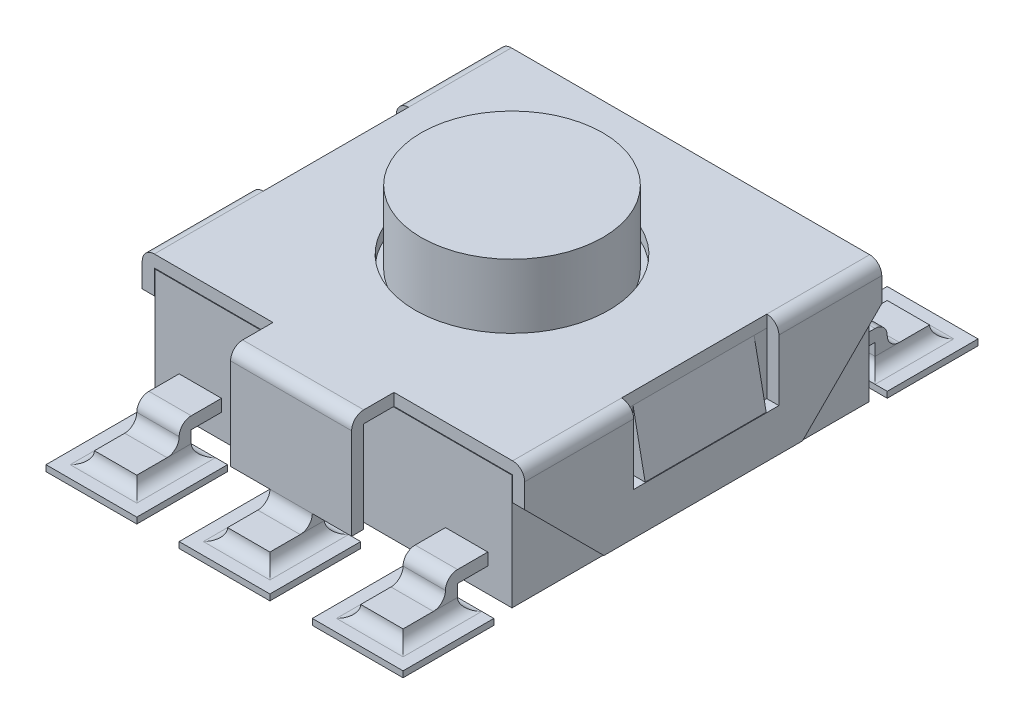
ISO-10303-21;
HEADER;
FILE_DESCRIPTION(('STEP AP214'),'2;1');
FILE_NAME('part.step','',(''),(''),'','','');
FILE_SCHEMA(('AUTOMOTIVE_DESIGN { 1 0 10303 214 1 1 1 1 }'));
ENDSEC;
DATA;
#1=APPLICATION_CONTEXT('core data for automotive mechanical design processes');
#2=APPLICATION_PROTOCOL_DEFINITION('international standard','automotive_design',2000,#1);
#3=PRODUCT_CONTEXT('',#1,'mechanical');
#4=PRODUCT('Part','Part','',(#3));
#5=PRODUCT_RELATED_PRODUCT_CATEGORY('part','',(#4));
#6=PRODUCT_DEFINITION_FORMATION('','',#4);
#7=PRODUCT_DEFINITION_CONTEXT('part definition',#1,'design');
#8=PRODUCT_DEFINITION('design','',#6,#7);
#9=PRODUCT_DEFINITION_SHAPE('','',#8);
#10=(LENGTH_UNIT() NAMED_UNIT(*) SI_UNIT(.MILLI.,.METRE.));
#11=(NAMED_UNIT(*) PLANE_ANGLE_UNIT() SI_UNIT($,.RADIAN.));
#12=(NAMED_UNIT(*) SI_UNIT($,.STERADIAN.) SOLID_ANGLE_UNIT());
#13=UNCERTAINTY_MEASURE_WITH_UNIT(LENGTH_MEASURE(1.E-05),#10,'distance_accuracy_value','');
#14=(GEOMETRIC_REPRESENTATION_CONTEXT(3) GLOBAL_UNCERTAINTY_ASSIGNED_CONTEXT((#13)) GLOBAL_UNIT_ASSIGNED_CONTEXT((#10,
#11,#12)) REPRESENTATION_CONTEXT('',''));
#15=CARTESIAN_POINT('',(0.,0.,0.));
#16=DIRECTION('',(0.,0.,1.));
#17=DIRECTION('',(1.,0.,0.));
#18=AXIS2_PLACEMENT_3D('',#15,#16,#17);
#19=CARTESIAN_POINT('',(6.1,0.9,-2.));
#20=DIRECTION('',(0.,-1.,0.));
#21=DIRECTION('',(0.,0.,-1.));
#22=AXIS2_PLACEMENT_3D('',#19,#20,#21);
#23=PLANE('',#22);
#24=DIRECTION('',(-1.,0.,0.));
#25=VECTOR('',#24,1.);
#26=CARTESIAN_POINT('',(6.1,0.9,-4.));
#27=LINE('',#26,#25);
#28=CARTESIAN_POINT('',(5.91,0.9,-4.));
#29=VERTEX_POINT('',#28);
#30=CARTESIAN_POINT('',(5.9,0.9,-4.));
#31=VERTEX_POINT('',#30);
#32=EDGE_CURVE('E1298',#29,#31,#27,.T.);
#33=ORIENTED_EDGE('',*,*,#32,.F.);
#34=DIRECTION('',(0.,0.,1.));
#35=VECTOR('',#34,1.);
#36=CARTESIAN_POINT('',(5.91,0.9,-4.2));
#37=LINE('',#36,#35);
#38=CARTESIAN_POINT('',(5.91,0.9,-2.));
#39=VERTEX_POINT('',#38);
#40=EDGE_CURVE('E1350',#29,#39,#37,.T.);
#41=ORIENTED_EDGE('',*,*,#40,.T.);
#42=DIRECTION('',(-1.,0.,0.));
#43=VECTOR('',#42,1.);
#44=CARTESIAN_POINT('',(6.1,0.9,-2.));
#45=LINE('',#44,#43);
#46=CARTESIAN_POINT('',(5.9,0.9,-2.));
#47=VERTEX_POINT('',#46);
#48=EDGE_CURVE('E1317',#39,#47,#45,.T.);
#49=ORIENTED_EDGE('',*,*,#48,.T.);
#50=DIRECTION('',(0.,0.,-1.));
#51=VECTOR('',#50,1.);
#52=CARTESIAN_POINT('',(5.9,0.9,-2.));
#53=LINE('',#52,#51);
#54=EDGE_CURVE('E1304',#47,#31,#53,.T.);
#55=ORIENTED_EDGE('',*,*,#54,.T.);
#56=EDGE_LOOP('',(#33,#41,#49,#55));
#57=FACE_BOUND('',#56,.T.);
#58=ADVANCED_FACE('F36',(#57),#23,.T.);
#59=CARTESIAN_POINT('',(-0.2,0.9,-2.));
#60=DIRECTION('',(0.,1.,0.));
#61=DIRECTION('',(0.,0.,1.));
#62=AXIS2_PLACEMENT_3D('',#59,#60,#61);
#63=PLANE('',#62);
#64=DIRECTION('',(0.,0.,-1.));
#65=VECTOR('',#64,1.);
#66=CARTESIAN_POINT('',(-0.01,0.9,-1.8));
#67=LINE('',#66,#65);
#68=CARTESIAN_POINT('',(-0.01,0.9,-2.));
#69=VERTEX_POINT('',#68);
#70=CARTESIAN_POINT('',(-0.01,0.9,-4.));
#71=VERTEX_POINT('',#70);
#72=EDGE_CURVE('E1269',#69,#71,#67,.T.);
#73=ORIENTED_EDGE('',*,*,#72,.T.);
#74=DIRECTION('',(1.,0.,0.));
#75=VECTOR('',#74,1.);
#76=CARTESIAN_POINT('',(-0.2,0.9,-4.));
#77=LINE('',#76,#75);
#78=CARTESIAN_POINT('',(0.,0.9,-4.));
#79=VERTEX_POINT('',#78);
#80=EDGE_CURVE('E1450',#71,#79,#77,.T.);
#81=ORIENTED_EDGE('',*,*,#80,.T.);
#82=DIRECTION('',(0.,0.,-1.));
#83=VECTOR('',#82,1.);
#84=CARTESIAN_POINT('',(0.,0.9,-2.));
#85=LINE('',#84,#83);
#86=CARTESIAN_POINT('',(0.,0.9,-2.));
#87=VERTEX_POINT('',#86);
#88=EDGE_CURVE('E1460',#87,#79,#85,.T.);
#89=ORIENTED_EDGE('',*,*,#88,.F.);
#90=DIRECTION('',(1.,0.,0.));
#91=VECTOR('',#90,1.);
#92=CARTESIAN_POINT('',(-0.2,0.9,-2.));
#93=LINE('',#92,#91);
#94=EDGE_CURVE('E1445',#69,#87,#93,.T.);
#95=ORIENTED_EDGE('',*,*,#94,.F.);
#96=EDGE_LOOP('',(#73,#81,#89,#95));
#97=FACE_BOUND('',#96,.T.);
#98=ADVANCED_FACE('F848',(#97),#63,.F.);
#99=CARTESIAN_POINT('',(5.9,1.9,0.));
#100=DIRECTION('',(-1.,0.,0.));
#101=DIRECTION('',(0.,0.,1.));
#102=AXIS2_PLACEMENT_3D('',#99,#100,#101);
#103=PLANE('',#102);
#104=DIRECTION('',(0.,1.,0.));
#105=VECTOR('',#104,1.);
#106=CARTESIAN_POINT('',(5.9,0.9,-4.));
#107=LINE('',#106,#105);
#108=CARTESIAN_POINT('',(5.9,1.9,-4.));
#109=VERTEX_POINT('',#108);
#110=EDGE_CURVE('E1294',#31,#109,#107,.T.);
#111=ORIENTED_EDGE('',*,*,#110,.F.);
#112=ORIENTED_EDGE('',*,*,#54,.F.);
#113=DIRECTION('',(0.,1.,0.));
#114=VECTOR('',#113,1.);
#115=CARTESIAN_POINT('',(5.9,0.9,-2.));
#116=LINE('',#115,#114);
#117=CARTESIAN_POINT('',(5.9,1.9,-2.));
#118=VERTEX_POINT('',#117);
#119=EDGE_CURVE('E1299',#47,#118,#116,.T.);
#120=ORIENTED_EDGE('',*,*,#119,.T.);
#121=DIRECTION('',(0.,0.,-1.));
#122=VECTOR('',#121,1.);
#123=CARTESIAN_POINT('',(5.9,1.9,0.));
#124=LINE('',#123,#122);
#125=CARTESIAN_POINT('',(5.9,1.9,0.));
#126=VERTEX_POINT('',#125);
#127=EDGE_CURVE('E1960',#126,#118,#124,.T.);
#128=ORIENTED_EDGE('',*,*,#127,.F.);
#129=DIRECTION('',(0.,-1.,0.));
#130=VECTOR('',#129,1.);
#131=CARTESIAN_POINT('',(5.9,1.9,0.));
#132=LINE('',#131,#130);
#133=CARTESIAN_POINT('',(5.9,0.,0.));
#134=VERTEX_POINT('',#133);
#135=EDGE_CURVE('E1947',#126,#134,#132,.T.);
#136=ORIENTED_EDGE('',*,*,#135,.T.);
#137=DIRECTION('',(0.,0.,-1.));
#138=VECTOR('',#137,1.);
#139=CARTESIAN_POINT('',(5.9,0.,0.));
#140=LINE('',#139,#138);
#141=CARTESIAN_POINT('',(5.9,0.,-5.9));
#142=VERTEX_POINT('',#141);
#143=EDGE_CURVE('E1954',#134,#142,#140,.T.);
#144=ORIENTED_EDGE('',*,*,#143,.T.);
#145=DIRECTION('',(0.,-1.,0.));
#146=VECTOR('',#145,1.);
#147=CARTESIAN_POINT('',(5.9,1.9,-5.9));
#148=LINE('',#147,#146);
#149=CARTESIAN_POINT('',(5.9,1.9,-5.9));
#150=VERTEX_POINT('',#149);
#151=EDGE_CURVE('E1961',#150,#142,#148,.T.);
#152=ORIENTED_EDGE('',*,*,#151,.F.);
#153=EDGE_CURVE('E2080',#109,#150,#124,.T.);
#154=ORIENTED_EDGE('',*,*,#153,.F.);
#155=EDGE_LOOP('',(#111,#112,#120,#128,#136,#144,#152,#154));
#156=FACE_BOUND('',#155,.T.);
#157=ADVANCED_FACE('F854',(#156),#103,.F.);
#158=CARTESIAN_POINT('',(0.,0.4,0.));
#159=DIRECTION('',(0.,1.,0.));
#160=DIRECTION('',(0.,0.,1.));
#161=AXIS2_PLACEMENT_3D('',#158,#159,#160);
#162=PLANE('',#161);
#163=DIRECTION('',(1.,0.,0.));
#164=VECTOR('',#163,1.);
#165=CARTESIAN_POINT('',(4.8,0.4,-6.4));
#166=LINE('',#165,#164);
#167=CARTESIAN_POINT('',(4.8,0.4,-6.4));
#168=VERTEX_POINT('',#167);
#169=CARTESIAN_POINT('',(5.5,0.4,-6.4));
#170=VERTEX_POINT('',#169);
#171=EDGE_CURVE('E1479',#168,#170,#166,.T.);
#172=ORIENTED_EDGE('',*,*,#171,.T.);
#173=DIRECTION('',(0.,0.,-1.));
#174=VECTOR('',#173,1.);
#175=CARTESIAN_POINT('',(5.5,0.4,-6.6));
#176=LINE('',#175,#174);
#177=CARTESIAN_POINT('',(5.5,0.4,-5.9));
#178=VERTEX_POINT('',#177);
#179=EDGE_CURVE('E1498',#178,#170,#176,.T.);
#180=ORIENTED_EDGE('',*,*,#179,.F.);
#181=DIRECTION('',(1.,0.,0.));
#182=VECTOR('',#181,1.);
#183=CARTESIAN_POINT('',(4.8,0.4,-5.9));
#184=LINE('',#183,#182);
#185=CARTESIAN_POINT('',(4.8,0.4,-5.9));
#186=VERTEX_POINT('',#185);
#187=EDGE_CURVE('E1507',#186,#178,#184,.T.);
#188=ORIENTED_EDGE('',*,*,#187,.F.);
#189=DIRECTION('',(0.,0.,1.));
#190=VECTOR('',#189,1.);
#191=CARTESIAN_POINT('',(4.8,0.4,-6.6));
#192=LINE('',#191,#190);
#193=EDGE_CURVE('E1505',#168,#186,#192,.T.);
#194=ORIENTED_EDGE('',*,*,#193,.F.);
#195=EDGE_LOOP('',(#172,#180,#188,#194));
#196=FACE_BOUND('',#195,.T.);
#197=ADVANCED_FACE('F925',(#196),#162,.F.);
#198=CARTESIAN_POINT('',(0.,0.4,0.));
#199=DIRECTION('',(0.,1.,0.));
#200=DIRECTION('',(0.,0.,1.));
#201=AXIS2_PLACEMENT_3D('',#198,#199,#200);
#202=PLANE('',#201);
#203=DIRECTION('',(1.,0.,0.));
#204=VECTOR('',#203,1.);
#205=CARTESIAN_POINT('',(0.4,0.4,-6.4));
#206=LINE('',#205,#204);
#207=CARTESIAN_POINT('',(0.4,0.4,-6.4));
#208=VERTEX_POINT('',#207);
#209=CARTESIAN_POINT('',(1.1,0.4,-6.4));
#210=VERTEX_POINT('',#209);
#211=EDGE_CURVE('E1517',#208,#210,#206,.T.);
#212=ORIENTED_EDGE('',*,*,#211,.T.);
#213=DIRECTION('',(0.,0.,-1.));
#214=VECTOR('',#213,1.);
#215=CARTESIAN_POINT('',(1.1,0.4,-6.6));
#216=LINE('',#215,#214);
#217=CARTESIAN_POINT('',(1.1,0.4,-5.9));
#218=VERTEX_POINT('',#217);
#219=EDGE_CURVE('E1535',#218,#210,#216,.T.);
#220=ORIENTED_EDGE('',*,*,#219,.F.);
#221=DIRECTION('',(1.,0.,0.));
#222=VECTOR('',#221,1.);
#223=CARTESIAN_POINT('',(0.4,0.4,-5.9));
#224=LINE('',#223,#222);
#225=CARTESIAN_POINT('',(0.4,0.4,-5.9));
#226=VERTEX_POINT('',#225);
#227=EDGE_CURVE('E1544',#226,#218,#224,.T.);
#228=ORIENTED_EDGE('',*,*,#227,.F.);
#229=DIRECTION('',(0.,0.,1.));
#230=VECTOR('',#229,1.);
#231=CARTESIAN_POINT('',(0.4,0.4,-6.6));
#232=LINE('',#231,#230);
#233=EDGE_CURVE('E1542',#208,#226,#232,.T.);
#234=ORIENTED_EDGE('',*,*,#233,.F.);
#235=EDGE_LOOP('',(#212,#220,#228,#234));
#236=FACE_BOUND('',#235,.T.);
#237=ADVANCED_FACE('F928',(#236),#202,.F.);
#238=CARTESIAN_POINT('',(0.,0.4,0.));
#239=DIRECTION('',(0.,-1.,0.));
#240=DIRECTION('',(0.,0.,-1.));
#241=AXIS2_PLACEMENT_3D('',#238,#239,#240);
#242=PLANE('',#241);
#243=DIRECTION('',(0.,0.,-1.));
#244=VECTOR('',#243,1.);
#245=CARTESIAN_POINT('',(5.5,0.4,0.7));
#246=LINE('',#245,#244);
#247=CARTESIAN_POINT('',(5.5,0.4,0.5));
#248=VERTEX_POINT('',#247);
#249=CARTESIAN_POINT('',(5.5,0.4,0.));
#250=VERTEX_POINT('',#249);
#251=EDGE_CURVE('E1810',#248,#250,#246,.T.);
#252=ORIENTED_EDGE('',*,*,#251,.F.);
#253=DIRECTION('',(-1.,0.,0.));
#254=VECTOR('',#253,1.);
#255=CARTESIAN_POINT('',(4.8,0.4,0.5));
#256=LINE('',#255,#254);
#257=CARTESIAN_POINT('',(4.8,0.4,0.5));
#258=VERTEX_POINT('',#257);
#259=EDGE_CURVE('E1554',#248,#258,#256,.T.);
#260=ORIENTED_EDGE('',*,*,#259,.T.);
#261=DIRECTION('',(0.,0.,1.));
#262=VECTOR('',#261,1.);
#263=CARTESIAN_POINT('',(4.8,0.4,0.7));
#264=LINE('',#263,#262);
#265=CARTESIAN_POINT('',(4.8,0.4,0.));
#266=VERTEX_POINT('',#265);
#267=EDGE_CURVE('E1812',#266,#258,#264,.T.);
#268=ORIENTED_EDGE('',*,*,#267,.F.);
#269=DIRECTION('',(-1.,0.,0.));
#270=VECTOR('',#269,1.);
#271=CARTESIAN_POINT('',(4.8,0.4,0.));
#272=LINE('',#271,#270);
#273=EDGE_CURVE('E1807',#250,#266,#272,.T.);
#274=ORIENTED_EDGE('',*,*,#273,.F.);
#275=EDGE_LOOP('',(#252,#260,#268,#274));
#276=FACE_BOUND('',#275,.T.);
#277=ADVANCED_FACE('F976',(#276),#242,.T.);
#278=CARTESIAN_POINT('',(0.,1.9,0.));
#279=DIRECTION('',(0.,0.,-1.));
#280=DIRECTION('',(-1.,0.,0.));
#281=AXIS2_PLACEMENT_3D('',#278,#279,#280);
#282=PLANE('',#281);
#283=DIRECTION('',(-1.,0.,0.));
#284=VECTOR('',#283,1.);
#285=CARTESIAN_POINT('',(0.4,0.6,0.));
#286=LINE('',#285,#284);
#287=CARTESIAN_POINT('',(1.1,0.6,0.));
#288=VERTEX_POINT('',#287);
#289=CARTESIAN_POINT('',(0.4,0.6,0.));
#290=VERTEX_POINT('',#289);
#291=EDGE_CURVE('E1605',#288,#290,#286,.T.);
#292=ORIENTED_EDGE('',*,*,#291,.F.);
#293=DIRECTION('',(0.,-1.,0.));
#294=VECTOR('',#293,1.);
#295=CARTESIAN_POINT('',(1.1,0.6,0.));
#296=LINE('',#295,#294);
#297=CARTESIAN_POINT('',(1.1,0.4,0.));
#298=VERTEX_POINT('',#297);
#299=EDGE_CURVE('E1618',#288,#298,#296,.T.);
#300=ORIENTED_EDGE('',*,*,#299,.T.);
#301=DIRECTION('',(-1.,0.,0.));
#302=VECTOR('',#301,1.);
#303=CARTESIAN_POINT('',(0.4,0.4,0.));
#304=LINE('',#303,#302);
#305=CARTESIAN_POINT('',(0.4,0.4,0.));
#306=VERTEX_POINT('',#305);
#307=EDGE_CURVE('E1603',#298,#306,#304,.T.);
#308=ORIENTED_EDGE('',*,*,#307,.T.);
#309=DIRECTION('',(0.,-1.,0.));
#310=VECTOR('',#309,1.);
#311=CARTESIAN_POINT('',(0.4,0.6,0.));
#312=LINE('',#311,#310);
#313=EDGE_CURVE('E1607',#290,#306,#312,.T.);
#314=ORIENTED_EDGE('',*,*,#313,.F.);
#315=EDGE_LOOP('',(#292,#300,#308,#314));
#316=FACE_BOUND('',#315,.T.);
#317=DIRECTION('',(1.,0.,0.));
#318=VECTOR('',#317,1.);
#319=CARTESIAN_POINT('',(0.,0.,0.));
#320=LINE('',#319,#318);
#321=CARTESIAN_POINT('',(0.,0.,0.));
#322=VERTEX_POINT('',#321);
#323=EDGE_CURVE('E1944',#322,#134,#320,.T.);
#324=ORIENTED_EDGE('',*,*,#323,.T.);
#325=ORIENTED_EDGE('',*,*,#135,.F.);
#326=DIRECTION('',(1.,0.,0.));
#327=VECTOR('',#326,1.);
#328=CARTESIAN_POINT('',(0.,1.9,0.));
#329=LINE('',#328,#327);
#330=CARTESIAN_POINT('',(0.,1.9,0.));
#331=VERTEX_POINT('',#330);
#332=EDGE_CURVE('E1627',#331,#126,#329,.T.);
#333=ORIENTED_EDGE('',*,*,#332,.F.);
#334=DIRECTION('',(0.,-1.,0.));
#335=VECTOR('',#334,1.);
#336=CARTESIAN_POINT('',(0.,1.9,0.));
#337=LINE('',#336,#335);
#338=EDGE_CURVE('E1950',#331,#322,#337,.T.);
#339=ORIENTED_EDGE('',*,*,#338,.T.);
#340=EDGE_LOOP('',(#324,#325,#333,#339));
#341=FACE_BOUND('',#340,.T.);
#342=DIRECTION('',(-1.,0.,0.));
#343=VECTOR('',#342,1.);
#344=CARTESIAN_POINT('',(4.8,0.6,0.));
#345=LINE('',#344,#343);
#346=CARTESIAN_POINT('',(5.5,0.6,0.));
#347=VERTEX_POINT('',#346);
#348=CARTESIAN_POINT('',(4.8,0.6,0.));
#349=VERTEX_POINT('',#348);
#350=EDGE_CURVE('E1804',#347,#349,#345,.T.);
#351=ORIENTED_EDGE('',*,*,#350,.F.);
#352=DIRECTION('',(0.,-1.,0.));
#353=VECTOR('',#352,1.);
#354=CARTESIAN_POINT('',(5.5,0.6,0.));
#355=LINE('',#354,#353);
#356=EDGE_CURVE('E1796',#347,#250,#355,.T.);
#357=ORIENTED_EDGE('',*,*,#356,.T.);
#358=ORIENTED_EDGE('',*,*,#273,.T.);
#359=DIRECTION('',(0.,-1.,0.));
#360=VECTOR('',#359,1.);
#361=CARTESIAN_POINT('',(4.8,0.6,0.));
#362=LINE('',#361,#360);
#363=EDGE_CURVE('E1798',#349,#266,#362,.T.);
#364=ORIENTED_EDGE('',*,*,#363,.F.);
#365=EDGE_LOOP('',(#351,#357,#358,#364));
#366=FACE_BOUND('',#365,.T.);
#367=ADVANCED_FACE('F1024',(#316,#341,#366),#282,.F.);
#368=CARTESIAN_POINT('',(0.,0.4,0.));
#369=DIRECTION('',(0.,-1.,0.));
#370=DIRECTION('',(0.,0.,-1.));
#371=AXIS2_PLACEMENT_3D('',#368,#369,#370);
#372=PLANE('',#371);
#373=DIRECTION('',(0.,0.,-1.));
#374=VECTOR('',#373,1.);
#375=CARTESIAN_POINT('',(1.1,0.4,0.7));
#376=LINE('',#375,#374);
#377=CARTESIAN_POINT('',(1.1,0.4,0.5));
#378=VERTEX_POINT('',#377);
#379=EDGE_CURVE('E1611',#378,#298,#376,.T.);
#380=ORIENTED_EDGE('',*,*,#379,.F.);
#381=DIRECTION('',(-1.,0.,0.));
#382=VECTOR('',#381,1.);
#383=CARTESIAN_POINT('',(0.4,0.4,0.5));
#384=LINE('',#383,#382);
#385=CARTESIAN_POINT('',(0.4,0.4,0.5));
#386=VERTEX_POINT('',#385);
#387=EDGE_CURVE('E1581',#378,#386,#384,.T.);
#388=ORIENTED_EDGE('',*,*,#387,.T.);
#389=DIRECTION('',(0.,0.,1.));
#390=VECTOR('',#389,1.);
#391=CARTESIAN_POINT('',(0.4,0.4,0.7));
#392=LINE('',#391,#390);
#393=EDGE_CURVE('E1608',#306,#386,#392,.T.);
#394=ORIENTED_EDGE('',*,*,#393,.F.);
#395=ORIENTED_EDGE('',*,*,#307,.F.);
#396=EDGE_LOOP('',(#380,#388,#394,#395));
#397=FACE_BOUND('',#396,.T.);
#398=ADVANCED_FACE('F1070',(#397),#372,.T.);
#399=CARTESIAN_POINT('',(0.,1.9,0.));
#400=DIRECTION('',(1.,0.,0.));
#401=DIRECTION('',(0.,0.,-1.));
#402=AXIS2_PLACEMENT_3D('',#399,#400,#401);
#403=PLANE('',#402);
#404=ORIENTED_EDGE('',*,*,#88,.T.);
#405=DIRECTION('',(0.,1.,0.));
#406=VECTOR('',#405,1.);
#407=CARTESIAN_POINT('',(0.,0.9,-4.));
#408=LINE('',#407,#406);
#409=CARTESIAN_POINT('',(0.,1.9,-4.));
#410=VERTEX_POINT('',#409);
#411=EDGE_CURVE('E1310',#79,#410,#408,.T.);
#412=ORIENTED_EDGE('',*,*,#411,.T.);
#413=DIRECTION('',(0.,0.,1.));
#414=VECTOR('',#413,1.);
#415=CARTESIAN_POINT('',(0.,1.9,0.));
#416=LINE('',#415,#414);
#417=CARTESIAN_POINT('',(0.,1.9,-5.9));
#418=VERTEX_POINT('',#417);
#419=EDGE_CURVE('E1634',#418,#410,#416,.T.);
#420=ORIENTED_EDGE('',*,*,#419,.F.);
#421=DIRECTION('',(0.,-1.,0.));
#422=VECTOR('',#421,1.);
#423=CARTESIAN_POINT('',(0.,1.9,-5.9));
#424=LINE('',#423,#422);
#425=CARTESIAN_POINT('',(0.,0.,-5.9));
#426=VERTEX_POINT('',#425);
#427=EDGE_CURVE('E1969',#418,#426,#424,.T.);
#428=ORIENTED_EDGE('',*,*,#427,.T.);
#429=DIRECTION('',(0.,0.,1.));
#430=VECTOR('',#429,1.);
#431=CARTESIAN_POINT('',(0.,0.,0.));
#432=LINE('',#431,#430);
#433=EDGE_CURVE('E1624',#426,#322,#432,.T.);
#434=ORIENTED_EDGE('',*,*,#433,.T.);
#435=ORIENTED_EDGE('',*,*,#338,.F.);
#436=CARTESIAN_POINT('',(0.,1.9,-2.));
#437=VERTEX_POINT('',#436);
#438=EDGE_CURVE('E1631',#437,#331,#416,.T.);
#439=ORIENTED_EDGE('',*,*,#438,.F.);
#440=DIRECTION('',(0.,1.,0.));
#441=VECTOR('',#440,1.);
#442=CARTESIAN_POINT('',(0.,0.9,-2.));
#443=LINE('',#442,#441);
#444=EDGE_CURVE('E1476',#87,#437,#443,.T.);
#445=ORIENTED_EDGE('',*,*,#444,.F.);
#446=EDGE_LOOP('',(#404,#412,#420,#428,#434,#435,#439,#445));
#447=FACE_BOUND('',#446,.T.);
#448=ADVANCED_FACE('F1073',(#447),#403,.F.);
#449=CARTESIAN_POINT('',(0.,1.9,-5.9));
#450=DIRECTION('',(0.,0.,1.));
#451=DIRECTION('',(1.,0.,0.));
#452=AXIS2_PLACEMENT_3D('',#449,#450,#451);
#453=PLANE('',#452);
#454=DIRECTION('',(0.,-1.,0.));
#455=VECTOR('',#454,1.);
#456=CARTESIAN_POINT('',(5.5,0.6,-5.9));
#457=LINE('',#456,#455);
#458=CARTESIAN_POINT('',(5.5,0.6,-5.9));
#459=VERTEX_POINT('',#458);
#460=EDGE_CURVE('E1504',#459,#178,#457,.T.);
#461=ORIENTED_EDGE('',*,*,#460,.F.);
#462=DIRECTION('',(1.,0.,0.));
#463=VECTOR('',#462,1.);
#464=CARTESIAN_POINT('',(4.8,0.6,-5.9));
#465=LINE('',#464,#463);
#466=CARTESIAN_POINT('',(4.8,0.6,-5.9));
#467=VERTEX_POINT('',#466);
#468=EDGE_CURVE('E1497',#467,#459,#465,.T.);
#469=ORIENTED_EDGE('',*,*,#468,.F.);
#470=DIRECTION('',(0.,-1.,0.));
#471=VECTOR('',#470,1.);
#472=CARTESIAN_POINT('',(4.8,0.6,-5.9));
#473=LINE('',#472,#471);
#474=EDGE_CURVE('E1514',#467,#186,#473,.T.);
#475=ORIENTED_EDGE('',*,*,#474,.T.);
#476=ORIENTED_EDGE('',*,*,#187,.T.);
#477=EDGE_LOOP('',(#461,#469,#475,#476));
#478=FACE_BOUND('',#477,.T.);
#479=DIRECTION('',(0.,-1.,0.));
#480=VECTOR('',#479,1.);
#481=CARTESIAN_POINT('',(1.1,0.6,-5.9));
#482=LINE('',#481,#480);
#483=CARTESIAN_POINT('',(1.1,0.6,-5.9));
#484=VERTEX_POINT('',#483);
#485=EDGE_CURVE('E1541',#484,#218,#482,.T.);
#486=ORIENTED_EDGE('',*,*,#485,.F.);
#487=DIRECTION('',(1.,0.,0.));
#488=VECTOR('',#487,1.);
#489=CARTESIAN_POINT('',(0.4,0.6,-5.9));
#490=LINE('',#489,#488);
#491=CARTESIAN_POINT('',(0.4,0.6,-5.9));
#492=VERTEX_POINT('',#491);
#493=EDGE_CURVE('E1534',#492,#484,#490,.T.);
#494=ORIENTED_EDGE('',*,*,#493,.F.);
#495=DIRECTION('',(0.,-1.,0.));
#496=VECTOR('',#495,1.);
#497=CARTESIAN_POINT('',(0.4,0.6,-5.9));
#498=LINE('',#497,#496);
#499=EDGE_CURVE('E1551',#492,#226,#498,.T.);
#500=ORIENTED_EDGE('',*,*,#499,.T.);
#501=ORIENTED_EDGE('',*,*,#227,.T.);
#502=EDGE_LOOP('',(#486,#494,#500,#501));
#503=FACE_BOUND('',#502,.T.);
#504=DIRECTION('',(-1.,0.,0.));
#505=VECTOR('',#504,1.);
#506=CARTESIAN_POINT('',(0.,0.,-5.9));
#507=LINE('',#506,#505);
#508=EDGE_CURVE('E1964',#142,#426,#507,.T.);
#509=ORIENTED_EDGE('',*,*,#508,.T.);
#510=ORIENTED_EDGE('',*,*,#427,.F.);
#511=DIRECTION('',(-1.,0.,0.));
#512=VECTOR('',#511,1.);
#513=CARTESIAN_POINT('',(0.,1.9,-5.9));
#514=LINE('',#513,#512);
#515=EDGE_CURVE('E1972',#150,#418,#514,.T.);
#516=ORIENTED_EDGE('',*,*,#515,.F.);
#517=ORIENTED_EDGE('',*,*,#151,.T.);
#518=EDGE_LOOP('',(#509,#510,#516,#517));
#519=FACE_BOUND('',#518,.T.);
#520=ADVANCED_FACE('F1094',(#478,#503,#519),#453,.F.);
#521=CARTESIAN_POINT('',(0.,1.9,0.));
#522=DIRECTION('',(0.,-1.,0.));
#523=DIRECTION('',(0.,0.,-1.));
#524=AXIS2_PLACEMENT_3D('',#521,#522,#523);
#525=PLANE('',#524);
#526=CARTESIAN_POINT('',(2.95,1.9,-2.95));
#527=DIRECTION('',(0.,-1.,0.));
#528=DIRECTION('',(0.,0.,-1.));
#529=AXIS2_PLACEMENT_3D('',#526,#527,#528);
#530=CIRCLE('',#529,1.5);
#531=CARTESIAN_POINT('',(2.95,1.9,-4.45));
#532=VERTEX_POINT('',#531);
#533=EDGE_CURVE('E1975',#532,#532,#530,.F.);
#534=ORIENTED_EDGE('',*,*,#533,.F.);
#535=EDGE_LOOP('',(#534));
#536=FACE_BOUND('',#535,.T.);
#537=ORIENTED_EDGE('',*,*,#419,.T.);
#538=DIRECTION('',(0.,0.,-1.));
#539=VECTOR('',#538,1.);
#540=CARTESIAN_POINT('',(0.,1.9,-2.));
#541=LINE('',#540,#539);
#542=EDGE_CURVE('E2087',#437,#410,#541,.T.);
#543=ORIENTED_EDGE('',*,*,#542,.F.);
#544=ORIENTED_EDGE('',*,*,#438,.T.);
#545=ORIENTED_EDGE('',*,*,#332,.T.);
#546=ORIENTED_EDGE('',*,*,#127,.T.);
#547=DIRECTION('',(0.,0.,-1.));
#548=VECTOR('',#547,1.);
#549=CARTESIAN_POINT('',(5.9,1.9,-2.));
#550=LINE('',#549,#548);
#551=EDGE_CURVE('E1295',#118,#109,#550,.T.);
#552=ORIENTED_EDGE('',*,*,#551,.T.);
#553=ORIENTED_EDGE('',*,*,#153,.T.);
#554=ORIENTED_EDGE('',*,*,#515,.T.);
#555=EDGE_LOOP('',(#537,#543,#544,#545,#546,#552,#553,#554));
#556=FACE_BOUND('',#555,.T.);
#557=ADVANCED_FACE('F1091',(#536,#556),#525,.F.);
#558=CARTESIAN_POINT('',(0.,0.,0.));
#559=DIRECTION('',(0.,-1.,0.));
#560=DIRECTION('',(0.,0.,-1.));
#561=AXIS2_PLACEMENT_3D('',#558,#559,#560);
#562=PLANE('',#561);
#563=ORIENTED_EDGE('',*,*,#433,.F.);
#564=ORIENTED_EDGE('',*,*,#508,.F.);
#565=ORIENTED_EDGE('',*,*,#143,.F.);
#566=ORIENTED_EDGE('',*,*,#323,.F.);
#567=EDGE_LOOP('',(#563,#564,#565,#566));
#568=FACE_BOUND('',#567,.T.);
#569=ADVANCED_FACE('F1089',(#568),#562,.T.);
#570=CARTESIAN_POINT('',(2.95,3.1,-2.95));
#571=DIRECTION('',(0.,-1.,0.));
#572=DIRECTION('',(0.,0.,-1.));
#573=AXIS2_PLACEMENT_3D('',#570,#571,#572);
#574=CYLINDRICAL_SURFACE('',#573,1.5);
#575=CARTESIAN_POINT('',(2.95,3.1,-2.95));
#576=DIRECTION('',(0.,1.,0.));
#577=DIRECTION('',(0.,0.,1.));
#578=AXIS2_PLACEMENT_3D('',#575,#576,#577);
#579=CIRCLE('',#578,1.5);
#580=CARTESIAN_POINT('',(2.95,3.1,-1.45));
#581=VERTEX_POINT('',#580);
#582=EDGE_CURVE('E1621',#581,#581,#579,.T.);
#583=ORIENTED_EDGE('',*,*,#582,.F.);
#584=EDGE_LOOP('',(#583));
#585=FACE_BOUND('',#584,.T.);
#586=ORIENTED_EDGE('',*,*,#533,.T.);
#587=EDGE_LOOP('',(#586));
#588=FACE_BOUND('',#587,.T.);
#589=ADVANCED_FACE('F1085',(#585,#588),#574,.T.);
#590=CARTESIAN_POINT('',(2.95,3.1,-2.95));
#591=DIRECTION('',(0.,1.,0.));
#592=DIRECTION('',(0.,0.,1.));
#593=AXIS2_PLACEMENT_3D('',#590,#591,#592);
#594=PLANE('',#593);
#595=ORIENTED_EDGE('',*,*,#582,.T.);
#596=EDGE_LOOP('',(#595));
#597=FACE_BOUND('',#596,.T.);
#598=ADVANCED_FACE('F1081',(#597),#594,.T.);
#599=CARTESIAN_POINT('',(0.4,0.6,0.7));
#600=DIRECTION('',(1.,0.,0.));
#601=DIRECTION('',(0.,0.,-1.));
#602=AXIS2_PLACEMENT_3D('',#599,#600,#601);
#603=PLANE('',#602);
#604=DIRECTION('',(0.,-1.,0.));
#605=VECTOR('',#604,1.);
#606=CARTESIAN_POINT('',(0.4,0.2,0.5));
#607=LINE('',#606,#605);
#608=CARTESIAN_POINT('',(0.4,0.2,0.5));
#609=VERTEX_POINT('',#608);
#610=EDGE_CURVE('E1591',#386,#609,#607,.T.);
#611=ORIENTED_EDGE('',*,*,#610,.T.);
#612=DIRECTION('',(0.,0.,1.));
#613=VECTOR('',#612,1.);
#614=CARTESIAN_POINT('',(0.4,0.2,0.7));
#615=LINE('',#614,#613);
#616=CARTESIAN_POINT('',(0.4,0.2,0.9));
#617=VERTEX_POINT('',#616);
#618=EDGE_CURVE('E1441',#609,#617,#615,.T.);
#619=ORIENTED_EDGE('',*,*,#618,.T.);
#620=CARTESIAN_POINT('',(0.4,0.4,0.9));
#621=DIRECTION('',(1.,0.,0.));
#622=DIRECTION('',(0.,0.,-1.));
#623=AXIS2_PLACEMENT_3D('',#620,#621,#622);
#624=CIRCLE('',#623,0.2);
#625=CARTESIAN_POINT('',(0.4,0.4,0.7));
#626=VERTEX_POINT('',#625);
#627=EDGE_CURVE('E1731',#617,#626,#624,.T.);
#628=ORIENTED_EDGE('',*,*,#627,.T.);
#629=CARTESIAN_POINT('',(0.4,0.4,0.5));
#630=DIRECTION('',(1.,0.,0.));
#631=DIRECTION('',(0.,0.,-1.));
#632=AXIS2_PLACEMENT_3D('',#629,#630,#631);
#633=CIRCLE('',#632,0.2);
#634=CARTESIAN_POINT('',(0.4,0.6,0.5));
#635=VERTEX_POINT('',#634);
#636=EDGE_CURVE('E1761',#626,#635,#633,.F.);
#637=ORIENTED_EDGE('',*,*,#636,.T.);
#638=DIRECTION('',(0.,0.,1.));
#639=VECTOR('',#638,1.);
#640=CARTESIAN_POINT('',(0.4,0.6,0.7));
#641=LINE('',#640,#639);
#642=EDGE_CURVE('E1599',#290,#635,#641,.T.);
#643=ORIENTED_EDGE('',*,*,#642,.F.);
#644=ORIENTED_EDGE('',*,*,#313,.T.);
#645=ORIENTED_EDGE('',*,*,#393,.T.);
#646=EDGE_LOOP('',(#611,#619,#628,#637,#643,#644,#645));
#647=FACE_BOUND('',#646,.T.);
#648=ADVANCED_FACE('F1077',(#647),#603,.F.);
#649=CARTESIAN_POINT('',(1.1,0.6,0.7));
#650=DIRECTION('',(-1.,0.,0.));
#651=DIRECTION('',(0.,0.,1.));
#652=AXIS2_PLACEMENT_3D('',#649,#650,#651);
#653=PLANE('',#652);
#654=CARTESIAN_POINT('',(1.1,0.4,0.9));
#655=DIRECTION('',(-1.,0.,0.));
#656=DIRECTION('',(0.,0.,1.));
#657=AXIS2_PLACEMENT_3D('',#654,#655,#656);
#658=CIRCLE('',#657,0.2);
#659=CARTESIAN_POINT('',(1.1,0.4,0.7));
#660=VERTEX_POINT('',#659);
#661=CARTESIAN_POINT('',(1.1,0.2,0.9));
#662=VERTEX_POINT('',#661);
#663=EDGE_CURVE('E1743',#660,#662,#658,.T.);
#664=ORIENTED_EDGE('',*,*,#663,.T.);
#665=DIRECTION('',(0.,0.,-1.));
#666=VECTOR('',#665,1.);
#667=CARTESIAN_POINT('',(1.1,0.2,0.7));
#668=LINE('',#667,#666);
#669=CARTESIAN_POINT('',(1.1,0.2,0.5));
#670=VERTEX_POINT('',#669);
#671=EDGE_CURVE('E1692',#662,#670,#668,.T.);
#672=ORIENTED_EDGE('',*,*,#671,.T.);
#673=DIRECTION('',(0.,-1.,0.));
#674=VECTOR('',#673,1.);
#675=CARTESIAN_POINT('',(1.1,0.2,0.5));
#676=LINE('',#675,#674);
#677=EDGE_CURVE('E1899',#378,#670,#676,.T.);
#678=ORIENTED_EDGE('',*,*,#677,.F.);
#679=ORIENTED_EDGE('',*,*,#379,.T.);
#680=ORIENTED_EDGE('',*,*,#299,.F.);
#681=DIRECTION('',(0.,0.,-1.));
#682=VECTOR('',#681,1.);
#683=CARTESIAN_POINT('',(1.1,0.6,0.7));
#684=LINE('',#683,#682);
#685=CARTESIAN_POINT('',(1.1,0.6,0.5));
#686=VERTEX_POINT('',#685);
#687=EDGE_CURVE('E1602',#686,#288,#684,.T.);
#688=ORIENTED_EDGE('',*,*,#687,.F.);
#689=CARTESIAN_POINT('',(1.1,0.4,0.5));
#690=DIRECTION('',(-1.,0.,0.));
#691=DIRECTION('',(0.,0.,1.));
#692=AXIS2_PLACEMENT_3D('',#689,#690,#691);
#693=CIRCLE('',#692,0.2);
#694=EDGE_CURVE('E1763',#686,#660,#693,.F.);
#695=ORIENTED_EDGE('',*,*,#694,.T.);
#696=EDGE_LOOP('',(#664,#672,#678,#679,#680,#688,#695));
#697=FACE_BOUND('',#696,.T.);
#698=ADVANCED_FACE('F1068',(#697),#653,.F.);
#699=CARTESIAN_POINT('',(0.,0.6,0.));
#700=DIRECTION('',(0.,-1.,0.));
#701=DIRECTION('',(0.,0.,-1.));
#702=AXIS2_PLACEMENT_3D('',#699,#700,#701);
#703=PLANE('',#702);
#704=ORIENTED_EDGE('',*,*,#642,.T.);
#705=DIRECTION('',(1.,0.,0.));
#706=VECTOR('',#705,1.);
#707=CARTESIAN_POINT('',(0.,0.6,0.5));
#708=LINE('',#707,#706);
#709=EDGE_CURVE('E1764',#635,#686,#708,.T.);
#710=ORIENTED_EDGE('',*,*,#709,.T.);
#711=ORIENTED_EDGE('',*,*,#687,.T.);
#712=ORIENTED_EDGE('',*,*,#291,.T.);
#713=EDGE_LOOP('',(#704,#710,#711,#712));
#714=FACE_BOUND('',#713,.T.);
#715=ADVANCED_FACE('F1038',(#714),#703,.F.);
#716=CARTESIAN_POINT('',(0.,0.2,0.));
#717=DIRECTION('',(0.,-1.,0.));
#718=DIRECTION('',(0.,0.,-1.));
#719=AXIS2_PLACEMENT_3D('',#716,#717,#718);
#720=PLANE('',#719);
#721=DIRECTION('',(0.,0.,-1.));
#722=VECTOR('',#721,1.);
#723=CARTESIAN_POINT('',(1.1,0.2,1.4));
#724=LINE('',#723,#722);
#725=CARTESIAN_POINT('',(1.1,0.2,1.4));
#726=VERTEX_POINT('',#725);
#727=EDGE_CURVE('E1588',#726,#662,#724,.T.);
#728=ORIENTED_EDGE('',*,*,#727,.T.);
#729=DIRECTION('',(1.,0.,0.));
#730=VECTOR('',#729,1.);
#731=CARTESIAN_POINT('',(0.4,0.2,0.9));
#732=LINE('',#731,#730);
#733=EDGE_CURVE('E1576',#662,#617,#732,.F.);
#734=ORIENTED_EDGE('',*,*,#733,.T.);
#735=DIRECTION('',(0.,0.,1.));
#736=VECTOR('',#735,1.);
#737=CARTESIAN_POINT('',(0.4,0.2,1.4));
#738=LINE('',#737,#736);
#739=CARTESIAN_POINT('',(0.4,0.2,1.4));
#740=VERTEX_POINT('',#739);
#741=EDGE_CURVE('E1577',#617,#740,#738,.T.);
#742=ORIENTED_EDGE('',*,*,#741,.T.);
#743=DIRECTION('',(1.,0.,0.));
#744=VECTOR('',#743,1.);
#745=CARTESIAN_POINT('',(0.4,0.2,1.4));
#746=LINE('',#745,#744);
#747=EDGE_CURVE('E1580',#740,#726,#746,.T.);
#748=ORIENTED_EDGE('',*,*,#747,.T.);
#749=EDGE_LOOP('',(#728,#734,#742,#748));
#750=FACE_BOUND('',#749,.T.);
#751=ADVANCED_FACE('F1034',(#750),#720,.F.);
#752=CARTESIAN_POINT('',(0.,0.,0.));
#753=DIRECTION('',(0.,1.,0.));
#754=DIRECTION('',(0.,0.,1.));
#755=AXIS2_PLACEMENT_3D('',#752,#753,#754);
#756=PLANE('',#755);
#757=DIRECTION('',(-1.,0.,0.));
#758=VECTOR('',#757,1.);
#759=CARTESIAN_POINT('',(0.,0.,0.3));
#760=LINE('',#759,#758);
#761=CARTESIAN_POINT('',(1.5,0.,0.3));
#762=VERTEX_POINT('',#761);
#763=CARTESIAN_POINT('',(1.3,0.,0.3));
#764=VERTEX_POINT('',#763);
#765=EDGE_CURVE('E1910',#762,#764,#760,.T.);
#766=ORIENTED_EDGE('',*,*,#765,.T.);
#767=DIRECTION('',(0.,0.,-1.));
#768=VECTOR('',#767,1.);
#769=CARTESIAN_POINT('',(1.3,0.,0.));
#770=LINE('',#769,#768);
#771=CARTESIAN_POINT('',(1.3,0.,1.6));
#772=VERTEX_POINT('',#771);
#773=EDGE_CURVE('E1685',#764,#772,#770,.F.);
#774=ORIENTED_EDGE('',*,*,#773,.T.);
#775=DIRECTION('',(1.,0.,0.));
#776=VECTOR('',#775,1.);
#777=CARTESIAN_POINT('',(0.,0.,1.6));
#778=LINE('',#777,#776);
#779=CARTESIAN_POINT('',(0.2,0.,1.6));
#780=VERTEX_POINT('',#779);
#781=EDGE_CURVE('E1688',#772,#780,#778,.F.);
#782=ORIENTED_EDGE('',*,*,#781,.T.);
#783=DIRECTION('',(0.,0.,1.));
#784=VECTOR('',#783,1.);
#785=CARTESIAN_POINT('',(0.2,0.,0.));
#786=LINE('',#785,#784);
#787=CARTESIAN_POINT('',(0.2,0.,0.3));
#788=VERTEX_POINT('',#787);
#789=EDGE_CURVE('E1690',#780,#788,#786,.F.);
#790=ORIENTED_EDGE('',*,*,#789,.T.);
#791=CARTESIAN_POINT('',(0.,0.,0.3));
#792=VERTEX_POINT('',#791);
#793=EDGE_CURVE('E1924',#788,#792,#760,.T.);
#794=ORIENTED_EDGE('',*,*,#793,.T.);
#795=DIRECTION('',(0.,0.,1.));
#796=VECTOR('',#795,1.);
#797=CARTESIAN_POINT('',(0.,0.,0.3));
#798=LINE('',#797,#796);
#799=CARTESIAN_POINT('',(0.,0.,1.8));
#800=VERTEX_POINT('',#799);
#801=EDGE_CURVE('E1901',#792,#800,#798,.T.);
#802=ORIENTED_EDGE('',*,*,#801,.T.);
#803=DIRECTION('',(1.,0.,0.));
#804=VECTOR('',#803,1.);
#805=CARTESIAN_POINT('',(0.,0.,1.8));
#806=LINE('',#805,#804);
#807=CARTESIAN_POINT('',(1.5,0.,1.8));
#808=VERTEX_POINT('',#807);
#809=EDGE_CURVE('E1903',#800,#808,#806,.T.);
#810=ORIENTED_EDGE('',*,*,#809,.T.);
#811=DIRECTION('',(0.,0.,-1.));
#812=VECTOR('',#811,1.);
#813=CARTESIAN_POINT('',(1.5,0.,0.3));
#814=LINE('',#813,#812);
#815=EDGE_CURVE('E1921',#808,#762,#814,.T.);
#816=ORIENTED_EDGE('',*,*,#815,.T.);
#817=EDGE_LOOP('',(#766,#774,#782,#790,#794,#802,#810,#816));
#818=FACE_BOUND('',#817,.T.);
#819=ADVANCED_FACE('F1037',(#818),#756,.T.);
#820=CARTESIAN_POINT('',(0.,-0.1,0.3));
#821=DIRECTION('',(-1.,0.,0.));
#822=DIRECTION('',(0.,0.,1.));
#823=AXIS2_PLACEMENT_3D('',#820,#821,#822);
#824=PLANE('',#823);
#825=ORIENTED_EDGE('',*,*,#801,.F.);
#826=DIRECTION('',(0.,1.,0.));
#827=VECTOR('',#826,1.);
#828=CARTESIAN_POINT('',(0.,-0.1,0.3));
#829=LINE('',#828,#827);
#830=CARTESIAN_POINT('',(0.,-0.1,0.3));
#831=VERTEX_POINT('',#830);
#832=EDGE_CURVE('E1612',#831,#792,#829,.T.);
#833=ORIENTED_EDGE('',*,*,#832,.F.);
#834=DIRECTION('',(0.,0.,1.));
#835=VECTOR('',#834,1.);
#836=CARTESIAN_POINT('',(0.,-0.1,0.3));
#837=LINE('',#836,#835);
#838=CARTESIAN_POINT('',(0.,-0.1,1.8));
#839=VERTEX_POINT('',#838);
#840=EDGE_CURVE('E1906',#831,#839,#837,.T.);
#841=ORIENTED_EDGE('',*,*,#840,.T.);
#842=DIRECTION('',(0.,1.,0.));
#843=VECTOR('',#842,1.);
#844=CARTESIAN_POINT('',(0.,-0.1,1.8));
#845=LINE('',#844,#843);
#846=EDGE_CURVE('E1597',#839,#800,#845,.T.);
#847=ORIENTED_EDGE('',*,*,#846,.T.);
#848=EDGE_LOOP('',(#825,#833,#841,#847));
#849=FACE_BOUND('',#848,.T.);
#850=ADVANCED_FACE('F1050',(#849),#824,.T.);
#851=CARTESIAN_POINT('',(0.,-0.1,0.3));
#852=DIRECTION('',(0.,0.,-1.));
#853=DIRECTION('',(-1.,0.,0.));
#854=AXIS2_PLACEMENT_3D('',#851,#852,#853);
#855=PLANE('',#854);
#856=ORIENTED_EDGE('',*,*,#765,.F.);
#857=DIRECTION('',(0.,1.,0.));
#858=VECTOR('',#857,1.);
#859=CARTESIAN_POINT('',(1.5,-0.1,0.3));
#860=LINE('',#859,#858);
#861=CARTESIAN_POINT('',(1.5,-0.1,0.3));
#862=VERTEX_POINT('',#861);
#863=EDGE_CURVE('E1930',#862,#762,#860,.T.);
#864=ORIENTED_EDGE('',*,*,#863,.F.);
#865=DIRECTION('',(-1.,0.,0.));
#866=VECTOR('',#865,1.);
#867=CARTESIAN_POINT('',(0.,-0.1,0.3));
#868=LINE('',#867,#866);
#869=EDGE_CURVE('E1916',#862,#831,#868,.T.);
#870=ORIENTED_EDGE('',*,*,#869,.T.);
#871=ORIENTED_EDGE('',*,*,#832,.T.);
#872=ORIENTED_EDGE('',*,*,#793,.F.);
#873=EDGE_CURVE('E1927',#764,#788,#760,.T.);
#874=ORIENTED_EDGE('',*,*,#873,.F.);
#875=EDGE_LOOP('',(#856,#864,#870,#871,#872,#874));
#876=FACE_BOUND('',#875,.T.);
#877=ADVANCED_FACE('F1052',(#876),#855,.T.);
#878=CARTESIAN_POINT('',(1.5,-0.1,0.3));
#879=DIRECTION('',(1.,0.,0.));
#880=DIRECTION('',(0.,0.,-1.));
#881=AXIS2_PLACEMENT_3D('',#878,#879,#880);
#882=PLANE('',#881);
#883=ORIENTED_EDGE('',*,*,#815,.F.);
#884=DIRECTION('',(0.,1.,0.));
#885=VECTOR('',#884,1.);
#886=CARTESIAN_POINT('',(1.5,-0.1,1.8));
#887=LINE('',#886,#885);
#888=CARTESIAN_POINT('',(1.5,-0.1,1.8));
#889=VERTEX_POINT('',#888);
#890=EDGE_CURVE('E1931',#889,#808,#887,.T.);
#891=ORIENTED_EDGE('',*,*,#890,.F.);
#892=DIRECTION('',(0.,0.,-1.));
#893=VECTOR('',#892,1.);
#894=CARTESIAN_POINT('',(1.5,-0.1,0.3));
#895=LINE('',#894,#893);
#896=EDGE_CURVE('E1913',#889,#862,#895,.T.);
#897=ORIENTED_EDGE('',*,*,#896,.T.);
#898=ORIENTED_EDGE('',*,*,#863,.T.);
#899=EDGE_LOOP('',(#883,#891,#897,#898));
#900=FACE_BOUND('',#899,.T.);
#901=ADVANCED_FACE('F1055',(#900),#882,.T.);
#902=CARTESIAN_POINT('',(0.,-0.1,1.8));
#903=DIRECTION('',(0.,0.,1.));
#904=DIRECTION('',(1.,0.,0.));
#905=AXIS2_PLACEMENT_3D('',#902,#903,#904);
#906=PLANE('',#905);
#907=ORIENTED_EDGE('',*,*,#809,.F.);
#908=ORIENTED_EDGE('',*,*,#846,.F.);
#909=DIRECTION('',(1.,0.,0.));
#910=VECTOR('',#909,1.);
#911=CARTESIAN_POINT('',(0.,-0.1,1.8));
#912=LINE('',#911,#910);
#913=EDGE_CURVE('E1909',#839,#889,#912,.T.);
#914=ORIENTED_EDGE('',*,*,#913,.T.);
#915=ORIENTED_EDGE('',*,*,#890,.T.);
#916=EDGE_LOOP('',(#907,#908,#914,#915));
#917=FACE_BOUND('',#916,.T.);
#918=ADVANCED_FACE('F1046',(#917),#906,.T.);
#919=CARTESIAN_POINT('',(0.,-0.1,0.));
#920=DIRECTION('',(0.,1.,0.));
#921=DIRECTION('',(0.,0.,1.));
#922=AXIS2_PLACEMENT_3D('',#919,#920,#921);
#923=PLANE('',#922);
#924=ORIENTED_EDGE('',*,*,#840,.F.);
#925=ORIENTED_EDGE('',*,*,#869,.F.);
#926=ORIENTED_EDGE('',*,*,#896,.F.);
#927=ORIENTED_EDGE('',*,*,#913,.F.);
#928=EDGE_LOOP('',(#924,#925,#926,#927));
#929=FACE_BOUND('',#928,.T.);
#930=ADVANCED_FACE('F1042',(#929),#923,.F.);
#931=CARTESIAN_POINT('',(0.4,0.2,0.5));
#932=DIRECTION('',(0.,0.,1.));
#933=DIRECTION('',(1.,0.,0.));
#934=AXIS2_PLACEMENT_3D('',#931,#932,#933);
#935=PLANE('',#934);
#936=ORIENTED_EDGE('',*,*,#677,.T.);
#937=DIRECTION('',(-1.,0.,0.));
#938=VECTOR('',#937,1.);
#939=CARTESIAN_POINT('',(0.4,0.2,0.5));
#940=LINE('',#939,#938);
#941=EDGE_CURVE('E1683',#670,#609,#940,.T.);
#942=ORIENTED_EDGE('',*,*,#941,.T.);
#943=ORIENTED_EDGE('',*,*,#610,.F.);
#944=ORIENTED_EDGE('',*,*,#387,.F.);
#945=EDGE_LOOP('',(#936,#942,#943,#944));
#946=FACE_BOUND('',#945,.T.);
#947=ADVANCED_FACE('F1032',(#946),#935,.F.);
#948=CARTESIAN_POINT('',(4.8,0.6,0.7));
#949=DIRECTION('',(1.,0.,0.));
#950=DIRECTION('',(0.,0.,-1.));
#951=AXIS2_PLACEMENT_3D('',#948,#949,#950);
#952=PLANE('',#951);
#953=DIRECTION('',(0.,-1.,0.));
#954=VECTOR('',#953,1.);
#955=CARTESIAN_POINT('',(4.8,0.2,0.5));
#956=LINE('',#955,#954);
#957=CARTESIAN_POINT('',(4.8,0.2,0.5));
#958=VERTEX_POINT('',#957);
#959=EDGE_CURVE('E1824',#258,#958,#956,.T.);
#960=ORIENTED_EDGE('',*,*,#959,.T.);
#961=DIRECTION('',(0.,0.,1.));
#962=VECTOR('',#961,1.);
#963=CARTESIAN_POINT('',(4.8,0.2,0.7));
#964=LINE('',#963,#962);
#965=CARTESIAN_POINT('',(4.8,0.2,0.9));
#966=VERTEX_POINT('',#965);
#967=EDGE_CURVE('E1442',#958,#966,#964,.T.);
#968=ORIENTED_EDGE('',*,*,#967,.T.);
#969=CARTESIAN_POINT('',(4.8,0.4,0.9));
#970=DIRECTION('',(1.,0.,0.));
#971=DIRECTION('',(0.,0.,-1.));
#972=AXIS2_PLACEMENT_3D('',#969,#970,#971);
#973=CIRCLE('',#972,0.2);
#974=CARTESIAN_POINT('',(4.8,0.4,0.7));
#975=VERTEX_POINT('',#974);
#976=EDGE_CURVE('E1746',#966,#975,#973,.T.);
#977=ORIENTED_EDGE('',*,*,#976,.T.);
#978=CARTESIAN_POINT('',(4.8,0.4,0.5));
#979=DIRECTION('',(1.,0.,0.));
#980=DIRECTION('',(0.,0.,-1.));
#981=AXIS2_PLACEMENT_3D('',#978,#979,#980);
#982=CIRCLE('',#981,0.2);
#983=CARTESIAN_POINT('',(4.8,0.6,0.5));
#984=VERTEX_POINT('',#983);
#985=EDGE_CURVE('E1574',#975,#984,#982,.F.);
#986=ORIENTED_EDGE('',*,*,#985,.T.);
#987=DIRECTION('',(0.,0.,1.));
#988=VECTOR('',#987,1.);
#989=CARTESIAN_POINT('',(4.8,0.6,0.7));
#990=LINE('',#989,#988);
#991=EDGE_CURVE('E1809',#349,#984,#990,.T.);
#992=ORIENTED_EDGE('',*,*,#991,.F.);
#993=ORIENTED_EDGE('',*,*,#363,.T.);
#994=ORIENTED_EDGE('',*,*,#267,.T.);
#995=EDGE_LOOP('',(#960,#968,#977,#986,#992,#993,#994));
#996=FACE_BOUND('',#995,.T.);
#997=ADVANCED_FACE('F1028',(#996),#952,.F.);
#998=CARTESIAN_POINT('',(5.5,0.6,0.7));
#999=DIRECTION('',(-1.,0.,0.));
#1000=DIRECTION('',(0.,0.,1.));
#1001=AXIS2_PLACEMENT_3D('',#998,#999,#1000);
#1002=PLANE('',#1001);
#1003=CARTESIAN_POINT('',(5.5,0.4,0.9));
#1004=DIRECTION('',(-1.,0.,0.));
#1005=DIRECTION('',(0.,0.,1.));
#1006=AXIS2_PLACEMENT_3D('',#1003,#1004,#1005);
#1007=CIRCLE('',#1006,0.2);
#1008=CARTESIAN_POINT('',(5.5,0.4,0.7));
#1009=VERTEX_POINT('',#1008);
#1010=CARTESIAN_POINT('',(5.5,0.2,0.9));
#1011=VERTEX_POINT('',#1010);
#1012=EDGE_CURVE('E1748',#1009,#1011,#1007,.T.);
#1013=ORIENTED_EDGE('',*,*,#1012,.T.);
#1014=DIRECTION('',(0.,0.,-1.));
#1015=VECTOR('',#1014,1.);
#1016=CARTESIAN_POINT('',(5.5,0.2,0.7));
#1017=LINE('',#1016,#1015);
#1018=CARTESIAN_POINT('',(5.5,0.2,0.5));
#1019=VERTEX_POINT('',#1018);
#1020=EDGE_CURVE('E1703',#1011,#1019,#1017,.T.);
#1021=ORIENTED_EDGE('',*,*,#1020,.T.);
#1022=DIRECTION('',(0.,-1.,0.));
#1023=VECTOR('',#1022,1.);
#1024=CARTESIAN_POINT('',(5.5,0.2,0.5));
#1025=LINE('',#1024,#1023);
#1026=EDGE_CURVE('E1831',#248,#1019,#1025,.T.);
#1027=ORIENTED_EDGE('',*,*,#1026,.F.);
#1028=ORIENTED_EDGE('',*,*,#251,.T.);
#1029=ORIENTED_EDGE('',*,*,#356,.F.);
#1030=DIRECTION('',(0.,0.,-1.));
#1031=VECTOR('',#1030,1.);
#1032=CARTESIAN_POINT('',(5.5,0.6,0.7));
#1033=LINE('',#1032,#1031);
#1034=CARTESIAN_POINT('',(5.5,0.6,0.5));
#1035=VERTEX_POINT('',#1034);
#1036=EDGE_CURVE('E1817',#1035,#347,#1033,.T.);
#1037=ORIENTED_EDGE('',*,*,#1036,.F.);
#1038=CARTESIAN_POINT('',(5.5,0.4,0.5));
#1039=DIRECTION('',(-1.,0.,0.));
#1040=DIRECTION('',(0.,0.,1.));
#1041=AXIS2_PLACEMENT_3D('',#1038,#1039,#1040);
#1042=CIRCLE('',#1041,0.2);
#1043=EDGE_CURVE('E1572',#1035,#1009,#1042,.F.);
#1044=ORIENTED_EDGE('',*,*,#1043,.T.);
#1045=EDGE_LOOP('',(#1013,#1021,#1027,#1028,#1029,#1037,#1044));
#1046=FACE_BOUND('',#1045,.T.);
#1047=ADVANCED_FACE('F1020',(#1046),#1002,.F.);
#1048=CARTESIAN_POINT('',(0.,0.6,0.));
#1049=DIRECTION('',(0.,-1.,0.));
#1050=DIRECTION('',(0.,0.,-1.));
#1051=AXIS2_PLACEMENT_3D('',#1048,#1049,#1050);
#1052=PLANE('',#1051);
#1053=ORIENTED_EDGE('',*,*,#991,.T.);
#1054=DIRECTION('',(1.,0.,0.));
#1055=VECTOR('',#1054,1.);
#1056=CARTESIAN_POINT('',(0.,0.6,0.5));
#1057=LINE('',#1056,#1055);
#1058=EDGE_CURVE('E1570',#984,#1035,#1057,.T.);
#1059=ORIENTED_EDGE('',*,*,#1058,.T.);
#1060=ORIENTED_EDGE('',*,*,#1036,.T.);
#1061=ORIENTED_EDGE('',*,*,#350,.T.);
#1062=EDGE_LOOP('',(#1053,#1059,#1060,#1061));
#1063=FACE_BOUND('',#1062,.T.);
#1064=ADVANCED_FACE('F1002',(#1063),#1052,.F.);
#1065=CARTESIAN_POINT('',(0.,0.,0.));
#1066=DIRECTION('',(0.,1.,0.));
#1067=DIRECTION('',(0.,0.,1.));
#1068=AXIS2_PLACEMENT_3D('',#1065,#1066,#1067);
#1069=PLANE('',#1068);
#1070=DIRECTION('',(-1.,0.,0.));
#1071=VECTOR('',#1070,1.);
#1072=CARTESIAN_POINT('',(4.4,0.,0.3));
#1073=LINE('',#1072,#1071);
#1074=CARTESIAN_POINT('',(5.9,0.,0.3));
#1075=VERTEX_POINT('',#1074);
#1076=CARTESIAN_POINT('',(5.7,0.,0.3));
#1077=VERTEX_POINT('',#1076);
#1078=EDGE_CURVE('E1839',#1075,#1077,#1073,.T.);
#1079=ORIENTED_EDGE('',*,*,#1078,.T.);
#1080=DIRECTION('',(0.,0.,-1.));
#1081=VECTOR('',#1080,1.);
#1082=CARTESIAN_POINT('',(5.7,0.,0.));
#1083=LINE('',#1082,#1081);
#1084=CARTESIAN_POINT('',(5.7,0.,1.6));
#1085=VERTEX_POINT('',#1084);
#1086=EDGE_CURVE('E1696',#1077,#1085,#1083,.F.);
#1087=ORIENTED_EDGE('',*,*,#1086,.T.);
#1088=DIRECTION('',(1.,0.,0.));
#1089=VECTOR('',#1088,1.);
#1090=CARTESIAN_POINT('',(0.,0.,1.6));
#1091=LINE('',#1090,#1089);
#1092=CARTESIAN_POINT('',(4.6,0.,1.6));
#1093=VERTEX_POINT('',#1092);
#1094=EDGE_CURVE('E1699',#1085,#1093,#1091,.F.);
#1095=ORIENTED_EDGE('',*,*,#1094,.T.);
#1096=DIRECTION('',(0.,0.,1.));
#1097=VECTOR('',#1096,1.);
#1098=CARTESIAN_POINT('',(4.6,0.,0.));
#1099=LINE('',#1098,#1097);
#1100=CARTESIAN_POINT('',(4.6,0.,0.3));
#1101=VERTEX_POINT('',#1100);
#1102=EDGE_CURVE('E1701',#1093,#1101,#1099,.F.);
#1103=ORIENTED_EDGE('',*,*,#1102,.T.);
#1104=CARTESIAN_POINT('',(4.4,0.,0.3));
#1105=VERTEX_POINT('',#1104);
#1106=EDGE_CURVE('E1856',#1101,#1105,#1073,.T.);
#1107=ORIENTED_EDGE('',*,*,#1106,.T.);
#1108=DIRECTION('',(0.,0.,1.));
#1109=VECTOR('',#1108,1.);
#1110=CARTESIAN_POINT('',(4.4,0.,0.3));
#1111=LINE('',#1110,#1109);
#1112=CARTESIAN_POINT('',(4.4,0.,1.8));
#1113=VERTEX_POINT('',#1112);
#1114=EDGE_CURVE('E1834',#1105,#1113,#1111,.T.);
#1115=ORIENTED_EDGE('',*,*,#1114,.T.);
#1116=DIRECTION('',(1.,0.,0.));
#1117=VECTOR('',#1116,1.);
#1118=CARTESIAN_POINT('',(4.4,0.,1.8));
#1119=LINE('',#1118,#1117);
#1120=CARTESIAN_POINT('',(5.9,0.,1.8));
#1121=VERTEX_POINT('',#1120);
#1122=EDGE_CURVE('E1850',#1113,#1121,#1119,.T.);
#1123=ORIENTED_EDGE('',*,*,#1122,.T.);
#1124=DIRECTION('',(0.,0.,-1.));
#1125=VECTOR('',#1124,1.);
#1126=CARTESIAN_POINT('',(5.9,0.,0.3));
#1127=LINE('',#1126,#1125);
#1128=EDGE_CURVE('E1853',#1121,#1075,#1127,.T.);
#1129=ORIENTED_EDGE('',*,*,#1128,.T.);
#1130=EDGE_LOOP('',(#1079,#1087,#1095,#1103,#1107,#1115,#1123,#1129));
#1131=FACE_BOUND('',#1130,.T.);
#1132=ADVANCED_FACE('F998',(#1131),#1069,.T.);
#1133=CARTESIAN_POINT('',(4.4,-0.1,0.3));
#1134=DIRECTION('',(-1.,0.,0.));
#1135=DIRECTION('',(0.,0.,1.));
#1136=AXIS2_PLACEMENT_3D('',#1133,#1134,#1135);
#1137=PLANE('',#1136);
#1138=ORIENTED_EDGE('',*,*,#1114,.F.);
#1139=DIRECTION('',(0.,1.,0.));
#1140=VECTOR('',#1139,1.);
#1141=CARTESIAN_POINT('',(4.4,-0.1,0.3));
#1142=LINE('',#1141,#1140);
#1143=CARTESIAN_POINT('',(4.4,-0.1,0.3));
#1144=VERTEX_POINT('',#1143);
#1145=EDGE_CURVE('E1815',#1144,#1105,#1142,.T.);
#1146=ORIENTED_EDGE('',*,*,#1145,.F.);
#1147=DIRECTION('',(0.,0.,1.));
#1148=VECTOR('',#1147,1.);
#1149=CARTESIAN_POINT('',(4.4,-0.1,0.3));
#1150=LINE('',#1149,#1148);
#1151=CARTESIAN_POINT('',(4.4,-0.1,1.8));
#1152=VERTEX_POINT('',#1151);
#1153=EDGE_CURVE('E1835',#1144,#1152,#1150,.T.);
#1154=ORIENTED_EDGE('',*,*,#1153,.T.);
#1155=DIRECTION('',(0.,1.,0.));
#1156=VECTOR('',#1155,1.);
#1157=CARTESIAN_POINT('',(4.4,-0.1,1.8));
#1158=LINE('',#1157,#1156);
#1159=EDGE_CURVE('E1825',#1152,#1113,#1158,.T.);
#1160=ORIENTED_EDGE('',*,*,#1159,.T.);
#1161=EDGE_LOOP('',(#1138,#1146,#1154,#1160));
#1162=FACE_BOUND('',#1161,.T.);
#1163=ADVANCED_FACE('F1001',(#1162),#1137,.T.);
#1164=CARTESIAN_POINT('',(4.4,-0.1,0.3));
#1165=DIRECTION('',(0.,0.,-1.));
#1166=DIRECTION('',(-1.,0.,0.));
#1167=AXIS2_PLACEMENT_3D('',#1164,#1165,#1166);
#1168=PLANE('',#1167);
#1169=ORIENTED_EDGE('',*,*,#1078,.F.);
#1170=DIRECTION('',(0.,1.,0.));
#1171=VECTOR('',#1170,1.);
#1172=CARTESIAN_POINT('',(5.9,-0.1,0.3));
#1173=LINE('',#1172,#1171);
#1174=CARTESIAN_POINT('',(5.9,-0.1,0.3));
#1175=VERTEX_POINT('',#1174);
#1176=EDGE_CURVE('E1862',#1175,#1075,#1173,.T.);
#1177=ORIENTED_EDGE('',*,*,#1176,.F.);
#1178=DIRECTION('',(-1.,0.,0.));
#1179=VECTOR('',#1178,1.);
#1180=CARTESIAN_POINT('',(4.4,-0.1,0.3));
#1181=LINE('',#1180,#1179);
#1182=EDGE_CURVE('E1845',#1175,#1144,#1181,.T.);
#1183=ORIENTED_EDGE('',*,*,#1182,.T.);
#1184=ORIENTED_EDGE('',*,*,#1145,.T.);
#1185=ORIENTED_EDGE('',*,*,#1106,.F.);
#1186=EDGE_CURVE('E1859',#1077,#1101,#1073,.T.);
#1187=ORIENTED_EDGE('',*,*,#1186,.F.);
#1188=EDGE_LOOP('',(#1169,#1177,#1183,#1184,#1185,#1187));
#1189=FACE_BOUND('',#1188,.T.);
#1190=ADVANCED_FACE('F1004',(#1189),#1168,.T.);
#1191=CARTESIAN_POINT('',(5.9,-0.1,0.3));
#1192=DIRECTION('',(1.,0.,0.));
#1193=DIRECTION('',(0.,0.,-1.));
#1194=AXIS2_PLACEMENT_3D('',#1191,#1192,#1193);
#1195=PLANE('',#1194);
#1196=ORIENTED_EDGE('',*,*,#1128,.F.);
#1197=DIRECTION('',(0.,1.,0.));
#1198=VECTOR('',#1197,1.);
#1199=CARTESIAN_POINT('',(5.9,-0.1,1.8));
#1200=LINE('',#1199,#1198);
#1201=CARTESIAN_POINT('',(5.9,-0.1,1.8));
#1202=VERTEX_POINT('',#1201);
#1203=EDGE_CURVE('E1863',#1202,#1121,#1200,.T.);
#1204=ORIENTED_EDGE('',*,*,#1203,.F.);
#1205=DIRECTION('',(0.,0.,-1.));
#1206=VECTOR('',#1205,1.);
#1207=CARTESIAN_POINT('',(5.9,-0.1,0.3));
#1208=LINE('',#1207,#1206);
#1209=EDGE_CURVE('E1842',#1202,#1175,#1208,.T.);
#1210=ORIENTED_EDGE('',*,*,#1209,.T.);
#1211=ORIENTED_EDGE('',*,*,#1176,.T.);
#1212=EDGE_LOOP('',(#1196,#1204,#1210,#1211));
#1213=FACE_BOUND('',#1212,.T.);
#1214=ADVANCED_FACE('F1007',(#1213),#1195,.T.);
#1215=CARTESIAN_POINT('',(4.4,-0.1,1.8));
#1216=DIRECTION('',(0.,0.,1.));
#1217=DIRECTION('',(1.,0.,0.));
#1218=AXIS2_PLACEMENT_3D('',#1215,#1216,#1217);
#1219=PLANE('',#1218);
#1220=ORIENTED_EDGE('',*,*,#1122,.F.);
#1221=ORIENTED_EDGE('',*,*,#1159,.F.);
#1222=DIRECTION('',(1.,0.,0.));
#1223=VECTOR('',#1222,1.);
#1224=CARTESIAN_POINT('',(4.4,-0.1,1.8));
#1225=LINE('',#1224,#1223);
#1226=EDGE_CURVE('E1838',#1152,#1202,#1225,.T.);
#1227=ORIENTED_EDGE('',*,*,#1226,.T.);
#1228=ORIENTED_EDGE('',*,*,#1203,.T.);
#1229=EDGE_LOOP('',(#1220,#1221,#1227,#1228));
#1230=FACE_BOUND('',#1229,.T.);
#1231=ADVANCED_FACE('F996',(#1230),#1219,.T.);
#1232=CARTESIAN_POINT('',(0.,-0.1,0.));
#1233=DIRECTION('',(0.,1.,0.));
#1234=DIRECTION('',(0.,0.,1.));
#1235=AXIS2_PLACEMENT_3D('',#1232,#1233,#1234);
#1236=PLANE('',#1235);
#1237=ORIENTED_EDGE('',*,*,#1153,.F.);
#1238=ORIENTED_EDGE('',*,*,#1182,.F.);
#1239=ORIENTED_EDGE('',*,*,#1209,.F.);
#1240=ORIENTED_EDGE('',*,*,#1226,.F.);
#1241=EDGE_LOOP('',(#1237,#1238,#1239,#1240));
#1242=FACE_BOUND('',#1241,.T.);
#1243=ADVANCED_FACE('F992',(#1242),#1236,.F.);
#1244=CARTESIAN_POINT('',(4.8,0.2,0.5));
#1245=DIRECTION('',(0.,0.,1.));
#1246=DIRECTION('',(1.,0.,0.));
#1247=AXIS2_PLACEMENT_3D('',#1244,#1245,#1246);
#1248=PLANE('',#1247);
#1249=ORIENTED_EDGE('',*,*,#1026,.T.);
#1250=DIRECTION('',(-1.,0.,0.));
#1251=VECTOR('',#1250,1.);
#1252=CARTESIAN_POINT('',(4.8,0.2,0.5));
#1253=LINE('',#1252,#1251);
#1254=EDGE_CURVE('E1694',#1019,#958,#1253,.T.);
#1255=ORIENTED_EDGE('',*,*,#1254,.T.);
#1256=ORIENTED_EDGE('',*,*,#959,.F.);
#1257=ORIENTED_EDGE('',*,*,#259,.F.);
#1258=EDGE_LOOP('',(#1249,#1255,#1256,#1257));
#1259=FACE_BOUND('',#1258,.T.);
#1260=ADVANCED_FACE('F988',(#1259),#1248,.F.);
#1261=CARTESIAN_POINT('',(0.,0.2,0.));
#1262=DIRECTION('',(0.,1.,0.));
#1263=DIRECTION('',(0.,0.,1.));
#1264=AXIS2_PLACEMENT_3D('',#1261,#1262,#1263);
#1265=PLANE('',#1264);
#1266=DIRECTION('',(0.,0.,-1.));
#1267=VECTOR('',#1266,1.);
#1268=CARTESIAN_POINT('',(5.5,0.2,0.5));
#1269=LINE('',#1268,#1267);
#1270=CARTESIAN_POINT('',(5.5,0.2,1.4));
#1271=VERTEX_POINT('',#1270);
#1272=EDGE_CURVE('E1821',#1271,#1011,#1269,.T.);
#1273=ORIENTED_EDGE('',*,*,#1272,.T.);
#1274=DIRECTION('',(1.,0.,0.));
#1275=VECTOR('',#1274,1.);
#1276=CARTESIAN_POINT('',(0.,0.2,0.9));
#1277=LINE('',#1276,#1275);
#1278=EDGE_CURVE('E1567',#1011,#966,#1277,.F.);
#1279=ORIENTED_EDGE('',*,*,#1278,.T.);
#1280=DIRECTION('',(0.,0.,1.));
#1281=VECTOR('',#1280,1.);
#1282=CARTESIAN_POINT('',(4.8,0.2,0.5));
#1283=LINE('',#1282,#1281);
#1284=CARTESIAN_POINT('',(4.8,0.2,1.4));
#1285=VERTEX_POINT('',#1284);
#1286=EDGE_CURVE('E1557',#966,#1285,#1283,.T.);
#1287=ORIENTED_EDGE('',*,*,#1286,.T.);
#1288=DIRECTION('',(1.,0.,0.));
#1289=VECTOR('',#1288,1.);
#1290=CARTESIAN_POINT('',(4.8,0.2,1.4));
#1291=LINE('',#1290,#1289);
#1292=EDGE_CURVE('E1560',#1285,#1271,#1291,.T.);
#1293=ORIENTED_EDGE('',*,*,#1292,.T.);
#1294=EDGE_LOOP('',(#1273,#1279,#1287,#1293));
#1295=FACE_BOUND('',#1294,.T.);
#1296=ADVANCED_FACE('F984',(#1295),#1265,.T.);
#1297=CARTESIAN_POINT('',(0.4,0.6,-6.6));
#1298=DIRECTION('',(1.,0.,0.));
#1299=DIRECTION('',(0.,0.,-1.));
#1300=AXIS2_PLACEMENT_3D('',#1297,#1298,#1299);
#1301=PLANE('',#1300);
#1302=CARTESIAN_POINT('',(0.4,0.4,-6.8));
#1303=DIRECTION('',(1.,0.,0.));
#1304=DIRECTION('',(0.,0.,-1.));
#1305=AXIS2_PLACEMENT_3D('',#1302,#1303,#1304);
#1306=CIRCLE('',#1305,0.2);
#1307=CARTESIAN_POINT('',(0.4,0.4,-6.6));
#1308=VERTEX_POINT('',#1307);
#1309=CARTESIAN_POINT('',(0.4,0.2,-6.8));
#1310=VERTEX_POINT('',#1309);
#1311=EDGE_CURVE('E1758',#1308,#1310,#1306,.T.);
#1312=ORIENTED_EDGE('',*,*,#1311,.T.);
#1313=DIRECTION('',(0.,0.,1.));
#1314=VECTOR('',#1313,1.);
#1315=CARTESIAN_POINT('',(0.4,0.2,-6.4));
#1316=LINE('',#1315,#1314);
#1317=CARTESIAN_POINT('',(0.4,0.2,-6.4));
#1318=VERTEX_POINT('',#1317);
#1319=EDGE_CURVE('E1729',#1310,#1318,#1316,.T.);
#1320=ORIENTED_EDGE('',*,*,#1319,.T.);
#1321=DIRECTION('',(0.,-1.,0.));
#1322=VECTOR('',#1321,1.);
#1323=CARTESIAN_POINT('',(0.4,0.2,-6.4));
#1324=LINE('',#1323,#1322);
#1325=EDGE_CURVE('E3456',#208,#1318,#1324,.T.);
#1326=ORIENTED_EDGE('',*,*,#1325,.F.);
#1327=ORIENTED_EDGE('',*,*,#233,.T.);
#1328=ORIENTED_EDGE('',*,*,#499,.F.);
#1329=DIRECTION('',(0.,0.,1.));
#1330=VECTOR('',#1329,1.);
#1331=CARTESIAN_POINT('',(0.4,0.6,-6.6));
#1332=LINE('',#1331,#1330);
#1333=CARTESIAN_POINT('',(0.4,0.6,-6.4));
#1334=VERTEX_POINT('',#1333);
#1335=EDGE_CURVE('E1532',#1334,#492,#1332,.T.);
#1336=ORIENTED_EDGE('',*,*,#1335,.F.);
#1337=CARTESIAN_POINT('',(0.4,0.4,-6.4));
#1338=DIRECTION('',(1.,0.,0.));
#1339=DIRECTION('',(0.,0.,-1.));
#1340=AXIS2_PLACEMENT_3D('',#1337,#1338,#1339);
#1341=CIRCLE('',#1340,0.2);
#1342=EDGE_CURVE('E1981',#1334,#1308,#1341,.F.);
#1343=ORIENTED_EDGE('',*,*,#1342,.T.);
#1344=EDGE_LOOP('',(#1312,#1320,#1326,#1327,#1328,#1336,#1343));
#1345=FACE_BOUND('',#1344,.T.);
#1346=ADVANCED_FACE('F980',(#1345),#1301,.F.);
#1347=CARTESIAN_POINT('',(1.1,0.6,-6.6));
#1348=DIRECTION('',(-1.,0.,0.));
#1349=DIRECTION('',(0.,0.,1.));
#1350=AXIS2_PLACEMENT_3D('',#1347,#1348,#1349);
#1351=PLANE('',#1350);
#1352=DIRECTION('',(0.,-1.,0.));
#1353=VECTOR('',#1352,1.);
#1354=CARTESIAN_POINT('',(1.1,0.2,-6.4));
#1355=LINE('',#1354,#1353);
#1356=CARTESIAN_POINT('',(1.1,0.2,-6.4));
#1357=VERTEX_POINT('',#1356);
#1358=EDGE_CURVE('E3454',#210,#1357,#1355,.T.);
#1359=ORIENTED_EDGE('',*,*,#1358,.T.);
#1360=DIRECTION('',(0.,0.,-1.));
#1361=VECTOR('',#1360,1.);
#1362=CARTESIAN_POINT('',(1.1,0.2,-7.3));
#1363=LINE('',#1362,#1361);
#1364=CARTESIAN_POINT('',(1.1,0.2,-6.8));
#1365=VERTEX_POINT('',#1364);
#1366=EDGE_CURVE('E1707',#1357,#1365,#1363,.T.);
#1367=ORIENTED_EDGE('',*,*,#1366,.T.);
#1368=CARTESIAN_POINT('',(1.1,0.4,-6.8));
#1369=DIRECTION('',(-1.,0.,0.));
#1370=DIRECTION('',(0.,0.,1.));
#1371=AXIS2_PLACEMENT_3D('',#1368,#1369,#1370);
#1372=CIRCLE('',#1371,0.2);
#1373=CARTESIAN_POINT('',(1.1,0.4,-6.6));
#1374=VERTEX_POINT('',#1373);
#1375=EDGE_CURVE('E1756',#1365,#1374,#1372,.T.);
#1376=ORIENTED_EDGE('',*,*,#1375,.T.);
#1377=CARTESIAN_POINT('',(1.1,0.4,-6.4));
#1378=DIRECTION('',(-1.,0.,0.));
#1379=DIRECTION('',(0.,0.,1.));
#1380=AXIS2_PLACEMENT_3D('',#1377,#1378,#1379);
#1381=CIRCLE('',#1380,0.2);
#1382=CARTESIAN_POINT('',(1.1,0.6,-6.4));
#1383=VERTEX_POINT('',#1382);
#1384=EDGE_CURVE('E1983',#1374,#1383,#1381,.F.);
#1385=ORIENTED_EDGE('',*,*,#1384,.T.);
#1386=DIRECTION('',(0.,0.,-1.));
#1387=VECTOR('',#1386,1.);
#1388=CARTESIAN_POINT('',(1.1,0.6,-6.6));
#1389=LINE('',#1388,#1387);
#1390=EDGE_CURVE('E1538',#484,#1383,#1389,.T.);
#1391=ORIENTED_EDGE('',*,*,#1390,.F.);
#1392=ORIENTED_EDGE('',*,*,#485,.T.);
#1393=ORIENTED_EDGE('',*,*,#219,.T.);
#1394=EDGE_LOOP('',(#1359,#1367,#1376,#1385,#1391,#1392,#1393));
#1395=FACE_BOUND('',#1394,.T.);
#1396=ADVANCED_FACE('F972',(#1395),#1351,.F.);
#1397=CARTESIAN_POINT('',(0.,0.6,0.));
#1398=DIRECTION('',(0.,1.,0.));
#1399=DIRECTION('',(0.,0.,1.));
#1400=AXIS2_PLACEMENT_3D('',#1397,#1398,#1399);
#1401=PLANE('',#1400);
#1402=ORIENTED_EDGE('',*,*,#1390,.T.);
#1403=DIRECTION('',(-1.,0.,0.));
#1404=VECTOR('',#1403,1.);
#1405=CARTESIAN_POINT('',(0.4,0.6,-6.4));
#1406=LINE('',#1405,#1404);
#1407=EDGE_CURVE('E1978',#1383,#1334,#1406,.T.);
#1408=ORIENTED_EDGE('',*,*,#1407,.T.);
#1409=ORIENTED_EDGE('',*,*,#1335,.T.);
#1410=ORIENTED_EDGE('',*,*,#493,.T.);
#1411=EDGE_LOOP('',(#1402,#1408,#1409,#1410));
#1412=FACE_BOUND('',#1411,.T.);
#1413=ADVANCED_FACE('F942',(#1412),#1401,.T.);
#1414=CARTESIAN_POINT('',(0.,0.2,0.));
#1415=DIRECTION('',(0.,-1.,0.));
#1416=DIRECTION('',(0.,0.,-1.));
#1417=AXIS2_PLACEMENT_3D('',#1414,#1415,#1416);
#1418=PLANE('',#1417);
#1419=DIRECTION('',(0.,0.,1.));
#1420=VECTOR('',#1419,1.);
#1421=CARTESIAN_POINT('',(0.4,0.2,-6.4));
#1422=LINE('',#1421,#1420);
#1423=CARTESIAN_POINT('',(0.4,0.2,-7.3));
#1424=VERTEX_POINT('',#1423);
#1425=EDGE_CURVE('E1520',#1424,#1310,#1422,.T.);
#1426=ORIENTED_EDGE('',*,*,#1425,.T.);
#1427=DIRECTION('',(-1.,0.,0.));
#1428=VECTOR('',#1427,1.);
#1429=CARTESIAN_POINT('',(1.1,0.2,-6.8));
#1430=LINE('',#1429,#1428);
#1431=EDGE_CURVE('E1987',#1310,#1365,#1430,.F.);
#1432=ORIENTED_EDGE('',*,*,#1431,.T.);
#1433=DIRECTION('',(0.,0.,-1.));
#1434=VECTOR('',#1433,1.);
#1435=CARTESIAN_POINT('',(1.1,0.2,-6.4));
#1436=LINE('',#1435,#1434);
#1437=CARTESIAN_POINT('',(1.1,0.2,-7.3));
#1438=VERTEX_POINT('',#1437);
#1439=EDGE_CURVE('E1529',#1365,#1438,#1436,.T.);
#1440=ORIENTED_EDGE('',*,*,#1439,.T.);
#1441=DIRECTION('',(-1.,0.,0.));
#1442=VECTOR('',#1441,1.);
#1443=CARTESIAN_POINT('',(0.4,0.2,-7.3));
#1444=LINE('',#1443,#1442);
#1445=EDGE_CURVE('E1985',#1438,#1424,#1444,.T.);
#1446=ORIENTED_EDGE('',*,*,#1445,.T.);
#1447=EDGE_LOOP('',(#1426,#1432,#1440,#1446));
#1448=FACE_BOUND('',#1447,.T.);
#1449=ADVANCED_FACE('F938',(#1448),#1418,.F.);
#1450=CARTESIAN_POINT('',(0.,0.,0.));
#1451=DIRECTION('',(0.,-1.,0.));
#1452=DIRECTION('',(0.,0.,-1.));
#1453=AXIS2_PLACEMENT_3D('',#1450,#1451,#1452);
#1454=PLANE('',#1453);
#1455=DIRECTION('',(1.,0.,0.));
#1456=VECTOR('',#1455,1.);
#1457=CARTESIAN_POINT('',(0.,0.,-6.2));
#1458=LINE('',#1457,#1456);
#1459=CARTESIAN_POINT('',(0.,0.,-6.2));
#1460=VERTEX_POINT('',#1459);
#1461=CARTESIAN_POINT('',(0.2,0.,-6.2));
#1462=VERTEX_POINT('',#1461);
#1463=EDGE_CURVE('E3469',#1460,#1462,#1458,.T.);
#1464=ORIENTED_EDGE('',*,*,#1463,.T.);
#1465=DIRECTION('',(0.,0.,1.));
#1466=VECTOR('',#1465,1.);
#1467=CARTESIAN_POINT('',(0.2,0.,-7.3));
#1468=LINE('',#1467,#1466);
#1469=CARTESIAN_POINT('',(0.2,0.,-7.5));
#1470=VERTEX_POINT('',#1469);
#1471=EDGE_CURVE('E1722',#1462,#1470,#1468,.F.);
#1472=ORIENTED_EDGE('',*,*,#1471,.T.);
#1473=DIRECTION('',(-1.,0.,0.));
#1474=VECTOR('',#1473,1.);
#1475=CARTESIAN_POINT('',(1.1,0.,-7.5));
#1476=LINE('',#1475,#1474);
#1477=CARTESIAN_POINT('',(1.3,0.,-7.5));
#1478=VERTEX_POINT('',#1477);
#1479=EDGE_CURVE('E1727',#1470,#1478,#1476,.F.);
#1480=ORIENTED_EDGE('',*,*,#1479,.T.);
#1481=DIRECTION('',(0.,0.,-1.));
#1482=VECTOR('',#1481,1.);
#1483=CARTESIAN_POINT('',(1.3,0.,-6.4));
#1484=LINE('',#1483,#1482);
#1485=CARTESIAN_POINT('',(1.3,0.,-6.2));
#1486=VERTEX_POINT('',#1485);
#1487=EDGE_CURVE('E1725',#1478,#1486,#1484,.F.);
#1488=ORIENTED_EDGE('',*,*,#1487,.T.);
#1489=CARTESIAN_POINT('',(1.5,0.,-6.2));
#1490=VERTEX_POINT('',#1489);
#1491=EDGE_CURVE('E3470',#1486,#1490,#1458,.T.);
#1492=ORIENTED_EDGE('',*,*,#1491,.T.);
#1493=DIRECTION('',(0.,0.,-1.));
#1494=VECTOR('',#1493,1.);
#1495=CARTESIAN_POINT('',(1.5,0.,-6.2));
#1496=LINE('',#1495,#1494);
#1497=CARTESIAN_POINT('',(1.5,0.,-7.7));
#1498=VERTEX_POINT('',#1497);
#1499=EDGE_CURVE('E3472',#1490,#1498,#1496,.T.);
#1500=ORIENTED_EDGE('',*,*,#1499,.T.);
#1501=DIRECTION('',(-1.,0.,0.));
#1502=VECTOR('',#1501,1.);
#1503=CARTESIAN_POINT('',(0.,0.,-7.7));
#1504=LINE('',#1503,#1502);
#1505=CARTESIAN_POINT('',(0.,0.,-7.7));
#1506=VERTEX_POINT('',#1505);
#1507=EDGE_CURVE('E3479',#1498,#1506,#1504,.T.);
#1508=ORIENTED_EDGE('',*,*,#1507,.T.);
#1509=DIRECTION('',(0.,0.,1.));
#1510=VECTOR('',#1509,1.);
#1511=CARTESIAN_POINT('',(0.,0.,-6.2));
#1512=LINE('',#1511,#1510);
#1513=EDGE_CURVE('E3473',#1506,#1460,#1512,.T.);
#1514=ORIENTED_EDGE('',*,*,#1513,.T.);
#1515=EDGE_LOOP('',(#1464,#1472,#1480,#1488,#1492,#1500,#1508,#1514));
#1516=FACE_BOUND('',#1515,.T.);
#1517=ADVANCED_FACE('F941',(#1516),#1454,.F.);
#1518=CARTESIAN_POINT('',(0.,-0.1,-6.2));
#1519=DIRECTION('',(-1.,0.,0.));
#1520=DIRECTION('',(0.,0.,1.));
#1521=AXIS2_PLACEMENT_3D('',#1518,#1519,#1520);
#1522=PLANE('',#1521);
#1523=ORIENTED_EDGE('',*,*,#1513,.F.);
#1524=DIRECTION('',(0.,1.,0.));
#1525=VECTOR('',#1524,1.);
#1526=CARTESIAN_POINT('',(0.,-0.1,-7.7));
#1527=LINE('',#1526,#1525);
#1528=CARTESIAN_POINT('',(0.,-0.1,-7.7));
#1529=VERTEX_POINT('',#1528);
#1530=EDGE_CURVE('E1545',#1529,#1506,#1527,.T.);
#1531=ORIENTED_EDGE('',*,*,#1530,.F.);
#1532=DIRECTION('',(0.,0.,1.));
#1533=VECTOR('',#1532,1.);
#1534=CARTESIAN_POINT('',(0.,-0.1,-6.2));
#1535=LINE('',#1534,#1533);
#1536=CARTESIAN_POINT('',(0.,-0.1,-6.2));
#1537=VERTEX_POINT('',#1536);
#1538=EDGE_CURVE('E3482',#1529,#1537,#1535,.T.);
#1539=ORIENTED_EDGE('',*,*,#1538,.T.);
#1540=DIRECTION('',(0.,1.,0.));
#1541=VECTOR('',#1540,1.);
#1542=CARTESIAN_POINT('',(0.,-0.1,-6.2));
#1543=LINE('',#1542,#1541);
#1544=EDGE_CURVE('E1530',#1537,#1460,#1543,.T.);
#1545=ORIENTED_EDGE('',*,*,#1544,.T.);
#1546=EDGE_LOOP('',(#1523,#1531,#1539,#1545));
#1547=FACE_BOUND('',#1546,.T.);
#1548=ADVANCED_FACE('F954',(#1547),#1522,.T.);
#1549=CARTESIAN_POINT('',(0.,-0.1,-7.7));
#1550=DIRECTION('',(0.,0.,-1.));
#1551=DIRECTION('',(-1.,0.,0.));
#1552=AXIS2_PLACEMENT_3D('',#1549,#1550,#1551);
#1553=PLANE('',#1552);
#1554=ORIENTED_EDGE('',*,*,#1507,.F.);
#1555=DIRECTION('',(0.,1.,0.));
#1556=VECTOR('',#1555,1.);
#1557=CARTESIAN_POINT('',(1.5,-0.1,-7.7));
#1558=LINE('',#1557,#1556);
#1559=CARTESIAN_POINT('',(1.5,-0.1,-7.7));
#1560=VERTEX_POINT('',#1559);
#1561=EDGE_CURVE('E3484',#1560,#1498,#1558,.T.);
#1562=ORIENTED_EDGE('',*,*,#1561,.F.);
#1563=DIRECTION('',(-1.,0.,0.));
#1564=VECTOR('',#1563,1.);
#1565=CARTESIAN_POINT('',(0.,-0.1,-7.7));
#1566=LINE('',#1565,#1564);
#1567=EDGE_CURVE('E3489',#1560,#1529,#1566,.T.);
#1568=ORIENTED_EDGE('',*,*,#1567,.T.);
#1569=ORIENTED_EDGE('',*,*,#1530,.T.);
#1570=EDGE_LOOP('',(#1554,#1562,#1568,#1569));
#1571=FACE_BOUND('',#1570,.T.);
#1572=ADVANCED_FACE('F956',(#1571),#1553,.T.);
#1573=CARTESIAN_POINT('',(1.5,-0.1,-6.2));
#1574=DIRECTION('',(1.,0.,0.));
#1575=DIRECTION('',(0.,0.,-1.));
#1576=AXIS2_PLACEMENT_3D('',#1573,#1574,#1575);
#1577=PLANE('',#1576);
#1578=ORIENTED_EDGE('',*,*,#1499,.F.);
#1579=DIRECTION('',(0.,1.,0.));
#1580=VECTOR('',#1579,1.);
#1581=CARTESIAN_POINT('',(1.5,-0.1,-6.2));
#1582=LINE('',#1581,#1580);
#1583=CARTESIAN_POINT('',(1.5,-0.1,-6.2));
#1584=VERTEX_POINT('',#1583);
#1585=EDGE_CURVE('E3485',#1584,#1490,#1582,.T.);
#1586=ORIENTED_EDGE('',*,*,#1585,.F.);
#1587=DIRECTION('',(0.,0.,-1.));
#1588=VECTOR('',#1587,1.);
#1589=CARTESIAN_POINT('',(1.5,-0.1,-6.2));
#1590=LINE('',#1589,#1588);
#1591=EDGE_CURVE('E3493',#1584,#1560,#1590,.T.);
#1592=ORIENTED_EDGE('',*,*,#1591,.T.);
#1593=ORIENTED_EDGE('',*,*,#1561,.T.);
#1594=EDGE_LOOP('',(#1578,#1586,#1592,#1593));
#1595=FACE_BOUND('',#1594,.T.);
#1596=ADVANCED_FACE('F959',(#1595),#1577,.T.);
#1597=CARTESIAN_POINT('',(0.,-0.1,-6.2));
#1598=DIRECTION('',(0.,0.,1.));
#1599=DIRECTION('',(1.,0.,0.));
#1600=AXIS2_PLACEMENT_3D('',#1597,#1598,#1599);
#1601=PLANE('',#1600);
#1602=ORIENTED_EDGE('',*,*,#1463,.F.);
#1603=ORIENTED_EDGE('',*,*,#1544,.F.);
#1604=DIRECTION('',(1.,0.,0.));
#1605=VECTOR('',#1604,1.);
#1606=CARTESIAN_POINT('',(0.,-0.1,-6.2));
#1607=LINE('',#1606,#1605);
#1608=EDGE_CURVE('E3496',#1537,#1584,#1607,.T.);
#1609=ORIENTED_EDGE('',*,*,#1608,.T.);
#1610=ORIENTED_EDGE('',*,*,#1585,.T.);
#1611=ORIENTED_EDGE('',*,*,#1491,.F.);
#1612=EDGE_CURVE('E3465',#1462,#1486,#1458,.T.);
#1613=ORIENTED_EDGE('',*,*,#1612,.F.);
#1614=EDGE_LOOP('',(#1602,#1603,#1609,#1610,#1611,#1613));
#1615=FACE_BOUND('',#1614,.T.);
#1616=ADVANCED_FACE('F950',(#1615),#1601,.T.);
#1617=CARTESIAN_POINT('',(0.,-0.1,0.));
#1618=DIRECTION('',(0.,-1.,0.));
#1619=DIRECTION('',(0.,0.,-1.));
#1620=AXIS2_PLACEMENT_3D('',#1617,#1618,#1619);
#1621=PLANE('',#1620);
#1622=ORIENTED_EDGE('',*,*,#1538,.F.);
#1623=ORIENTED_EDGE('',*,*,#1567,.F.);
#1624=ORIENTED_EDGE('',*,*,#1591,.F.);
#1625=ORIENTED_EDGE('',*,*,#1608,.F.);
#1626=EDGE_LOOP('',(#1622,#1623,#1624,#1625));
#1627=FACE_BOUND('',#1626,.T.);
#1628=ADVANCED_FACE('F946',(#1627),#1621,.T.);
#1629=CARTESIAN_POINT('',(0.4,0.2,-6.4));
#1630=DIRECTION('',(0.,0.,-1.));
#1631=DIRECTION('',(-1.,0.,0.));
#1632=AXIS2_PLACEMENT_3D('',#1629,#1630,#1631);
#1633=PLANE('',#1632);
#1634=ORIENTED_EDGE('',*,*,#1325,.T.);
#1635=DIRECTION('',(1.,0.,0.));
#1636=VECTOR('',#1635,1.);
#1637=CARTESIAN_POINT('',(1.1,0.2,-6.4));
#1638=LINE('',#1637,#1636);
#1639=EDGE_CURVE('E1720',#1318,#1357,#1638,.T.);
#1640=ORIENTED_EDGE('',*,*,#1639,.T.);
#1641=ORIENTED_EDGE('',*,*,#1358,.F.);
#1642=ORIENTED_EDGE('',*,*,#211,.F.);
#1643=EDGE_LOOP('',(#1634,#1640,#1641,#1642));
#1644=FACE_BOUND('',#1643,.T.);
#1645=ADVANCED_FACE('F936',(#1644),#1633,.F.);
#1646=CARTESIAN_POINT('',(4.8,0.6,-6.6));
#1647=DIRECTION('',(1.,0.,0.));
#1648=DIRECTION('',(0.,0.,-1.));
#1649=AXIS2_PLACEMENT_3D('',#1646,#1647,#1648);
#1650=PLANE('',#1649);
#1651=CARTESIAN_POINT('',(4.8,0.4,-6.8));
#1652=DIRECTION('',(1.,0.,0.));
#1653=DIRECTION('',(0.,0.,-1.));
#1654=AXIS2_PLACEMENT_3D('',#1651,#1652,#1653);
#1655=CIRCLE('',#1654,0.2);
#1656=CARTESIAN_POINT('',(4.8,0.4,-6.6));
#1657=VERTEX_POINT('',#1656);
#1658=CARTESIAN_POINT('',(4.8,0.2,-6.8));
#1659=VERTEX_POINT('',#1658);
#1660=EDGE_CURVE('E1753',#1657,#1659,#1655,.T.);
#1661=ORIENTED_EDGE('',*,*,#1660,.T.);
#1662=DIRECTION('',(0.,0.,1.));
#1663=VECTOR('',#1662,1.);
#1664=CARTESIAN_POINT('',(4.8,0.2,-6.4));
#1665=LINE('',#1664,#1663);
#1666=CARTESIAN_POINT('',(4.8,0.2,-6.4));
#1667=VERTEX_POINT('',#1666);
#1668=EDGE_CURVE('E1718',#1659,#1667,#1665,.T.);
#1669=ORIENTED_EDGE('',*,*,#1668,.T.);
#1670=DIRECTION('',(0.,-1.,0.));
#1671=VECTOR('',#1670,1.);
#1672=CARTESIAN_POINT('',(4.8,0.2,-6.4));
#1673=LINE('',#1672,#1671);
#1674=EDGE_CURVE('E2022',#168,#1667,#1673,.T.);
#1675=ORIENTED_EDGE('',*,*,#1674,.F.);
#1676=ORIENTED_EDGE('',*,*,#193,.T.);
#1677=ORIENTED_EDGE('',*,*,#474,.F.);
#1678=DIRECTION('',(0.,0.,1.));
#1679=VECTOR('',#1678,1.);
#1680=CARTESIAN_POINT('',(4.8,0.6,-6.6));
#1681=LINE('',#1680,#1679);
#1682=CARTESIAN_POINT('',(4.8,0.6,-6.4));
#1683=VERTEX_POINT('',#1682);
#1684=EDGE_CURVE('E1495',#1683,#467,#1681,.T.);
#1685=ORIENTED_EDGE('',*,*,#1684,.F.);
#1686=CARTESIAN_POINT('',(4.8,0.4,-6.4));
#1687=DIRECTION('',(1.,0.,0.));
#1688=DIRECTION('',(0.,0.,-1.));
#1689=AXIS2_PLACEMENT_3D('',#1686,#1687,#1688);
#1690=CIRCLE('',#1689,0.2);
#1691=EDGE_CURVE('E1996',#1683,#1657,#1690,.F.);
#1692=ORIENTED_EDGE('',*,*,#1691,.T.);
#1693=EDGE_LOOP('',(#1661,#1669,#1675,#1676,#1677,#1685,#1692));
#1694=FACE_BOUND('',#1693,.T.);
#1695=ADVANCED_FACE('F932',(#1694),#1650,.F.);
#1696=CARTESIAN_POINT('',(5.5,0.6,-6.6));
#1697=DIRECTION('',(-1.,0.,0.));
#1698=DIRECTION('',(0.,0.,1.));
#1699=AXIS2_PLACEMENT_3D('',#1696,#1697,#1698);
#1700=PLANE('',#1699);
#1701=DIRECTION('',(0.,-1.,0.));
#1702=VECTOR('',#1701,1.);
#1703=CARTESIAN_POINT('',(5.5,0.2,-6.4));
#1704=LINE('',#1703,#1702);
#1705=CARTESIAN_POINT('',(5.5,0.2,-6.4));
#1706=VERTEX_POINT('',#1705);
#1707=EDGE_CURVE('E2021',#170,#1706,#1704,.T.);
#1708=ORIENTED_EDGE('',*,*,#1707,.T.);
#1709=DIRECTION('',(0.,0.,-1.));
#1710=VECTOR('',#1709,1.);
#1711=CARTESIAN_POINT('',(5.5,0.2,-7.3));
#1712=LINE('',#1711,#1710);
#1713=CARTESIAN_POINT('',(5.5,0.2,-6.8));
#1714=VERTEX_POINT('',#1713);
#1715=EDGE_CURVE('E1705',#1706,#1714,#1712,.T.);
#1716=ORIENTED_EDGE('',*,*,#1715,.T.);
#1717=CARTESIAN_POINT('',(5.5,0.4,-6.8));
#1718=DIRECTION('',(-1.,0.,0.));
#1719=DIRECTION('',(0.,0.,1.));
#1720=AXIS2_PLACEMENT_3D('',#1717,#1718,#1719);
#1721=CIRCLE('',#1720,0.2);
#1722=CARTESIAN_POINT('',(5.5,0.4,-6.6));
#1723=VERTEX_POINT('',#1722);
#1724=EDGE_CURVE('E1751',#1714,#1723,#1721,.T.);
#1725=ORIENTED_EDGE('',*,*,#1724,.T.);
#1726=CARTESIAN_POINT('',(5.5,0.4,-6.4));
#1727=DIRECTION('',(-1.,0.,0.));
#1728=DIRECTION('',(0.,0.,1.));
#1729=AXIS2_PLACEMENT_3D('',#1726,#1727,#1728);
#1730=CIRCLE('',#1729,0.2);
#1731=CARTESIAN_POINT('',(5.5,0.6,-6.4));
#1732=VERTEX_POINT('',#1731);
#1733=EDGE_CURVE('E1565',#1723,#1732,#1730,.F.);
#1734=ORIENTED_EDGE('',*,*,#1733,.T.);
#1735=DIRECTION('',(0.,0.,-1.));
#1736=VECTOR('',#1735,1.);
#1737=CARTESIAN_POINT('',(5.5,0.6,-6.6));
#1738=LINE('',#1737,#1736);
#1739=EDGE_CURVE('E1501',#459,#1732,#1738,.T.);
#1740=ORIENTED_EDGE('',*,*,#1739,.F.);
#1741=ORIENTED_EDGE('',*,*,#460,.T.);
#1742=ORIENTED_EDGE('',*,*,#179,.T.);
#1743=EDGE_LOOP('',(#1708,#1716,#1725,#1734,#1740,#1741,#1742));
#1744=FACE_BOUND('',#1743,.T.);
#1745=ADVANCED_FACE('F923',(#1744),#1700,.F.);
#1746=CARTESIAN_POINT('',(0.,0.6,0.));
#1747=DIRECTION('',(0.,1.,0.));
#1748=DIRECTION('',(0.,0.,1.));
#1749=AXIS2_PLACEMENT_3D('',#1746,#1747,#1748);
#1750=PLANE('',#1749);
#1751=ORIENTED_EDGE('',*,*,#1739,.T.);
#1752=DIRECTION('',(-1.,0.,0.));
#1753=VECTOR('',#1752,1.);
#1754=CARTESIAN_POINT('',(4.8,0.6,-6.4));
#1755=LINE('',#1754,#1753);
#1756=EDGE_CURVE('E1995',#1732,#1683,#1755,.T.);
#1757=ORIENTED_EDGE('',*,*,#1756,.T.);
#1758=ORIENTED_EDGE('',*,*,#1684,.T.);
#1759=ORIENTED_EDGE('',*,*,#468,.T.);
#1760=EDGE_LOOP('',(#1751,#1757,#1758,#1759));
#1761=FACE_BOUND('',#1760,.T.);
#1762=ADVANCED_FACE('F891',(#1761),#1750,.T.);
#1763=CARTESIAN_POINT('',(0.,0.2,0.));
#1764=DIRECTION('',(0.,-1.,0.));
#1765=DIRECTION('',(0.,0.,-1.));
#1766=AXIS2_PLACEMENT_3D('',#1763,#1764,#1765);
#1767=PLANE('',#1766);
#1768=DIRECTION('',(0.,0.,1.));
#1769=VECTOR('',#1768,1.);
#1770=CARTESIAN_POINT('',(4.8,0.2,-6.4));
#1771=LINE('',#1770,#1769);
#1772=CARTESIAN_POINT('',(4.8,0.2,-7.3));
#1773=VERTEX_POINT('',#1772);
#1774=EDGE_CURVE('E1482',#1773,#1659,#1771,.T.);
#1775=ORIENTED_EDGE('',*,*,#1774,.T.);
#1776=DIRECTION('',(-1.,0.,0.));
#1777=VECTOR('',#1776,1.);
#1778=CARTESIAN_POINT('',(5.5,0.2,-6.8));
#1779=LINE('',#1778,#1777);
#1780=EDGE_CURVE('E1990',#1659,#1714,#1779,.F.);
#1781=ORIENTED_EDGE('',*,*,#1780,.T.);
#1782=DIRECTION('',(0.,0.,-1.));
#1783=VECTOR('',#1782,1.);
#1784=CARTESIAN_POINT('',(5.5,0.2,-6.4));
#1785=LINE('',#1784,#1783);
#1786=CARTESIAN_POINT('',(5.5,0.2,-7.3));
#1787=VERTEX_POINT('',#1786);
#1788=EDGE_CURVE('E1492',#1714,#1787,#1785,.T.);
#1789=ORIENTED_EDGE('',*,*,#1788,.T.);
#1790=DIRECTION('',(-1.,0.,0.));
#1791=VECTOR('',#1790,1.);
#1792=CARTESIAN_POINT('',(4.8,0.2,-7.3));
#1793=LINE('',#1792,#1791);
#1794=EDGE_CURVE('E1992',#1787,#1773,#1793,.T.);
#1795=ORIENTED_EDGE('',*,*,#1794,.T.);
#1796=EDGE_LOOP('',(#1775,#1781,#1789,#1795));
#1797=FACE_BOUND('',#1796,.T.);
#1798=ADVANCED_FACE('F887',(#1797),#1767,.F.);
#1799=CARTESIAN_POINT('',(0.,0.,0.));
#1800=DIRECTION('',(0.,-1.,0.));
#1801=DIRECTION('',(0.,0.,-1.));
#1802=AXIS2_PLACEMENT_3D('',#1799,#1800,#1801);
#1803=PLANE('',#1802);
#1804=DIRECTION('',(1.,0.,0.));
#1805=VECTOR('',#1804,1.);
#1806=CARTESIAN_POINT('',(4.4,0.,-6.2));
#1807=LINE('',#1806,#1805);
#1808=CARTESIAN_POINT('',(4.4,0.,-6.2));
#1809=VERTEX_POINT('',#1808);
#1810=CARTESIAN_POINT('',(4.6,0.,-6.2));
#1811=VERTEX_POINT('',#1810);
#1812=EDGE_CURVE('E2047',#1809,#1811,#1807,.T.);
#1813=ORIENTED_EDGE('',*,*,#1812,.T.);
#1814=DIRECTION('',(0.,0.,1.));
#1815=VECTOR('',#1814,1.);
#1816=CARTESIAN_POINT('',(4.6,0.,-7.3));
#1817=LINE('',#1816,#1815);
#1818=CARTESIAN_POINT('',(4.6,0.,-7.5));
#1819=VERTEX_POINT('',#1818);
#1820=EDGE_CURVE('E1711',#1811,#1819,#1817,.F.);
#1821=ORIENTED_EDGE('',*,*,#1820,.T.);
#1822=DIRECTION('',(-1.,0.,0.));
#1823=VECTOR('',#1822,1.);
#1824=CARTESIAN_POINT('',(5.5,0.,-7.5));
#1825=LINE('',#1824,#1823);
#1826=CARTESIAN_POINT('',(5.7,0.,-7.5));
#1827=VERTEX_POINT('',#1826);
#1828=EDGE_CURVE('E1716',#1819,#1827,#1825,.F.);
#1829=ORIENTED_EDGE('',*,*,#1828,.T.);
#1830=DIRECTION('',(0.,0.,-1.));
#1831=VECTOR('',#1830,1.);
#1832=CARTESIAN_POINT('',(5.7,0.,-6.4));
#1833=LINE('',#1832,#1831);
#1834=CARTESIAN_POINT('',(5.7,0.,-6.2));
#1835=VERTEX_POINT('',#1834);
#1836=EDGE_CURVE('E1714',#1827,#1835,#1833,.F.);
#1837=ORIENTED_EDGE('',*,*,#1836,.T.);
#1838=CARTESIAN_POINT('',(5.9,0.,-6.2));
#1839=VERTEX_POINT('',#1838);
#1840=EDGE_CURVE('E2046',#1835,#1839,#1807,.T.);
#1841=ORIENTED_EDGE('',*,*,#1840,.T.);
#1842=DIRECTION('',(0.,0.,-1.));
#1843=VECTOR('',#1842,1.);
#1844=CARTESIAN_POINT('',(5.9,0.,-6.2));
#1845=LINE('',#1844,#1843);
#1846=CARTESIAN_POINT('',(5.9,0.,-7.7));
#1847=VERTEX_POINT('',#1846);
#1848=EDGE_CURVE('E2050',#1839,#1847,#1845,.T.);
#1849=ORIENTED_EDGE('',*,*,#1848,.T.);
#1850=DIRECTION('',(-1.,0.,0.));
#1851=VECTOR('',#1850,1.);
#1852=CARTESIAN_POINT('',(4.4,0.,-7.7));
#1853=LINE('',#1852,#1851);
#1854=CARTESIAN_POINT('',(4.4,0.,-7.7));
#1855=VERTEX_POINT('',#1854);
#1856=EDGE_CURVE('E2035',#1847,#1855,#1853,.T.);
#1857=ORIENTED_EDGE('',*,*,#1856,.T.);
#1858=DIRECTION('',(0.,0.,1.));
#1859=VECTOR('',#1858,1.);
#1860=CARTESIAN_POINT('',(4.4,0.,-6.2));
#1861=LINE('',#1860,#1859);
#1862=EDGE_CURVE('E2030',#1855,#1809,#1861,.T.);
#1863=ORIENTED_EDGE('',*,*,#1862,.T.);
#1864=EDGE_LOOP('',(#1813,#1821,#1829,#1837,#1841,#1849,#1857,#1863));
#1865=FACE_BOUND('',#1864,.T.);
#1866=ADVANCED_FACE('F890',(#1865),#1803,.F.);
#1867=CARTESIAN_POINT('',(4.4,-0.1,-6.2));
#1868=DIRECTION('',(-1.,0.,0.));
#1869=DIRECTION('',(0.,0.,1.));
#1870=AXIS2_PLACEMENT_3D('',#1867,#1868,#1869);
#1871=PLANE('',#1870);
#1872=ORIENTED_EDGE('',*,*,#1862,.F.);
#1873=DIRECTION('',(0.,1.,0.));
#1874=VECTOR('',#1873,1.);
#1875=CARTESIAN_POINT('',(4.4,-0.1,-7.7));
#1876=LINE('',#1875,#1874);
#1877=CARTESIAN_POINT('',(4.4,-0.1,-7.7));
#1878=VERTEX_POINT('',#1877);
#1879=EDGE_CURVE('E1508',#1878,#1855,#1876,.T.);
#1880=ORIENTED_EDGE('',*,*,#1879,.F.);
#1881=DIRECTION('',(0.,0.,1.));
#1882=VECTOR('',#1881,1.);
#1883=CARTESIAN_POINT('',(4.4,-0.1,-6.2));
#1884=LINE('',#1883,#1882);
#1885=CARTESIAN_POINT('',(4.4,-0.1,-6.2));
#1886=VERTEX_POINT('',#1885);
#1887=EDGE_CURVE('E2031',#1878,#1886,#1884,.T.);
#1888=ORIENTED_EDGE('',*,*,#1887,.T.);
#1889=DIRECTION('',(0.,1.,0.));
#1890=VECTOR('',#1889,1.);
#1891=CARTESIAN_POINT('',(4.4,-0.1,-6.2));
#1892=LINE('',#1891,#1890);
#1893=EDGE_CURVE('E1493',#1886,#1809,#1892,.T.);
#1894=ORIENTED_EDGE('',*,*,#1893,.T.);
#1895=EDGE_LOOP('',(#1872,#1880,#1888,#1894));
#1896=FACE_BOUND('',#1895,.T.);
#1897=ADVANCED_FACE('F905',(#1896),#1871,.T.);
#1898=CARTESIAN_POINT('',(4.4,-0.1,-7.7));
#1899=DIRECTION('',(0.,0.,-1.));
#1900=DIRECTION('',(-1.,0.,0.));
#1901=AXIS2_PLACEMENT_3D('',#1898,#1899,#1900);
#1902=PLANE('',#1901);
#1903=ORIENTED_EDGE('',*,*,#1856,.F.);
#1904=DIRECTION('',(0.,1.,0.));
#1905=VECTOR('',#1904,1.);
#1906=CARTESIAN_POINT('',(5.9,-0.1,-7.7));
#1907=LINE('',#1906,#1905);
#1908=CARTESIAN_POINT('',(5.9,-0.1,-7.7));
#1909=VERTEX_POINT('',#1908);
#1910=EDGE_CURVE('E2056',#1909,#1847,#1907,.T.);
#1911=ORIENTED_EDGE('',*,*,#1910,.F.);
#1912=DIRECTION('',(-1.,0.,0.));
#1913=VECTOR('',#1912,1.);
#1914=CARTESIAN_POINT('',(4.4,-0.1,-7.7));
#1915=LINE('',#1914,#1913);
#1916=EDGE_CURVE('E2041',#1909,#1878,#1915,.T.);
#1917=ORIENTED_EDGE('',*,*,#1916,.T.);
#1918=ORIENTED_EDGE('',*,*,#1879,.T.);
#1919=EDGE_LOOP('',(#1903,#1911,#1917,#1918));
#1920=FACE_BOUND('',#1919,.T.);
#1921=ADVANCED_FACE('F907',(#1920),#1902,.T.);
#1922=CARTESIAN_POINT('',(5.9,-0.1,-6.2));
#1923=DIRECTION('',(1.,0.,0.));
#1924=DIRECTION('',(0.,0.,-1.));
#1925=AXIS2_PLACEMENT_3D('',#1922,#1923,#1924);
#1926=PLANE('',#1925);
#1927=ORIENTED_EDGE('',*,*,#1848,.F.);
#1928=DIRECTION('',(0.,1.,0.));
#1929=VECTOR('',#1928,1.);
#1930=CARTESIAN_POINT('',(5.9,-0.1,-6.2));
#1931=LINE('',#1930,#1929);
#1932=CARTESIAN_POINT('',(5.9,-0.1,-6.2));
#1933=VERTEX_POINT('',#1932);
#1934=EDGE_CURVE('E2057',#1933,#1839,#1931,.T.);
#1935=ORIENTED_EDGE('',*,*,#1934,.F.);
#1936=DIRECTION('',(0.,0.,-1.));
#1937=VECTOR('',#1936,1.);
#1938=CARTESIAN_POINT('',(5.9,-0.1,-6.2));
#1939=LINE('',#1938,#1937);
#1940=EDGE_CURVE('E2038',#1933,#1909,#1939,.T.);
#1941=ORIENTED_EDGE('',*,*,#1940,.T.);
#1942=ORIENTED_EDGE('',*,*,#1910,.T.);
#1943=EDGE_LOOP('',(#1927,#1935,#1941,#1942));
#1944=FACE_BOUND('',#1943,.T.);
#1945=ADVANCED_FACE('F910',(#1944),#1926,.T.);
#1946=CARTESIAN_POINT('',(4.4,-0.1,-6.2));
#1947=DIRECTION('',(0.,0.,1.));
#1948=DIRECTION('',(1.,0.,0.));
#1949=AXIS2_PLACEMENT_3D('',#1946,#1947,#1948);
#1950=PLANE('',#1949);
#1951=ORIENTED_EDGE('',*,*,#1812,.F.);
#1952=ORIENTED_EDGE('',*,*,#1893,.F.);
#1953=DIRECTION('',(1.,0.,0.));
#1954=VECTOR('',#1953,1.);
#1955=CARTESIAN_POINT('',(4.4,-0.1,-6.2));
#1956=LINE('',#1955,#1954);
#1957=EDGE_CURVE('E2034',#1886,#1933,#1956,.T.);
#1958=ORIENTED_EDGE('',*,*,#1957,.T.);
#1959=ORIENTED_EDGE('',*,*,#1934,.T.);
#1960=ORIENTED_EDGE('',*,*,#1840,.F.);
#1961=EDGE_CURVE('E2018',#1811,#1835,#1807,.T.);
#1962=ORIENTED_EDGE('',*,*,#1961,.F.);
#1963=EDGE_LOOP('',(#1951,#1952,#1958,#1959,#1960,#1962));
#1964=FACE_BOUND('',#1963,.T.);
#1965=ADVANCED_FACE('F901',(#1964),#1950,.T.);
#1966=CARTESIAN_POINT('',(0.,-0.1,0.));
#1967=DIRECTION('',(0.,-1.,0.));
#1968=DIRECTION('',(0.,0.,-1.));
#1969=AXIS2_PLACEMENT_3D('',#1966,#1967,#1968);
#1970=PLANE('',#1969);
#1971=ORIENTED_EDGE('',*,*,#1887,.F.);
#1972=ORIENTED_EDGE('',*,*,#1916,.F.);
#1973=ORIENTED_EDGE('',*,*,#1940,.F.);
#1974=ORIENTED_EDGE('',*,*,#1957,.F.);
#1975=EDGE_LOOP('',(#1971,#1972,#1973,#1974));
#1976=FACE_BOUND('',#1975,.T.);
#1977=ADVANCED_FACE('F897',(#1976),#1970,.T.);
#1978=CARTESIAN_POINT('',(4.8,0.2,-6.4));
#1979=DIRECTION('',(0.,0.,-1.));
#1980=DIRECTION('',(-1.,0.,0.));
#1981=AXIS2_PLACEMENT_3D('',#1978,#1979,#1980);
#1982=PLANE('',#1981);
#1983=ORIENTED_EDGE('',*,*,#1674,.T.);
#1984=DIRECTION('',(1.,0.,0.));
#1985=VECTOR('',#1984,1.);
#1986=CARTESIAN_POINT('',(5.5,0.2,-6.4));
#1987=LINE('',#1986,#1985);
#1988=EDGE_CURVE('E1709',#1667,#1706,#1987,.T.);
#1989=ORIENTED_EDGE('',*,*,#1988,.T.);
#1990=ORIENTED_EDGE('',*,*,#1707,.F.);
#1991=ORIENTED_EDGE('',*,*,#171,.F.);
#1992=EDGE_LOOP('',(#1983,#1989,#1990,#1991));
#1993=FACE_BOUND('',#1992,.T.);
#1994=ADVANCED_FACE('F893',(#1993),#1982,.F.);
#1995=CARTESIAN_POINT('',(0.4,0.4,-6.8));
#1996=DIRECTION('',(1.,0.,0.));
#1997=DIRECTION('',(0.,0.,-1.));
#1998=AXIS2_PLACEMENT_3D('',#1995,#1996,#1997);
#1999=CYLINDRICAL_SURFACE('',#1998,0.2);
#2000=DIRECTION('',(-1.,0.,0.));
#2001=VECTOR('',#2000,1.);
#2002=CARTESIAN_POINT('',(0.4,0.4,-6.6));
#2003=LINE('',#2002,#2001);
#2004=EDGE_CURVE('E1483',#1374,#1308,#2003,.T.);
#2005=ORIENTED_EDGE('',*,*,#2004,.F.);
#2006=ORIENTED_EDGE('',*,*,#1375,.F.);
#2007=ORIENTED_EDGE('',*,*,#1431,.F.);
#2008=ORIENTED_EDGE('',*,*,#1311,.F.);
#2009=EDGE_LOOP('',(#2005,#2006,#2007,#2008));
#2010=FACE_BOUND('',#2009,.T.);
#2011=ADVANCED_FACE('F896',(#2010),#1999,.F.);
#2012=CARTESIAN_POINT('',(0.,0.4,-6.4));
#2013=DIRECTION('',(1.,0.,0.));
#2014=DIRECTION('',(0.,0.,-1.));
#2015=AXIS2_PLACEMENT_3D('',#2012,#2013,#2014);
#2016=CYLINDRICAL_SURFACE('',#2015,0.2);
#2017=ORIENTED_EDGE('',*,*,#1384,.F.);
#2018=ORIENTED_EDGE('',*,*,#2004,.T.);
#2019=ORIENTED_EDGE('',*,*,#1342,.F.);
#2020=ORIENTED_EDGE('',*,*,#1407,.F.);
#2021=EDGE_LOOP('',(#2017,#2018,#2019,#2020));
#2022=FACE_BOUND('',#2021,.T.);
#2023=ADVANCED_FACE('F1111',(#2022),#2016,.T.);
#2024=CARTESIAN_POINT('',(0.,0.4,-6.4));
#2025=DIRECTION('',(1.,0.,0.));
#2026=DIRECTION('',(0.,0.,-1.));
#2027=AXIS2_PLACEMENT_3D('',#2024,#2025,#2026);
#2028=CYLINDRICAL_SURFACE('',#2027,0.2);
#2029=ORIENTED_EDGE('',*,*,#1756,.F.);
#2030=ORIENTED_EDGE('',*,*,#1733,.F.);
#2031=DIRECTION('',(-1.,0.,0.));
#2032=VECTOR('',#2031,1.);
#2033=CARTESIAN_POINT('',(5.5,0.4,-6.6));
#2034=LINE('',#2033,#2032);
#2035=EDGE_CURVE('E1737',#1657,#1723,#2034,.F.);
#2036=ORIENTED_EDGE('',*,*,#2035,.F.);
#2037=ORIENTED_EDGE('',*,*,#1691,.F.);
#2038=EDGE_LOOP('',(#2029,#2030,#2036,#2037));
#2039=FACE_BOUND('',#2038,.T.);
#2040=ADVANCED_FACE('F1114',(#2039),#2028,.T.);
#2041=CARTESIAN_POINT('',(4.8,0.4,-6.8));
#2042=DIRECTION('',(1.,0.,0.));
#2043=DIRECTION('',(0.,0.,-1.));
#2044=AXIS2_PLACEMENT_3D('',#2041,#2042,#2043);
#2045=CYLINDRICAL_SURFACE('',#2044,0.2);
#2046=ORIENTED_EDGE('',*,*,#1724,.F.);
#2047=ORIENTED_EDGE('',*,*,#1780,.F.);
#2048=ORIENTED_EDGE('',*,*,#1660,.F.);
#2049=ORIENTED_EDGE('',*,*,#2035,.T.);
#2050=EDGE_LOOP('',(#2046,#2047,#2048,#2049));
#2051=FACE_BOUND('',#2050,.T.);
#2052=ADVANCED_FACE('F1119',(#2051),#2045,.F.);
#2053=CARTESIAN_POINT('',(0.,0.4,0.5));
#2054=DIRECTION('',(1.,0.,0.));
#2055=DIRECTION('',(0.,0.,-1.));
#2056=AXIS2_PLACEMENT_3D('',#2053,#2054,#2055);
#2057=CYLINDRICAL_SURFACE('',#2056,0.2);
#2058=ORIENTED_EDGE('',*,*,#1058,.F.);
#2059=ORIENTED_EDGE('',*,*,#985,.F.);
#2060=DIRECTION('',(1.,0.,0.));
#2061=VECTOR('',#2060,1.);
#2062=CARTESIAN_POINT('',(4.8,0.4,0.7));
#2063=LINE('',#2062,#2061);
#2064=EDGE_CURVE('E1734',#1009,#975,#2063,.F.);
#2065=ORIENTED_EDGE('',*,*,#2064,.F.);
#2066=ORIENTED_EDGE('',*,*,#1043,.F.);
#2067=EDGE_LOOP('',(#2058,#2059,#2065,#2066));
#2068=FACE_BOUND('',#2067,.T.);
#2069=ADVANCED_FACE('F1122',(#2068),#2057,.T.);
#2070=CARTESIAN_POINT('',(4.8,0.4,0.9));
#2071=DIRECTION('',(1.,0.,0.));
#2072=DIRECTION('',(0.,0.,-1.));
#2073=AXIS2_PLACEMENT_3D('',#2070,#2071,#2072);
#2074=CYLINDRICAL_SURFACE('',#2073,0.2);
#2075=ORIENTED_EDGE('',*,*,#976,.F.);
#2076=ORIENTED_EDGE('',*,*,#1278,.F.);
#2077=ORIENTED_EDGE('',*,*,#1012,.F.);
#2078=ORIENTED_EDGE('',*,*,#2064,.T.);
#2079=EDGE_LOOP('',(#2075,#2076,#2077,#2078));
#2080=FACE_BOUND('',#2079,.T.);
#2081=ADVANCED_FACE('F1127',(#2080),#2074,.F.);
#2082=CARTESIAN_POINT('',(0.,0.4,0.5));
#2083=DIRECTION('',(1.,0.,0.));
#2084=DIRECTION('',(0.,0.,-1.));
#2085=AXIS2_PLACEMENT_3D('',#2082,#2083,#2084);
#2086=CYLINDRICAL_SURFACE('',#2085,0.2);
#2087=ORIENTED_EDGE('',*,*,#709,.F.);
#2088=ORIENTED_EDGE('',*,*,#636,.F.);
#2089=DIRECTION('',(1.,0.,0.));
#2090=VECTOR('',#2089,1.);
#2091=CARTESIAN_POINT('',(0.4,0.4,0.7));
#2092=LINE('',#2091,#2090);
#2093=EDGE_CURVE('E1674',#660,#626,#2092,.F.);
#2094=ORIENTED_EDGE('',*,*,#2093,.F.);
#2095=ORIENTED_EDGE('',*,*,#694,.F.);
#2096=EDGE_LOOP('',(#2087,#2088,#2094,#2095));
#2097=FACE_BOUND('',#2096,.T.);
#2098=ADVANCED_FACE('F1130',(#2097),#2086,.T.);
#2099=CARTESIAN_POINT('',(0.4,0.4,0.9));
#2100=DIRECTION('',(-1.,0.,0.));
#2101=DIRECTION('',(0.,0.,1.));
#2102=AXIS2_PLACEMENT_3D('',#2099,#2100,#2101);
#2103=CYLINDRICAL_SURFACE('',#2102,0.2);
#2104=ORIENTED_EDGE('',*,*,#627,.F.);
#2105=ORIENTED_EDGE('',*,*,#733,.F.);
#2106=ORIENTED_EDGE('',*,*,#663,.F.);
#2107=ORIENTED_EDGE('',*,*,#2093,.T.);
#2108=EDGE_LOOP('',(#2104,#2105,#2106,#2107));
#2109=FACE_BOUND('',#2108,.T.);
#2110=ADVANCED_FACE('F1135',(#2109),#2103,.F.);
#2111=CARTESIAN_POINT('',(1.3,0.2,-6.6));
#2112=DIRECTION('',(0.,0.,1.));
#2113=DIRECTION('',(1.,0.,0.));
#2114=AXIS2_PLACEMENT_3D('',#2111,#2112,#2113);
#2115=CYLINDRICAL_SURFACE('',#2114,0.2);
#2116=CARTESIAN_POINT('',(1.3,0.2,-6.2));
#2117=DIRECTION('',(-0.707106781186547,0.,0.707106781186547));
#2118=DIRECTION('',(0.707106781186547,0.,0.707106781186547));
#2119=AXIS2_PLACEMENT_3D('',#2116,#2117,#2118);
#2120=ELLIPSE('',#2119,0.282842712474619,0.2);
#2121=EDGE_CURVE('E1675',#1486,#1357,#2120,.F.);
#2122=ORIENTED_EDGE('',*,*,#2121,.F.);
#2123=ORIENTED_EDGE('',*,*,#1487,.F.);
#2124=CARTESIAN_POINT('',(1.3,0.2,-7.5));
#2125=DIRECTION('',(0.707106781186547,0.,0.707106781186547));
#2126=DIRECTION('',(0.707106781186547,0.,-0.707106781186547));
#2127=AXIS2_PLACEMENT_3D('',#2124,#2125,#2126);
#2128=ELLIPSE('',#2127,0.282842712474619,0.2);
#2129=EDGE_CURVE('E1671',#1438,#1478,#2128,.T.);
#2130=ORIENTED_EDGE('',*,*,#2129,.F.);
#2131=ORIENTED_EDGE('',*,*,#1439,.F.);
#2132=ORIENTED_EDGE('',*,*,#1366,.F.);
#2133=EDGE_LOOP('',(#2122,#2123,#2130,#2131,#2132));
#2134=FACE_BOUND('',#2133,.T.);
#2135=ADVANCED_FACE('F1138',(#2134),#2115,.F.);
#2136=CARTESIAN_POINT('',(0.4,0.2,-7.5));
#2137=DIRECTION('',(1.,0.,0.));
#2138=DIRECTION('',(0.,0.,-1.));
#2139=AXIS2_PLACEMENT_3D('',#2136,#2137,#2138);
#2140=CYLINDRICAL_SURFACE('',#2139,0.2);
#2141=ORIENTED_EDGE('',*,*,#2129,.T.);
#2142=ORIENTED_EDGE('',*,*,#1479,.F.);
#2143=CARTESIAN_POINT('',(0.2,0.2,-7.5));
#2144=DIRECTION('',(0.707106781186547,0.,-0.707106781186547));
#2145=DIRECTION('',(0.707106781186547,0.,0.707106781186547));
#2146=AXIS2_PLACEMENT_3D('',#2143,#2144,#2145);
#2147=ELLIPSE('',#2146,0.282842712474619,0.2);
#2148=EDGE_CURVE('E1678',#1424,#1470,#2147,.T.);
#2149=ORIENTED_EDGE('',*,*,#2148,.F.);
#2150=ORIENTED_EDGE('',*,*,#1445,.F.);
#2151=EDGE_LOOP('',(#2141,#2142,#2149,#2150));
#2152=FACE_BOUND('',#2151,.T.);
#2153=ADVANCED_FACE('F1151',(#2152),#2140,.F.);
#2154=CARTESIAN_POINT('',(0.4,0.2,-6.2));
#2155=DIRECTION('',(-1.,0.,0.));
#2156=DIRECTION('',(0.,0.,1.));
#2157=AXIS2_PLACEMENT_3D('',#2154,#2155,#2156);
#2158=CYLINDRICAL_SURFACE('',#2157,0.2);
#2159=ORIENTED_EDGE('',*,*,#2121,.T.);
#2160=ORIENTED_EDGE('',*,*,#1639,.F.);
#2161=CARTESIAN_POINT('',(0.2,0.2,-6.2));
#2162=DIRECTION('',(-0.707106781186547,0.,-0.707106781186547));
#2163=DIRECTION('',(-0.707106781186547,0.,0.707106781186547));
#2164=AXIS2_PLACEMENT_3D('',#2161,#2162,#2163);
#2165=ELLIPSE('',#2164,0.282842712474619,0.2);
#2166=EDGE_CURVE('E1663',#1462,#1318,#2165,.F.);
#2167=ORIENTED_EDGE('',*,*,#2166,.F.);
#2168=ORIENTED_EDGE('',*,*,#1612,.T.);
#2169=EDGE_LOOP('',(#2159,#2160,#2167,#2168));
#2170=FACE_BOUND('',#2169,.T.);
#2171=ADVANCED_FACE('F1147',(#2170),#2158,.F.);
#2172=CARTESIAN_POINT('',(0.2,0.2,-6.6));
#2173=DIRECTION('',(0.,0.,-1.));
#2174=DIRECTION('',(-1.,0.,0.));
#2175=AXIS2_PLACEMENT_3D('',#2172,#2173,#2174);
#2176=CYLINDRICAL_SURFACE('',#2175,0.2);
#2177=ORIENTED_EDGE('',*,*,#2148,.T.);
#2178=ORIENTED_EDGE('',*,*,#1471,.F.);
#2179=ORIENTED_EDGE('',*,*,#2166,.T.);
#2180=ORIENTED_EDGE('',*,*,#1319,.F.);
#2181=ORIENTED_EDGE('',*,*,#1425,.F.);
#2182=EDGE_LOOP('',(#2177,#2178,#2179,#2180,#2181));
#2183=FACE_BOUND('',#2182,.T.);
#2184=ADVANCED_FACE('F1143',(#2183),#2176,.F.);
#2185=CARTESIAN_POINT('',(5.7,0.2,-6.6));
#2186=DIRECTION('',(0.,0.,1.));
#2187=DIRECTION('',(1.,0.,0.));
#2188=AXIS2_PLACEMENT_3D('',#2185,#2186,#2187);
#2189=CYLINDRICAL_SURFACE('',#2188,0.2);
#2190=CARTESIAN_POINT('',(5.7,0.2,-6.2));
#2191=DIRECTION('',(-0.707106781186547,0.,0.707106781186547));
#2192=DIRECTION('',(0.707106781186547,0.,0.707106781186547));
#2193=AXIS2_PLACEMENT_3D('',#2190,#2191,#2192);
#2194=ELLIPSE('',#2193,0.282842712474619,0.2);
#2195=EDGE_CURVE('E1664',#1835,#1706,#2194,.F.);
#2196=ORIENTED_EDGE('',*,*,#2195,.F.);
#2197=ORIENTED_EDGE('',*,*,#1836,.F.);
#2198=CARTESIAN_POINT('',(5.7,0.2,-7.5));
#2199=DIRECTION('',(0.707106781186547,0.,0.707106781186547));
#2200=DIRECTION('',(0.707106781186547,0.,-0.707106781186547));
#2201=AXIS2_PLACEMENT_3D('',#2198,#2199,#2200);
#2202=ELLIPSE('',#2201,0.282842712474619,0.2);
#2203=EDGE_CURVE('E1660',#1787,#1827,#2202,.T.);
#2204=ORIENTED_EDGE('',*,*,#2203,.F.);
#2205=ORIENTED_EDGE('',*,*,#1788,.F.);
#2206=ORIENTED_EDGE('',*,*,#1715,.F.);
#2207=EDGE_LOOP('',(#2196,#2197,#2204,#2205,#2206));
#2208=FACE_BOUND('',#2207,.T.);
#2209=ADVANCED_FACE('F1146',(#2208),#2189,.F.);
#2210=CARTESIAN_POINT('',(4.8,0.2,-7.5));
#2211=DIRECTION('',(1.,0.,0.));
#2212=DIRECTION('',(0.,0.,-1.));
#2213=AXIS2_PLACEMENT_3D('',#2210,#2211,#2212);
#2214=CYLINDRICAL_SURFACE('',#2213,0.2);
#2215=ORIENTED_EDGE('',*,*,#2203,.T.);
#2216=ORIENTED_EDGE('',*,*,#1828,.F.);
#2217=CARTESIAN_POINT('',(4.6,0.2,-7.5));
#2218=DIRECTION('',(0.707106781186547,0.,-0.707106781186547));
#2219=DIRECTION('',(0.707106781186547,0.,0.707106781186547));
#2220=AXIS2_PLACEMENT_3D('',#2217,#2218,#2219);
#2221=ELLIPSE('',#2220,0.282842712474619,0.2);
#2222=EDGE_CURVE('E1667',#1773,#1819,#2221,.T.);
#2223=ORIENTED_EDGE('',*,*,#2222,.F.);
#2224=ORIENTED_EDGE('',*,*,#1794,.F.);
#2225=EDGE_LOOP('',(#2215,#2216,#2223,#2224));
#2226=FACE_BOUND('',#2225,.T.);
#2227=ADVANCED_FACE('F1167',(#2226),#2214,.F.);
#2228=CARTESIAN_POINT('',(4.8,0.2,-6.2));
#2229=DIRECTION('',(-1.,0.,0.));
#2230=DIRECTION('',(0.,0.,1.));
#2231=AXIS2_PLACEMENT_3D('',#2228,#2229,#2230);
#2232=CYLINDRICAL_SURFACE('',#2231,0.2);
#2233=ORIENTED_EDGE('',*,*,#2195,.T.);
#2234=ORIENTED_EDGE('',*,*,#1988,.F.);
#2235=CARTESIAN_POINT('',(4.6,0.2,-6.2));
#2236=DIRECTION('',(-0.707106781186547,0.,-0.707106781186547));
#2237=DIRECTION('',(-0.707106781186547,0.,0.707106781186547));
#2238=AXIS2_PLACEMENT_3D('',#2235,#2236,#2237);
#2239=ELLIPSE('',#2238,0.282842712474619,0.2);
#2240=EDGE_CURVE('E1652',#1811,#1667,#2239,.F.);
#2241=ORIENTED_EDGE('',*,*,#2240,.F.);
#2242=ORIENTED_EDGE('',*,*,#1961,.T.);
#2243=EDGE_LOOP('',(#2233,#2234,#2241,#2242));
#2244=FACE_BOUND('',#2243,.T.);
#2245=ADVANCED_FACE('F1163',(#2244),#2232,.F.);
#2246=CARTESIAN_POINT('',(4.6,0.2,-6.6));
#2247=DIRECTION('',(0.,0.,-1.));
#2248=DIRECTION('',(-1.,0.,0.));
#2249=AXIS2_PLACEMENT_3D('',#2246,#2247,#2248);
#2250=CYLINDRICAL_SURFACE('',#2249,0.2);
#2251=ORIENTED_EDGE('',*,*,#2222,.T.);
#2252=ORIENTED_EDGE('',*,*,#1820,.F.);
#2253=ORIENTED_EDGE('',*,*,#2240,.T.);
#2254=ORIENTED_EDGE('',*,*,#1668,.F.);
#2255=ORIENTED_EDGE('',*,*,#1774,.F.);
#2256=EDGE_LOOP('',(#2251,#2252,#2253,#2254,#2255));
#2257=FACE_BOUND('',#2256,.T.);
#2258=ADVANCED_FACE('F1159',(#2257),#2250,.F.);
#2259=CARTESIAN_POINT('',(4.6,0.2,0.7));
#2260=DIRECTION('',(0.,0.,1.));
#2261=DIRECTION('',(1.,0.,0.));
#2262=AXIS2_PLACEMENT_3D('',#2259,#2260,#2261);
#2263=CYLINDRICAL_SURFACE('',#2262,0.2);
#2264=CARTESIAN_POINT('',(4.6,0.2,0.3));
#2265=DIRECTION('',(-0.707106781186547,0.,0.707106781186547));
#2266=DIRECTION('',(0.707106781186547,0.,0.707106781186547));
#2267=AXIS2_PLACEMENT_3D('',#2264,#2265,#2266);
#2268=ELLIPSE('',#2267,0.282842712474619,0.2);
#2269=EDGE_CURVE('E1653',#1101,#958,#2268,.T.);
#2270=ORIENTED_EDGE('',*,*,#2269,.F.);
#2271=ORIENTED_EDGE('',*,*,#1102,.F.);
#2272=CARTESIAN_POINT('',(4.6,0.2,1.6));
#2273=DIRECTION('',(0.707106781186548,0.,0.707106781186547));
#2274=DIRECTION('',(-0.707106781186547,0.,0.707106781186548));
#2275=AXIS2_PLACEMENT_3D('',#2272,#2273,#2274);
#2276=ELLIPSE('',#2275,0.282842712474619,0.2);
#2277=EDGE_CURVE('E1649',#1285,#1093,#2276,.F.);
#2278=ORIENTED_EDGE('',*,*,#2277,.F.);
#2279=ORIENTED_EDGE('',*,*,#1286,.F.);
#2280=ORIENTED_EDGE('',*,*,#967,.F.);
#2281=EDGE_LOOP('',(#2270,#2271,#2278,#2279,#2280));
#2282=FACE_BOUND('',#2281,.T.);
#2283=ADVANCED_FACE('F1162',(#2282),#2263,.F.);
#2284=CARTESIAN_POINT('',(4.8,0.2,1.6));
#2285=DIRECTION('',(1.,0.,0.));
#2286=DIRECTION('',(0.,0.,-1.));
#2287=AXIS2_PLACEMENT_3D('',#2284,#2285,#2286);
#2288=CYLINDRICAL_SURFACE('',#2287,0.2);
#2289=ORIENTED_EDGE('',*,*,#2277,.T.);
#2290=ORIENTED_EDGE('',*,*,#1094,.F.);
#2291=CARTESIAN_POINT('',(5.7,0.2,1.6));
#2292=DIRECTION('',(0.707106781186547,0.,-0.707106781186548));
#2293=DIRECTION('',(0.707106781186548,0.,0.707106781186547));
#2294=AXIS2_PLACEMENT_3D('',#2291,#2292,#2293);
#2295=ELLIPSE('',#2294,0.282842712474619,0.2);
#2296=EDGE_CURVE('E1656',#1271,#1085,#2295,.F.);
#2297=ORIENTED_EDGE('',*,*,#2296,.F.);
#2298=ORIENTED_EDGE('',*,*,#1292,.F.);
#2299=EDGE_LOOP('',(#2289,#2290,#2297,#2298));
#2300=FACE_BOUND('',#2299,.T.);
#2301=ADVANCED_FACE('F1183',(#2300),#2288,.F.);
#2302=CARTESIAN_POINT('',(4.8,0.2,0.3));
#2303=DIRECTION('',(-1.,0.,0.));
#2304=DIRECTION('',(0.,0.,1.));
#2305=AXIS2_PLACEMENT_3D('',#2302,#2303,#2304);
#2306=CYLINDRICAL_SURFACE('',#2305,0.2);
#2307=ORIENTED_EDGE('',*,*,#2269,.T.);
#2308=ORIENTED_EDGE('',*,*,#1254,.F.);
#2309=CARTESIAN_POINT('',(5.7,0.2,0.3));
#2310=DIRECTION('',(-0.707106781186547,0.,-0.707106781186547));
#2311=DIRECTION('',(-0.707106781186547,0.,0.707106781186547));
#2312=AXIS2_PLACEMENT_3D('',#2309,#2310,#2311);
#2313=ELLIPSE('',#2312,0.282842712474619,0.2);
#2314=EDGE_CURVE('E1640',#1077,#1019,#2313,.T.);
#2315=ORIENTED_EDGE('',*,*,#2314,.F.);
#2316=ORIENTED_EDGE('',*,*,#1186,.T.);
#2317=EDGE_LOOP('',(#2307,#2308,#2315,#2316));
#2318=FACE_BOUND('',#2317,.T.);
#2319=ADVANCED_FACE('F1179',(#2318),#2306,.F.);
#2320=CARTESIAN_POINT('',(5.7,0.2,0.7));
#2321=DIRECTION('',(0.,0.,-1.));
#2322=DIRECTION('',(-1.,0.,0.));
#2323=AXIS2_PLACEMENT_3D('',#2320,#2321,#2322);
#2324=CYLINDRICAL_SURFACE('',#2323,0.2);
#2325=ORIENTED_EDGE('',*,*,#2296,.T.);
#2326=ORIENTED_EDGE('',*,*,#1086,.F.);
#2327=ORIENTED_EDGE('',*,*,#2314,.T.);
#2328=ORIENTED_EDGE('',*,*,#1020,.F.);
#2329=ORIENTED_EDGE('',*,*,#1272,.F.);
#2330=EDGE_LOOP('',(#2325,#2326,#2327,#2328,#2329));
#2331=FACE_BOUND('',#2330,.T.);
#2332=ADVANCED_FACE('F1175',(#2331),#2324,.F.);
#2333=CARTESIAN_POINT('',(0.2,0.2,0.7));
#2334=DIRECTION('',(0.,0.,1.));
#2335=DIRECTION('',(1.,0.,0.));
#2336=AXIS2_PLACEMENT_3D('',#2333,#2334,#2335);
#2337=CYLINDRICAL_SURFACE('',#2336,0.2);
#2338=CARTESIAN_POINT('',(0.2,0.2,0.3));
#2339=DIRECTION('',(-0.707106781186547,0.,0.707106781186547));
#2340=DIRECTION('',(0.707106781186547,0.,0.707106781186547));
#2341=AXIS2_PLACEMENT_3D('',#2338,#2339,#2340);
#2342=ELLIPSE('',#2341,0.282842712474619,0.2);
#2343=EDGE_CURVE('E1641',#788,#609,#2342,.T.);
#2344=ORIENTED_EDGE('',*,*,#2343,.F.);
#2345=ORIENTED_EDGE('',*,*,#789,.F.);
#2346=CARTESIAN_POINT('',(0.2,0.2,1.6));
#2347=DIRECTION('',(0.707106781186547,0.,0.707106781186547));
#2348=DIRECTION('',(-0.707106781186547,0.,0.707106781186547));
#2349=AXIS2_PLACEMENT_3D('',#2346,#2347,#2348);
#2350=ELLIPSE('',#2349,0.282842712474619,0.2);
#2351=EDGE_CURVE('E1637',#740,#780,#2350,.F.);
#2352=ORIENTED_EDGE('',*,*,#2351,.F.);
#2353=ORIENTED_EDGE('',*,*,#741,.F.);
#2354=ORIENTED_EDGE('',*,*,#618,.F.);
#2355=EDGE_LOOP('',(#2344,#2345,#2352,#2353,#2354));
#2356=FACE_BOUND('',#2355,.T.);
#2357=ADVANCED_FACE('F1178',(#2356),#2337,.F.);
#2358=CARTESIAN_POINT('',(0.4,0.2,1.6));
#2359=DIRECTION('',(1.,0.,0.));
#2360=DIRECTION('',(0.,0.,-1.));
#2361=AXIS2_PLACEMENT_3D('',#2358,#2359,#2360);
#2362=CYLINDRICAL_SURFACE('',#2361,0.2);
#2363=ORIENTED_EDGE('',*,*,#2351,.T.);
#2364=ORIENTED_EDGE('',*,*,#781,.F.);
#2365=CARTESIAN_POINT('',(1.3,0.2,1.6));
#2366=DIRECTION('',(0.707106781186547,0.,-0.707106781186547));
#2367=DIRECTION('',(0.707106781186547,0.,0.707106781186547));
#2368=AXIS2_PLACEMENT_3D('',#2365,#2366,#2367);
#2369=ELLIPSE('',#2368,0.282842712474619,0.2);
#2370=EDGE_CURVE('E1644',#726,#772,#2369,.F.);
#2371=ORIENTED_EDGE('',*,*,#2370,.F.);
#2372=ORIENTED_EDGE('',*,*,#747,.F.);
#2373=EDGE_LOOP('',(#2363,#2364,#2371,#2372));
#2374=FACE_BOUND('',#2373,.T.);
#2375=ADVANCED_FACE('F1197',(#2374),#2362,.F.);
#2376=CARTESIAN_POINT('',(0.4,0.2,0.3));
#2377=DIRECTION('',(-1.,0.,0.));
#2378=DIRECTION('',(0.,0.,1.));
#2379=AXIS2_PLACEMENT_3D('',#2376,#2377,#2378);
#2380=CYLINDRICAL_SURFACE('',#2379,0.2);
#2381=ORIENTED_EDGE('',*,*,#2343,.T.);
#2382=ORIENTED_EDGE('',*,*,#941,.F.);
#2383=CARTESIAN_POINT('',(1.3,0.2,0.3));
#2384=DIRECTION('',(-0.707106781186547,0.,-0.707106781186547));
#2385=DIRECTION('',(-0.707106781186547,0.,0.707106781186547));
#2386=AXIS2_PLACEMENT_3D('',#2383,#2384,#2385);
#2387=ELLIPSE('',#2386,0.282842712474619,0.2);
#2388=EDGE_CURVE('E1646',#764,#670,#2387,.T.);
#2389=ORIENTED_EDGE('',*,*,#2388,.F.);
#2390=ORIENTED_EDGE('',*,*,#873,.T.);
#2391=EDGE_LOOP('',(#2381,#2382,#2389,#2390));
#2392=FACE_BOUND('',#2391,.T.);
#2393=ADVANCED_FACE('F1193',(#2392),#2380,.F.);
#2394=CARTESIAN_POINT('',(1.3,0.2,0.7));
#2395=DIRECTION('',(0.,0.,-1.));
#2396=DIRECTION('',(-1.,0.,0.));
#2397=AXIS2_PLACEMENT_3D('',#2394,#2395,#2396);
#2398=CYLINDRICAL_SURFACE('',#2397,0.2);
#2399=ORIENTED_EDGE('',*,*,#2370,.T.);
#2400=ORIENTED_EDGE('',*,*,#773,.F.);
#2401=ORIENTED_EDGE('',*,*,#2388,.T.);
#2402=ORIENTED_EDGE('',*,*,#671,.F.);
#2403=ORIENTED_EDGE('',*,*,#727,.F.);
#2404=EDGE_LOOP('',(#2399,#2400,#2401,#2402,#2403));
#2405=FACE_BOUND('',#2404,.T.);
#2406=ADVANCED_FACE('F880',(#2405),#2398,.F.);
#2407=CARTESIAN_POINT('',(0.,0.,-4.));
#2408=DIRECTION('',(0.,0.,1.));
#2409=DIRECTION('',(1.,0.,0.));
#2410=AXIS2_PLACEMENT_3D('',#2407,#2408,#2409);
#2411=PLANE('',#2410);
#2412=ORIENTED_EDGE('',*,*,#411,.F.);
#2413=ORIENTED_EDGE('',*,*,#80,.F.);
#2414=CARTESIAN_POINT('',(-0.2,0.9,-4.));
#2415=VERTEX_POINT('',#2414);
#2416=EDGE_CURVE('E1469',#2415,#71,#77,.T.);
#2417=ORIENTED_EDGE('',*,*,#2416,.F.);
#2418=DIRECTION('',(-0.196116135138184,-0.98058067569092,0.));
#2419=VECTOR('',#2418,1.);
#2420=CARTESIAN_POINT('',(0.,1.9,-4.));
#2421=LINE('',#2420,#2419);
#2422=EDGE_CURVE('E1463',#410,#2415,#2421,.T.);
#2423=ORIENTED_EDGE('',*,*,#2422,.F.);
#2424=EDGE_LOOP('',(#2412,#2413,#2417,#2423));
#2425=FACE_BOUND('',#2424,.T.);
#2426=ADVANCED_FACE('F867',(#2425),#2411,.F.);
#2427=CARTESIAN_POINT('',(0.,0.,-2.));
#2428=DIRECTION('',(0.,0.,1.));
#2429=DIRECTION('',(1.,0.,0.));
#2430=AXIS2_PLACEMENT_3D('',#2427,#2428,#2429);
#2431=PLANE('',#2430);
#2432=ORIENTED_EDGE('',*,*,#444,.T.);
#2433=DIRECTION('',(-0.196116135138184,-0.98058067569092,0.));
#2434=VECTOR('',#2433,1.);
#2435=CARTESIAN_POINT('',(0.,1.9,-2.));
#2436=LINE('',#2435,#2434);
#2437=CARTESIAN_POINT('',(-0.2,0.9,-2.));
#2438=VERTEX_POINT('',#2437);
#2439=EDGE_CURVE('E1466',#437,#2438,#2436,.T.);
#2440=ORIENTED_EDGE('',*,*,#2439,.T.);
#2441=EDGE_CURVE('E1448',#2438,#69,#93,.T.);
#2442=ORIENTED_EDGE('',*,*,#2441,.T.);
#2443=ORIENTED_EDGE('',*,*,#94,.T.);
#2444=EDGE_LOOP('',(#2432,#2440,#2442,#2443));
#2445=FACE_BOUND('',#2444,.T.);
#2446=ADVANCED_FACE('F878',(#2445),#2431,.T.);
#2447=CARTESIAN_POINT('',(0.,1.9,-2.));
#2448=DIRECTION('',(0.98058067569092,-0.196116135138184,0.));
#2449=DIRECTION('',(0.196116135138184,0.98058067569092,0.));
#2450=AXIS2_PLACEMENT_3D('',#2447,#2448,#2449);
#2451=PLANE('',#2450);
#2452=ORIENTED_EDGE('',*,*,#2422,.T.);
#2453=DIRECTION('',(0.,0.,-1.));
#2454=VECTOR('',#2453,1.);
#2455=CARTESIAN_POINT('',(-0.2,0.9,-2.));
#2456=LINE('',#2455,#2454);
#2457=EDGE_CURVE('E1449',#2438,#2415,#2456,.T.);
#2458=ORIENTED_EDGE('',*,*,#2457,.F.);
#2459=ORIENTED_EDGE('',*,*,#2439,.F.);
#2460=ORIENTED_EDGE('',*,*,#542,.T.);
#2461=EDGE_LOOP('',(#2452,#2458,#2459,#2460));
#2462=FACE_BOUND('',#2461,.T.);
#2463=ADVANCED_FACE('F873',(#2462),#2451,.F.);
#2464=CARTESIAN_POINT('',(0.,0.,-4.));
#2465=DIRECTION('',(0.,0.,1.));
#2466=DIRECTION('',(1.,0.,0.));
#2467=AXIS2_PLACEMENT_3D('',#2464,#2465,#2466);
#2468=PLANE('',#2467);
#2469=DIRECTION('',(0.196116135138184,-0.98058067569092,0.));
#2470=VECTOR('',#2469,1.);
#2471=CARTESIAN_POINT('',(5.9,1.9,-4.));
#2472=LINE('',#2471,#2470);
#2473=CARTESIAN_POINT('',(6.1,0.9,-4.));
#2474=VERTEX_POINT('',#2473);
#2475=EDGE_CURVE('E1311',#109,#2474,#2472,.T.);
#2476=ORIENTED_EDGE('',*,*,#2475,.T.);
#2477=EDGE_CURVE('E1318',#2474,#29,#27,.T.);
#2478=ORIENTED_EDGE('',*,*,#2477,.T.);
#2479=ORIENTED_EDGE('',*,*,#32,.T.);
#2480=ORIENTED_EDGE('',*,*,#110,.T.);
#2481=EDGE_LOOP('',(#2476,#2478,#2479,#2480));
#2482=FACE_BOUND('',#2481,.T.);
#2483=ADVANCED_FACE('F870',(#2482),#2468,.F.);
#2484=CARTESIAN_POINT('',(0.,0.,-2.));
#2485=DIRECTION('',(0.,0.,1.));
#2486=DIRECTION('',(1.,0.,0.));
#2487=AXIS2_PLACEMENT_3D('',#2484,#2485,#2486);
#2488=PLANE('',#2487);
#2489=DIRECTION('',(0.196116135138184,-0.98058067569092,0.));
#2490=VECTOR('',#2489,1.);
#2491=CARTESIAN_POINT('',(5.9,1.9,-2.));
#2492=LINE('',#2491,#2490);
#2493=CARTESIAN_POINT('',(6.1,0.9,-2.));
#2494=VERTEX_POINT('',#2493);
#2495=EDGE_CURVE('E1307',#118,#2494,#2492,.T.);
#2496=ORIENTED_EDGE('',*,*,#2495,.F.);
#2497=ORIENTED_EDGE('',*,*,#119,.F.);
#2498=ORIENTED_EDGE('',*,*,#48,.F.);
#2499=EDGE_CURVE('E1321',#2494,#39,#45,.T.);
#2500=ORIENTED_EDGE('',*,*,#2499,.F.);
#2501=EDGE_LOOP('',(#2496,#2497,#2498,#2500));
#2502=FACE_BOUND('',#2501,.T.);
#2503=ADVANCED_FACE('F865',(#2502),#2488,.T.);
#2504=CARTESIAN_POINT('',(5.9,1.9,-2.));
#2505=DIRECTION('',(0.98058067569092,0.196116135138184,0.));
#2506=DIRECTION('',(-0.196116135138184,0.98058067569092,0.));
#2507=AXIS2_PLACEMENT_3D('',#2504,#2505,#2506);
#2508=PLANE('',#2507);
#2509=ORIENTED_EDGE('',*,*,#2475,.F.);
#2510=ORIENTED_EDGE('',*,*,#551,.F.);
#2511=ORIENTED_EDGE('',*,*,#2495,.T.);
#2512=DIRECTION('',(0.,0.,-1.));
#2513=VECTOR('',#2512,1.);
#2514=CARTESIAN_POINT('',(6.1,0.9,-2.));
#2515=LINE('',#2514,#2513);
#2516=EDGE_CURVE('E1314',#2494,#2474,#2515,.T.);
#2517=ORIENTED_EDGE('',*,*,#2516,.T.);
#2518=EDGE_LOOP('',(#2509,#2510,#2511,#2517));
#2519=FACE_BOUND('',#2518,.T.);
#2520=ADVANCED_FACE('F861',(#2519),#2508,.T.);
#2521=CARTESIAN_POINT('',(-0.21,0.9,-1.8));
#2522=DIRECTION('',(0.,-1.,0.));
#2523=DIRECTION('',(0.,0.,-1.));
#2524=AXIS2_PLACEMENT_3D('',#2521,#2522,#2523);
#2525=PLANE('',#2524);
#2526=ORIENTED_EDGE('',*,*,#2457,.T.);
#2527=ORIENTED_EDGE('',*,*,#2416,.T.);
#2528=CARTESIAN_POINT('',(-0.01,0.9,-4.2));
#2529=VERTEX_POINT('',#2528);
#2530=EDGE_CURVE('E1264',#71,#2529,#67,.T.);
#2531=ORIENTED_EDGE('',*,*,#2530,.T.);
#2532=DIRECTION('',(1.,0.,0.));
#2533=VECTOR('',#2532,1.);
#2534=CARTESIAN_POINT('',(-0.21,0.9,-4.2));
#2535=LINE('',#2534,#2533);
#2536=CARTESIAN_POINT('',(-0.21,0.9,-4.2));
#2537=VERTEX_POINT('',#2536);
#2538=EDGE_CURVE('E1247',#2537,#2529,#2535,.T.);
#2539=ORIENTED_EDGE('',*,*,#2538,.F.);
#2540=DIRECTION('',(0.,0.,-1.));
#2541=VECTOR('',#2540,1.);
#2542=CARTESIAN_POINT('',(-0.21,0.9,-1.8));
#2543=LINE('',#2542,#2541);
#2544=CARTESIAN_POINT('',(-0.21,0.9,-1.8));
#2545=VERTEX_POINT('',#2544);
#2546=EDGE_CURVE('E1238',#2545,#2537,#2543,.T.);
#2547=ORIENTED_EDGE('',*,*,#2546,.F.);
#2548=DIRECTION('',(1.,0.,0.));
#2549=VECTOR('',#2548,1.);
#2550=CARTESIAN_POINT('',(-0.21,0.9,-1.8));
#2551=LINE('',#2550,#2549);
#2552=CARTESIAN_POINT('',(-0.01,0.9,-1.8));
#2553=VERTEX_POINT('',#2552);
#2554=EDGE_CURVE('E1276',#2545,#2553,#2551,.T.);
#2555=ORIENTED_EDGE('',*,*,#2554,.T.);
#2556=EDGE_CURVE('E1265',#2553,#69,#67,.T.);
#2557=ORIENTED_EDGE('',*,*,#2556,.T.);
#2558=ORIENTED_EDGE('',*,*,#2441,.F.);
#2559=EDGE_LOOP('',(#2526,#2527,#2531,#2539,#2547,#2555,#2557,#2558));
#2560=FACE_BOUND('',#2559,.T.);
#2561=ADVANCED_FACE('F864',(#2560),#2525,.F.);
#2562=CARTESIAN_POINT('',(-0.21,2.11,-4.2));
#2563=DIRECTION('',(0.,-1.,0.));
#2564=DIRECTION('',(0.,0.,-1.));
#2565=AXIS2_PLACEMENT_3D('',#2562,#2563,#2564);
#2566=PLANE('',#2565);
#2567=DIRECTION('',(1.,0.,0.));
#2568=VECTOR('',#2567,1.);
#2569=CARTESIAN_POINT('',(-0.21,2.11,-5.9));
#2570=LINE('',#2569,#2568);
#2571=CARTESIAN_POINT('',(-0.01,2.11,-5.9));
#2572=VERTEX_POINT('',#2571);
#2573=CARTESIAN_POINT('',(5.91,2.11,-5.9));
#2574=VERTEX_POINT('',#2573);
#2575=EDGE_CURVE('E1291',#2572,#2574,#2570,.T.);
#2576=ORIENTED_EDGE('',*,*,#2575,.F.);
#2577=DIRECTION('',(0.,0.,-1.));
#2578=VECTOR('',#2577,1.);
#2579=CARTESIAN_POINT('',(-0.01,2.11,-4.2));
#2580=LINE('',#2579,#2578);
#2581=CARTESIAN_POINT('',(-0.01,2.11,-4.2));
#2582=VERTEX_POINT('',#2581);
#2583=EDGE_CURVE('E810',#2572,#2582,#2580,.F.);
#2584=ORIENTED_EDGE('',*,*,#2583,.T.);
#2585=DIRECTION('',(0.,0.,-1.));
#2586=VECTOR('',#2585,1.);
#2587=CARTESIAN_POINT('',(-0.01,2.11,-5.9));
#2588=LINE('',#2587,#2586);
#2589=CARTESIAN_POINT('',(-0.01,2.11,-1.8));
#2590=VERTEX_POINT('',#2589);
#2591=EDGE_CURVE('E2123',#2590,#2582,#2588,.T.);
#2592=ORIENTED_EDGE('',*,*,#2591,.F.);
#2593=DIRECTION('',(0.,0.,-1.));
#2594=VECTOR('',#2593,1.);
#2595=CARTESIAN_POINT('',(-0.01,2.11,0.));
#2596=LINE('',#2595,#2594);
#2597=CARTESIAN_POINT('',(-0.01,2.11,0.));
#2598=VERTEX_POINT('',#2597);
#2599=EDGE_CURVE('E806',#2590,#2598,#2596,.F.);
#2600=ORIENTED_EDGE('',*,*,#2599,.T.);
#2601=DIRECTION('',(1.,0.,0.));
#2602=VECTOR('',#2601,1.);
#2603=CARTESIAN_POINT('',(-0.21,2.11,0.));
#2604=LINE('',#2603,#2602);
#2605=CARTESIAN_POINT('',(1.95,2.11,0.));
#2606=VERTEX_POINT('',#2605);
#2607=EDGE_CURVE('E1228',#2598,#2606,#2604,.T.);
#2608=ORIENTED_EDGE('',*,*,#2607,.T.);
#2609=DIRECTION('',(0.,0.,1.));
#2610=VECTOR('',#2609,1.);
#2611=CARTESIAN_POINT('',(1.95,2.11,0.7));
#2612=LINE('',#2611,#2610);
#2613=CARTESIAN_POINT('',(1.95,2.11,0.5));
#2614=VERTEX_POINT('',#2613);
#2615=EDGE_CURVE('E839',#2606,#2614,#2612,.T.);
#2616=ORIENTED_EDGE('',*,*,#2615,.T.);
#2617=DIRECTION('',(1.,0.,0.));
#2618=VECTOR('',#2617,1.);
#2619=CARTESIAN_POINT('',(-0.21,2.11,0.5));
#2620=LINE('',#2619,#2618);
#2621=CARTESIAN_POINT('',(3.95,2.11,0.5));
#2622=VERTEX_POINT('',#2621);
#2623=EDGE_CURVE('E780',#2614,#2622,#2620,.T.);
#2624=ORIENTED_EDGE('',*,*,#2623,.T.);
#2625=DIRECTION('',(0.,0.,-1.));
#2626=VECTOR('',#2625,1.);
#2627=CARTESIAN_POINT('',(3.95,2.11,0.));
#2628=LINE('',#2627,#2626);
#2629=CARTESIAN_POINT('',(3.95,2.11,0.));
#2630=VERTEX_POINT('',#2629);
#2631=EDGE_CURVE('E837',#2622,#2630,#2628,.T.);
#2632=ORIENTED_EDGE('',*,*,#2631,.T.);
#2633=DIRECTION('',(1.,0.,0.));
#2634=VECTOR('',#2633,1.);
#2635=CARTESIAN_POINT('',(5.9,2.11,0.));
#2636=LINE('',#2635,#2634);
#2637=CARTESIAN_POINT('',(5.91,2.11,0.));
#2638=VERTEX_POINT('',#2637);
#2639=EDGE_CURVE('E827',#2630,#2638,#2636,.T.);
#2640=ORIENTED_EDGE('',*,*,#2639,.T.);
#2641=DIRECTION('',(0.,0.,1.));
#2642=VECTOR('',#2641,1.);
#2643=CARTESIAN_POINT('',(5.91,2.11,-1.8));
#2644=LINE('',#2643,#2642);
#2645=CARTESIAN_POINT('',(5.91,2.11,-1.8));
#2646=VERTEX_POINT('',#2645);
#2647=EDGE_CURVE('E800',#2638,#2646,#2644,.F.);
#2648=ORIENTED_EDGE('',*,*,#2647,.T.);
#2649=DIRECTION('',(0.,0.,1.));
#2650=VECTOR('',#2649,1.);
#2651=CARTESIAN_POINT('',(5.91,2.11,0.));
#2652=LINE('',#2651,#2650);
#2653=CARTESIAN_POINT('',(5.91,2.11,-4.2));
#2654=VERTEX_POINT('',#2653);
#2655=EDGE_CURVE('E777',#2654,#2646,#2652,.T.);
#2656=ORIENTED_EDGE('',*,*,#2655,.F.);
#2657=DIRECTION('',(0.,0.,1.));
#2658=VECTOR('',#2657,1.);
#2659=CARTESIAN_POINT('',(5.91,2.11,-5.9));
#2660=LINE('',#2659,#2658);
#2661=EDGE_CURVE('E802',#2654,#2574,#2660,.F.);
#2662=ORIENTED_EDGE('',*,*,#2661,.T.);
#2663=EDGE_LOOP('',(#2576,#2584,#2592,#2600,#2608,#2616,#2624,#2632,#2640,#2648,#2656,#2662));
#2664=FACE_BOUND('',#2663,.T.);
#2665=CARTESIAN_POINT('',(2.95,2.11,-2.95));
#2666=DIRECTION('',(0.,1.,0.));
#2667=DIRECTION('',(0.,0.,1.));
#2668=AXIS2_PLACEMENT_3D('',#2665,#2666,#2667);
#2669=CIRCLE('',#2668,1.6);
#2670=CARTESIAN_POINT('',(2.95,2.11,-1.35));
#2671=VERTEX_POINT('',#2670);
#2672=EDGE_CURVE('E1363',#2671,#2671,#2669,.T.);
#2673=ORIENTED_EDGE('',*,*,#2672,.F.);
#2674=EDGE_LOOP('',(#2673));
#2675=FACE_BOUND('',#2674,.T.);
#2676=ADVANCED_FACE('F832',(#2664,#2675),#2566,.F.);
#2677=CARTESIAN_POINT('',(-0.21,2.11,-5.9));
#2678=DIRECTION('',(0.,0.,1.));
#2679=DIRECTION('',(1.,0.,0.));
#2680=AXIS2_PLACEMENT_3D('',#2677,#2678,#2679);
#2681=PLANE('',#2680);
#2682=DIRECTION('',(0.,-1.,0.));
#2683=VECTOR('',#2682,1.);
#2684=CARTESIAN_POINT('',(-0.21,2.11,-5.9));
#2685=LINE('',#2684,#2683);
#2686=CARTESIAN_POINT('',(-0.21,1.91,-5.9));
#2687=VERTEX_POINT('',#2686);
#2688=CARTESIAN_POINT('',(-0.21,1.51,-5.9));
#2689=VERTEX_POINT('',#2688);
#2690=EDGE_CURVE('E1273',#2687,#2689,#2685,.T.);
#2691=ORIENTED_EDGE('',*,*,#2690,.F.);
#2692=CARTESIAN_POINT('',(-0.01,1.91,-5.9));
#2693=DIRECTION('',(0.,0.,1.));
#2694=DIRECTION('',(1.,0.,0.));
#2695=AXIS2_PLACEMENT_3D('',#2692,#2693,#2694);
#2696=CIRCLE('',#2695,0.2);
#2697=EDGE_CURVE('E798',#2687,#2572,#2696,.F.);
#2698=ORIENTED_EDGE('',*,*,#2697,.T.);
#2699=ORIENTED_EDGE('',*,*,#2575,.T.);
#2700=CARTESIAN_POINT('',(5.91,1.91,-5.9));
#2701=DIRECTION('',(0.,0.,1.));
#2702=DIRECTION('',(1.,0.,0.));
#2703=AXIS2_PLACEMENT_3D('',#2700,#2701,#2702);
#2704=CIRCLE('',#2703,0.2);
#2705=CARTESIAN_POINT('',(6.11,1.91,-5.9));
#2706=VERTEX_POINT('',#2705);
#2707=EDGE_CURVE('E796',#2574,#2706,#2704,.F.);
#2708=ORIENTED_EDGE('',*,*,#2707,.T.);
#2709=DIRECTION('',(0.,1.,0.));
#2710=VECTOR('',#2709,1.);
#2711=CARTESIAN_POINT('',(6.11,1.51,-5.9));
#2712=LINE('',#2711,#2710);
#2713=CARTESIAN_POINT('',(6.11,1.51,-5.9));
#2714=VERTEX_POINT('',#2713);
#2715=EDGE_CURVE('E746',#2714,#2706,#2712,.T.);
#2716=ORIENTED_EDGE('',*,*,#2715,.F.);
#2717=DIRECTION('',(-1.,0.,0.));
#2718=VECTOR('',#2717,1.);
#2719=CARTESIAN_POINT('',(6.11,1.51,-5.9));
#2720=LINE('',#2719,#2718);
#2721=CARTESIAN_POINT('',(5.91,1.51,-5.9));
#2722=VERTEX_POINT('',#2721);
#2723=EDGE_CURVE('E3401',#2714,#2722,#2720,.T.);
#2724=ORIENTED_EDGE('',*,*,#2723,.T.);
#2725=DIRECTION('',(0.,1.,0.));
#2726=VECTOR('',#2725,1.);
#2727=CARTESIAN_POINT('',(5.91,1.51,-5.9));
#2728=LINE('',#2727,#2726);
#2729=CARTESIAN_POINT('',(5.91,1.91,-5.9));
#2730=VERTEX_POINT('',#2729);
#2731=EDGE_CURVE('E762',#2722,#2730,#2728,.T.);
#2732=ORIENTED_EDGE('',*,*,#2731,.T.);
#2733=DIRECTION('',(-1.,0.,0.));
#2734=VECTOR('',#2733,1.);
#2735=CARTESIAN_POINT('',(0.,1.91,-5.9));
#2736=LINE('',#2735,#2734);
#2737=CARTESIAN_POINT('',(-0.01,1.91,-5.9));
#2738=VERTEX_POINT('',#2737);
#2739=EDGE_CURVE('E1340',#2730,#2738,#2736,.T.);
#2740=ORIENTED_EDGE('',*,*,#2739,.T.);
#2741=DIRECTION('',(0.,-1.,0.));
#2742=VECTOR('',#2741,1.);
#2743=CARTESIAN_POINT('',(-0.01,2.11,-5.9));
#2744=LINE('',#2743,#2742);
#2745=CARTESIAN_POINT('',(-0.01,1.51,-5.9));
#2746=VERTEX_POINT('',#2745);
#2747=EDGE_CURVE('E1248',#2738,#2746,#2744,.T.);
#2748=ORIENTED_EDGE('',*,*,#2747,.T.);
#2749=DIRECTION('',(1.,0.,0.));
#2750=VECTOR('',#2749,1.);
#2751=CARTESIAN_POINT('',(-0.21,1.51,-5.9));
#2752=LINE('',#2751,#2750);
#2753=EDGE_CURVE('E1288',#2689,#2746,#2752,.T.);
#2754=ORIENTED_EDGE('',*,*,#2753,.F.);
#2755=EDGE_LOOP('',(#2691,#2698,#2699,#2708,#2716,#2724,#2732,#2740,#2748,#2754));
#2756=FACE_BOUND('',#2755,.T.);
#2757=ADVANCED_FACE('F2384',(#2756),#2681,.F.);
#2758=CARTESIAN_POINT('',(-0.21,1.51,-5.9));
#2759=DIRECTION('',(0.,0.707106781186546,0.707106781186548));
#2760=DIRECTION('',(0.,-0.707106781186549,0.707106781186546));
#2761=AXIS2_PLACEMENT_3D('',#2758,#2759,#2760);
#2762=PLANE('',#2761);
#2763=DIRECTION('',(0.,-0.707106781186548,0.707106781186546));
#2764=VECTOR('',#2763,1.);
#2765=CARTESIAN_POINT('',(-0.01,1.51,-5.9));
#2766=LINE('',#2765,#2764);
#2767=CARTESIAN_POINT('',(-0.01,0.2,-4.59));
#2768=VERTEX_POINT('',#2767);
#2769=EDGE_CURVE('E1250',#2746,#2768,#2766,.T.);
#2770=ORIENTED_EDGE('',*,*,#2769,.T.);
#2771=DIRECTION('',(1.,0.,0.));
#2772=VECTOR('',#2771,1.);
#2773=CARTESIAN_POINT('',(-0.21,0.2,-4.59));
#2774=LINE('',#2773,#2772);
#2775=CARTESIAN_POINT('',(-0.21,0.2,-4.59));
#2776=VERTEX_POINT('',#2775);
#2777=EDGE_CURVE('E1285',#2776,#2768,#2774,.T.);
#2778=ORIENTED_EDGE('',*,*,#2777,.F.);
#2779=DIRECTION('',(0.,-0.707106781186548,0.707106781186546));
#2780=VECTOR('',#2779,1.);
#2781=CARTESIAN_POINT('',(-0.21,1.51,-5.9));
#2782=LINE('',#2781,#2780);
#2783=EDGE_CURVE('E1420',#2689,#2776,#2782,.T.);
#2784=ORIENTED_EDGE('',*,*,#2783,.F.);
#2785=ORIENTED_EDGE('',*,*,#2753,.T.);
#2786=EDGE_LOOP('',(#2770,#2778,#2784,#2785));
#2787=FACE_BOUND('',#2786,.T.);
#2788=ADVANCED_FACE('F2382',(#2787),#2762,.F.);
#2789=CARTESIAN_POINT('',(-0.21,0.2,-4.59));
#2790=DIRECTION('',(0.,1.,0.));
#2791=DIRECTION('',(0.,0.,1.));
#2792=AXIS2_PLACEMENT_3D('',#2789,#2790,#2791);
#2793=PLANE('',#2792);
#2794=DIRECTION('',(0.,0.,1.));
#2795=VECTOR('',#2794,1.);
#2796=CARTESIAN_POINT('',(-0.01,0.2,-4.59));
#2797=LINE('',#2796,#2795);
#2798=CARTESIAN_POINT('',(-0.01,0.2,-1.31));
#2799=VERTEX_POINT('',#2798);
#2800=EDGE_CURVE('E1253',#2768,#2799,#2797,.T.);
#2801=ORIENTED_EDGE('',*,*,#2800,.T.);
#2802=DIRECTION('',(1.,0.,0.));
#2803=VECTOR('',#2802,1.);
#2804=CARTESIAN_POINT('',(-0.21,0.2,-1.31));
#2805=LINE('',#2804,#2803);
#2806=CARTESIAN_POINT('',(-0.21,0.2,-1.31));
#2807=VERTEX_POINT('',#2806);
#2808=EDGE_CURVE('E1282',#2807,#2799,#2805,.T.);
#2809=ORIENTED_EDGE('',*,*,#2808,.F.);
#2810=DIRECTION('',(0.,0.,1.));
#2811=VECTOR('',#2810,1.);
#2812=CARTESIAN_POINT('',(-0.21,0.2,-4.59));
#2813=LINE('',#2812,#2811);
#2814=EDGE_CURVE('E1240',#2776,#2807,#2813,.T.);
#2815=ORIENTED_EDGE('',*,*,#2814,.F.);
#2816=ORIENTED_EDGE('',*,*,#2777,.T.);
#2817=EDGE_LOOP('',(#2801,#2809,#2815,#2816));
#2818=FACE_BOUND('',#2817,.T.);
#2819=ADVANCED_FACE('F1426',(#2818),#2793,.F.);
#2820=CARTESIAN_POINT('',(-0.21,0.2,-1.31));
#2821=DIRECTION('',(0.,0.707106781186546,-0.707106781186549));
#2822=DIRECTION('',(0.,0.707106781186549,0.707106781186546));
#2823=AXIS2_PLACEMENT_3D('',#2820,#2821,#2822);
#2824=PLANE('',#2823);
#2825=DIRECTION('',(0.,0.707106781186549,0.707106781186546));
#2826=VECTOR('',#2825,1.);
#2827=CARTESIAN_POINT('',(-0.01,0.2,-1.31));
#2828=LINE('',#2827,#2826);
#2829=CARTESIAN_POINT('',(-0.01,1.51,0.));
#2830=VERTEX_POINT('',#2829);
#2831=EDGE_CURVE('E1255',#2799,#2830,#2828,.T.);
#2832=ORIENTED_EDGE('',*,*,#2831,.T.);
#2833=DIRECTION('',(1.,0.,0.));
#2834=VECTOR('',#2833,1.);
#2835=CARTESIAN_POINT('',(-0.21,1.51,0.));
#2836=LINE('',#2835,#2834);
#2837=CARTESIAN_POINT('',(-0.21,1.51,0.));
#2838=VERTEX_POINT('',#2837);
#2839=EDGE_CURVE('E1280',#2838,#2830,#2836,.T.);
#2840=ORIENTED_EDGE('',*,*,#2839,.F.);
#2841=DIRECTION('',(0.,0.707106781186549,0.707106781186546));
#2842=VECTOR('',#2841,1.);
#2843=CARTESIAN_POINT('',(-0.21,0.2,-1.31));
#2844=LINE('',#2843,#2842);
#2845=EDGE_CURVE('E1234',#2807,#2838,#2844,.T.);
#2846=ORIENTED_EDGE('',*,*,#2845,.F.);
#2847=ORIENTED_EDGE('',*,*,#2808,.T.);
#2848=EDGE_LOOP('',(#2832,#2840,#2846,#2847));
#2849=FACE_BOUND('',#2848,.T.);
#2850=ADVANCED_FACE('F1430',(#2849),#2824,.F.);
#2851=CARTESIAN_POINT('',(-0.21,1.51,0.));
#2852=DIRECTION('',(0.,0.,-1.));
#2853=DIRECTION('',(-1.,0.,0.));
#2854=AXIS2_PLACEMENT_3D('',#2851,#2852,#2853);
#2855=PLANE('',#2854);
#2856=ORIENTED_EDGE('',*,*,#2607,.F.);
#2857=CARTESIAN_POINT('',(-0.01,1.91,0.));
#2858=DIRECTION('',(0.,0.,-1.));
#2859=DIRECTION('',(-1.,0.,0.));
#2860=AXIS2_PLACEMENT_3D('',#2857,#2858,#2859);
#2861=CIRCLE('',#2860,0.2);
#2862=CARTESIAN_POINT('',(-0.21,1.91,0.));
#2863=VERTEX_POINT('',#2862);
#2864=EDGE_CURVE('E816',#2598,#2863,#2861,.F.);
#2865=ORIENTED_EDGE('',*,*,#2864,.T.);
#2866=DIRECTION('',(0.,1.,0.));
#2867=VECTOR('',#2866,1.);
#2868=CARTESIAN_POINT('',(-0.21,1.51,0.));
#2869=LINE('',#2868,#2867);
#2870=EDGE_CURVE('E1226',#2838,#2863,#2869,.T.);
#2871=ORIENTED_EDGE('',*,*,#2870,.F.);
#2872=ORIENTED_EDGE('',*,*,#2839,.T.);
#2873=DIRECTION('',(0.,1.,0.));
#2874=VECTOR('',#2873,1.);
#2875=CARTESIAN_POINT('',(-0.01,1.51,0.));
#2876=LINE('',#2875,#2874);
#2877=CARTESIAN_POINT('',(-0.01,1.91,0.));
#2878=VERTEX_POINT('',#2877);
#2879=EDGE_CURVE('E1257',#2830,#2878,#2876,.T.);
#2880=ORIENTED_EDGE('',*,*,#2879,.T.);
#2881=DIRECTION('',(1.,0.,0.));
#2882=VECTOR('',#2881,1.);
#2883=CARTESIAN_POINT('',(1.95,1.91,0.));
#2884=LINE('',#2883,#2882);
#2885=CARTESIAN_POINT('',(1.95,1.91,0.));
#2886=VERTEX_POINT('',#2885);
#2887=EDGE_CURVE('E1362',#2878,#2886,#2884,.T.);
#2888=ORIENTED_EDGE('',*,*,#2887,.T.);
#2889=DIRECTION('',(0.,-1.,0.));
#2890=VECTOR('',#2889,1.);
#2891=CARTESIAN_POINT('',(1.95,2.11,0.));
#2892=LINE('',#2891,#2890);
#2893=EDGE_CURVE('E1383',#2606,#2886,#2892,.T.);
#2894=ORIENTED_EDGE('',*,*,#2893,.F.);
#2895=EDGE_LOOP('',(#2856,#2865,#2871,#2872,#2880,#2888,#2894));
#2896=FACE_BOUND('',#2895,.T.);
#2897=ADVANCED_FACE('F1224',(#2896),#2855,.F.);
#2898=CARTESIAN_POINT('',(-0.21,2.11,-1.8));
#2899=DIRECTION('',(0.,0.,1.));
#2900=DIRECTION('',(0.,-1.,0.));
#2901=AXIS2_PLACEMENT_3D('',#2898,#2899,#2900);
#2902=PLANE('',#2901);
#2903=DIRECTION('',(0.,-1.,0.));
#2904=VECTOR('',#2903,1.);
#2905=CARTESIAN_POINT('',(-0.21,2.11,-1.8));
#2906=LINE('',#2905,#2904);
#2907=CARTESIAN_POINT('',(-0.21,1.91,-1.8));
#2908=VERTEX_POINT('',#2907);
#2909=EDGE_CURVE('E1236',#2908,#2545,#2906,.T.);
#2910=ORIENTED_EDGE('',*,*,#2909,.F.);
#2911=CARTESIAN_POINT('',(-0.01,1.91,-1.8));
#2912=DIRECTION('',(0.,0.,1.));
#2913=DIRECTION('',(0.,-1.,0.));
#2914=AXIS2_PLACEMENT_3D('',#2911,#2912,#2913);
#2915=CIRCLE('',#2914,0.2);
#2916=EDGE_CURVE('E814',#2908,#2590,#2915,.F.);
#2917=ORIENTED_EDGE('',*,*,#2916,.T.);
#2918=DIRECTION('',(0.,-1.,0.));
#2919=VECTOR('',#2918,1.);
#2920=CARTESIAN_POINT('',(-0.01,2.11,-1.8));
#2921=LINE('',#2920,#2919);
#2922=CARTESIAN_POINT('',(-0.01,1.91,-1.8));
#2923=VERTEX_POINT('',#2922);
#2924=EDGE_CURVE('E1261',#2590,#2923,#2921,.T.);
#2925=ORIENTED_EDGE('',*,*,#2924,.T.);
#2926=EDGE_CURVE('E1260',#2923,#2553,#2921,.T.);
#2927=ORIENTED_EDGE('',*,*,#2926,.T.);
#2928=ORIENTED_EDGE('',*,*,#2554,.F.);
#2929=EDGE_LOOP('',(#2910,#2917,#2925,#2927,#2928));
#2930=FACE_BOUND('',#2929,.T.);
#2931=ADVANCED_FACE('F2370',(#2930),#2902,.F.);
#2932=CARTESIAN_POINT('',(-0.21,0.9,-4.2));
#2933=DIRECTION('',(0.,0.,-1.));
#2934=DIRECTION('',(-1.,0.,0.));
#2935=AXIS2_PLACEMENT_3D('',#2932,#2933,#2934);
#2936=PLANE('',#2935);
#2937=DIRECTION('',(0.,1.,0.));
#2938=VECTOR('',#2937,1.);
#2939=CARTESIAN_POINT('',(-0.01,0.9,-4.2));
#2940=LINE('',#2939,#2938);
#2941=CARTESIAN_POINT('',(-0.01,1.91,-4.2));
#2942=VERTEX_POINT('',#2941);
#2943=EDGE_CURVE('E1268',#2942,#2582,#2940,.T.);
#2944=ORIENTED_EDGE('',*,*,#2943,.T.);
#2945=CARTESIAN_POINT('',(-0.01,1.91,-4.2));
#2946=DIRECTION('',(0.,0.,-1.));
#2947=DIRECTION('',(-1.,0.,0.));
#2948=AXIS2_PLACEMENT_3D('',#2945,#2946,#2947);
#2949=CIRCLE('',#2948,0.2);
#2950=CARTESIAN_POINT('',(-0.21,1.91,-4.2));
#2951=VERTEX_POINT('',#2950);
#2952=EDGE_CURVE('E812',#2582,#2951,#2949,.F.);
#2953=ORIENTED_EDGE('',*,*,#2952,.T.);
#2954=DIRECTION('',(0.,1.,0.));
#2955=VECTOR('',#2954,1.);
#2956=CARTESIAN_POINT('',(-0.21,0.9,-4.2));
#2957=LINE('',#2956,#2955);
#2958=EDGE_CURVE('E1245',#2537,#2951,#2957,.T.);
#2959=ORIENTED_EDGE('',*,*,#2958,.F.);
#2960=ORIENTED_EDGE('',*,*,#2538,.T.);
#2961=EDGE_CURVE('E1270',#2529,#2942,#2940,.T.);
#2962=ORIENTED_EDGE('',*,*,#2961,.T.);
#2963=EDGE_LOOP('',(#2944,#2953,#2959,#2960,#2962));
#2964=FACE_BOUND('',#2963,.T.);
#2965=ADVANCED_FACE('F2119',(#2964),#2936,.F.);
#2966=CARTESIAN_POINT('',(-0.21,0.,0.));
#2967=DIRECTION('',(-1.,0.,0.));
#2968=DIRECTION('',(0.,0.,1.));
#2969=AXIS2_PLACEMENT_3D('',#2966,#2967,#2968);
#2970=PLANE('',#2969);
#2971=ORIENTED_EDGE('',*,*,#2958,.T.);
#2972=DIRECTION('',(0.,0.,-1.));
#2973=VECTOR('',#2972,1.);
#2974=CARTESIAN_POINT('',(-0.21,1.91,-5.9));
#2975=LINE('',#2974,#2973);
#2976=EDGE_CURVE('E793',#2951,#2687,#2975,.T.);
#2977=ORIENTED_EDGE('',*,*,#2976,.T.);
#2978=ORIENTED_EDGE('',*,*,#2690,.T.);
#2979=ORIENTED_EDGE('',*,*,#2783,.T.);
#2980=ORIENTED_EDGE('',*,*,#2814,.T.);
#2981=ORIENTED_EDGE('',*,*,#2845,.T.);
#2982=ORIENTED_EDGE('',*,*,#2870,.T.);
#2983=DIRECTION('',(0.,0.,-1.));
#2984=VECTOR('',#2983,1.);
#2985=CARTESIAN_POINT('',(-0.21,1.91,-1.8));
#2986=LINE('',#2985,#2984);
#2987=EDGE_CURVE('E790',#2863,#2908,#2986,.T.);
#2988=ORIENTED_EDGE('',*,*,#2987,.T.);
#2989=ORIENTED_EDGE('',*,*,#2909,.T.);
#2990=ORIENTED_EDGE('',*,*,#2546,.T.);
#2991=EDGE_LOOP('',(#2971,#2977,#2978,#2979,#2980,#2981,#2982,#2988,#2989,#2990));
#2992=FACE_BOUND('',#2991,.T.);
#2993=ADVANCED_FACE('F1231',(#2992),#2970,.T.);
#2994=CARTESIAN_POINT('',(-0.01,0.,0.));
#2995=DIRECTION('',(-1.,0.,0.));
#2996=DIRECTION('',(0.,0.,1.));
#2997=AXIS2_PLACEMENT_3D('',#2994,#2995,#2996);
#2998=PLANE('',#2997);
#2999=ORIENTED_EDGE('',*,*,#2747,.F.);
#3000=DIRECTION('',(0.,0.,1.));
#3001=VECTOR('',#3000,1.);
#3002=CARTESIAN_POINT('',(-0.01,1.91,-5.9));
#3003=LINE('',#3002,#3001);
#3004=EDGE_CURVE('E2121',#2738,#2942,#3003,.T.);
#3005=ORIENTED_EDGE('',*,*,#3004,.T.);
#3006=ORIENTED_EDGE('',*,*,#2961,.F.);
#3007=ORIENTED_EDGE('',*,*,#2530,.F.);
#3008=ORIENTED_EDGE('',*,*,#72,.F.);
#3009=ORIENTED_EDGE('',*,*,#2556,.F.);
#3010=ORIENTED_EDGE('',*,*,#2926,.F.);
#3011=DIRECTION('',(0.,0.,1.));
#3012=VECTOR('',#3011,1.);
#3013=CARTESIAN_POINT('',(-0.01,1.91,0.));
#3014=LINE('',#3013,#3012);
#3015=EDGE_CURVE('E784',#2923,#2878,#3014,.T.);
#3016=ORIENTED_EDGE('',*,*,#3015,.T.);
#3017=ORIENTED_EDGE('',*,*,#2879,.F.);
#3018=ORIENTED_EDGE('',*,*,#2831,.F.);
#3019=ORIENTED_EDGE('',*,*,#2800,.F.);
#3020=ORIENTED_EDGE('',*,*,#2769,.F.);
#3021=EDGE_LOOP('',(#2999,#3005,#3006,#3007,#3008,#3009,#3010,#3016,#3017,#3018,#3019,#3020));
#3022=FACE_BOUND('',#3021,.T.);
#3023=ADVANCED_FACE('F1435',(#3022),#2998,.F.);
#3024=CARTESIAN_POINT('',(-0.01,0.,0.));
#3025=DIRECTION('',(-1.,0.,0.));
#3026=DIRECTION('',(0.,0.,1.));
#3027=AXIS2_PLACEMENT_3D('',#3024,#3025,#3026);
#3028=PLANE('',#3027);
#3029=ORIENTED_EDGE('',*,*,#2924,.F.);
#3030=ORIENTED_EDGE('',*,*,#2591,.T.);
#3031=ORIENTED_EDGE('',*,*,#2943,.F.);
#3032=EDGE_CURVE('E1333',#2942,#2923,#3003,.T.);
#3033=ORIENTED_EDGE('',*,*,#3032,.T.);
#3034=EDGE_LOOP('',(#3029,#3030,#3031,#3033));
#3035=FACE_BOUND('',#3034,.T.);
#3036=ADVANCED_FACE('F2329',(#3035),#3028,.T.);
#3037=CARTESIAN_POINT('',(0.,0.2,0.));
#3038=DIRECTION('',(0.,-1.,0.));
#3039=DIRECTION('',(0.,0.,-1.));
#3040=AXIS2_PLACEMENT_3D('',#3037,#3038,#3039);
#3041=PLANE('',#3040);
#3042=DIRECTION('',(0.,0.,-1.));
#3043=VECTOR('',#3042,1.);
#3044=CARTESIAN_POINT('',(3.3,0.2,1.4));
#3045=LINE('',#3044,#3043);
#3046=CARTESIAN_POINT('',(3.3,0.2,1.4));
#3047=VERTEX_POINT('',#3046);
#3048=CARTESIAN_POINT('',(3.3,0.2,0.9));
#3049=VERTEX_POINT('',#3048);
#3050=EDGE_CURVE('E2189',#3047,#3049,#3045,.T.);
#3051=ORIENTED_EDGE('',*,*,#3050,.T.);
#3052=DIRECTION('',(1.,0.,0.));
#3053=VECTOR('',#3052,1.);
#3054=CARTESIAN_POINT('',(2.6,0.2,0.9));
#3055=LINE('',#3054,#3053);
#3056=CARTESIAN_POINT('',(2.6,0.2,0.9));
#3057=VERTEX_POINT('',#3056);
#3058=EDGE_CURVE('E2287',#3049,#3057,#3055,.F.);
#3059=ORIENTED_EDGE('',*,*,#3058,.T.);
#3060=DIRECTION('',(0.,0.,1.));
#3061=VECTOR('',#3060,1.);
#3062=CARTESIAN_POINT('',(2.6,0.2,1.4));
#3063=LINE('',#3062,#3061);
#3064=CARTESIAN_POINT('',(2.6,0.2,1.4));
#3065=VERTEX_POINT('',#3064);
#3066=EDGE_CURVE('E2173',#3057,#3065,#3063,.T.);
#3067=ORIENTED_EDGE('',*,*,#3066,.T.);
#3068=DIRECTION('',(1.,0.,0.));
#3069=VECTOR('',#3068,1.);
#3070=CARTESIAN_POINT('',(2.6,0.2,1.4));
#3071=LINE('',#3070,#3069);
#3072=EDGE_CURVE('E2201',#3065,#3047,#3071,.T.);
#3073=ORIENTED_EDGE('',*,*,#3072,.T.);
#3074=EDGE_LOOP('',(#3051,#3059,#3067,#3073));
#3075=FACE_BOUND('',#3074,.T.);
#3076=ADVANCED_FACE('F2326',(#3075),#3041,.F.);
#3077=CARTESIAN_POINT('',(0.,0.,0.));
#3078=DIRECTION('',(0.,1.,0.));
#3079=DIRECTION('',(0.,0.,1.));
#3080=AXIS2_PLACEMENT_3D('',#3077,#3078,#3079);
#3081=PLANE('',#3080);
#3082=DIRECTION('',(-1.,0.,0.));
#3083=VECTOR('',#3082,1.);
#3084=CARTESIAN_POINT('',(2.2,0.,0.3));
#3085=LINE('',#3084,#3083);
#3086=CARTESIAN_POINT('',(3.7,0.,0.3));
#3087=VERTEX_POINT('',#3086);
#3088=CARTESIAN_POINT('',(3.5,0.,0.3));
#3089=VERTEX_POINT('',#3088);
#3090=EDGE_CURVE('E2215',#3087,#3089,#3085,.T.);
#3091=ORIENTED_EDGE('',*,*,#3090,.T.);
#3092=DIRECTION('',(0.,0.,-1.));
#3093=VECTOR('',#3092,1.);
#3094=CARTESIAN_POINT('',(3.5,0.,0.));
#3095=LINE('',#3094,#3093);
#3096=CARTESIAN_POINT('',(3.5,0.,1.6));
#3097=VERTEX_POINT('',#3096);
#3098=EDGE_CURVE('E2270',#3089,#3097,#3095,.F.);
#3099=ORIENTED_EDGE('',*,*,#3098,.T.);
#3100=DIRECTION('',(1.,0.,0.));
#3101=VECTOR('',#3100,1.);
#3102=CARTESIAN_POINT('',(0.,0.,1.6));
#3103=LINE('',#3102,#3101);
#3104=CARTESIAN_POINT('',(2.4,0.,1.6));
#3105=VERTEX_POINT('',#3104);
#3106=EDGE_CURVE('E2271',#3097,#3105,#3103,.F.);
#3107=ORIENTED_EDGE('',*,*,#3106,.T.);
#3108=DIRECTION('',(0.,0.,1.));
#3109=VECTOR('',#3108,1.);
#3110=CARTESIAN_POINT('',(2.4,0.,0.));
#3111=LINE('',#3110,#3109);
#3112=CARTESIAN_POINT('',(2.4,0.,0.3));
#3113=VERTEX_POINT('',#3112);
#3114=EDGE_CURVE('E2254',#3105,#3113,#3111,.F.);
#3115=ORIENTED_EDGE('',*,*,#3114,.T.);
#3116=CARTESIAN_POINT('',(2.2,0.,0.3));
#3117=VERTEX_POINT('',#3116);
#3118=EDGE_CURVE('E2230',#3113,#3117,#3085,.T.);
#3119=ORIENTED_EDGE('',*,*,#3118,.T.);
#3120=DIRECTION('',(0.,0.,1.));
#3121=VECTOR('',#3120,1.);
#3122=CARTESIAN_POINT('',(2.2,0.,0.3));
#3123=LINE('',#3122,#3121);
#3124=CARTESIAN_POINT('',(2.2,0.,1.8));
#3125=VERTEX_POINT('',#3124);
#3126=EDGE_CURVE('E2193',#3117,#3125,#3123,.T.);
#3127=ORIENTED_EDGE('',*,*,#3126,.T.);
#3128=DIRECTION('',(1.,0.,0.));
#3129=VECTOR('',#3128,1.);
#3130=CARTESIAN_POINT('',(2.2,0.,1.8));
#3131=LINE('',#3130,#3129);
#3132=CARTESIAN_POINT('',(3.7,0.,1.8));
#3133=VERTEX_POINT('',#3132);
#3134=EDGE_CURVE('E2196',#3125,#3133,#3131,.T.);
#3135=ORIENTED_EDGE('',*,*,#3134,.T.);
#3136=DIRECTION('',(0.,0.,-1.));
#3137=VECTOR('',#3136,1.);
#3138=CARTESIAN_POINT('',(3.7,0.,0.3));
#3139=LINE('',#3138,#3137);
#3140=EDGE_CURVE('E2227',#3133,#3087,#3139,.T.);
#3141=ORIENTED_EDGE('',*,*,#3140,.T.);
#3142=EDGE_LOOP('',(#3091,#3099,#3107,#3115,#3119,#3127,#3135,#3141));
#3143=FACE_BOUND('',#3142,.T.);
#3144=ADVANCED_FACE('F2251',(#3143),#3081,.T.);
#3145=CARTESIAN_POINT('',(2.2,-0.1,0.3));
#3146=DIRECTION('',(-1.,0.,0.));
#3147=DIRECTION('',(0.,0.,1.));
#3148=AXIS2_PLACEMENT_3D('',#3145,#3146,#3147);
#3149=PLANE('',#3148);
#3150=ORIENTED_EDGE('',*,*,#3126,.F.);
#3151=DIRECTION('',(0.,1.,0.));
#3152=VECTOR('',#3151,1.);
#3153=CARTESIAN_POINT('',(2.2,-0.1,0.3));
#3154=LINE('',#3153,#3152);
#3155=CARTESIAN_POINT('',(2.2,-0.1,0.3));
#3156=VERTEX_POINT('',#3155);
#3157=EDGE_CURVE('E2234',#3156,#3117,#3154,.T.);
#3158=ORIENTED_EDGE('',*,*,#3157,.F.);
#3159=DIRECTION('',(0.,0.,1.));
#3160=VECTOR('',#3159,1.);
#3161=CARTESIAN_POINT('',(2.2,-0.1,0.3));
#3162=LINE('',#3161,#3160);
#3163=CARTESIAN_POINT('',(2.2,-0.1,1.8));
#3164=VERTEX_POINT('',#3163);
#3165=EDGE_CURVE('E2211',#3156,#3164,#3162,.T.);
#3166=ORIENTED_EDGE('',*,*,#3165,.T.);
#3167=DIRECTION('',(0.,1.,0.));
#3168=VECTOR('',#3167,1.);
#3169=CARTESIAN_POINT('',(2.2,-0.1,1.8));
#3170=LINE('',#3169,#3168);
#3171=EDGE_CURVE('E2223',#3164,#3125,#3170,.T.);
#3172=ORIENTED_EDGE('',*,*,#3171,.T.);
#3173=EDGE_LOOP('',(#3150,#3158,#3166,#3172));
#3174=FACE_BOUND('',#3173,.T.);
#3175=ADVANCED_FACE('F2244',(#3174),#3149,.T.);
#3176=CARTESIAN_POINT('',(2.2,-0.1,0.3));
#3177=DIRECTION('',(0.,0.,-1.));
#3178=DIRECTION('',(-1.,0.,0.));
#3179=AXIS2_PLACEMENT_3D('',#3176,#3177,#3178);
#3180=PLANE('',#3179);
#3181=ORIENTED_EDGE('',*,*,#3090,.F.);
#3182=DIRECTION('',(0.,1.,0.));
#3183=VECTOR('',#3182,1.);
#3184=CARTESIAN_POINT('',(3.7,-0.1,0.3));
#3185=LINE('',#3184,#3183);
#3186=CARTESIAN_POINT('',(3.7,-0.1,0.3));
#3187=VERTEX_POINT('',#3186);
#3188=EDGE_CURVE('E2238',#3187,#3087,#3185,.T.);
#3189=ORIENTED_EDGE('',*,*,#3188,.F.);
#3190=DIRECTION('',(-1.,0.,0.));
#3191=VECTOR('',#3190,1.);
#3192=CARTESIAN_POINT('',(2.2,-0.1,0.3));
#3193=LINE('',#3192,#3191);
#3194=EDGE_CURVE('E2221',#3187,#3156,#3193,.T.);
#3195=ORIENTED_EDGE('',*,*,#3194,.T.);
#3196=ORIENTED_EDGE('',*,*,#3157,.T.);
#3197=ORIENTED_EDGE('',*,*,#3118,.F.);
#3198=EDGE_CURVE('E2233',#3089,#3113,#3085,.T.);
#3199=ORIENTED_EDGE('',*,*,#3198,.F.);
#3200=EDGE_LOOP('',(#3181,#3189,#3195,#3196,#3197,#3199));
#3201=FACE_BOUND('',#3200,.T.);
#3202=ADVANCED_FACE('F2258',(#3201),#3180,.T.);
#3203=CARTESIAN_POINT('',(3.7,-0.1,0.3));
#3204=DIRECTION('',(1.,0.,0.));
#3205=DIRECTION('',(0.,0.,-1.));
#3206=AXIS2_PLACEMENT_3D('',#3203,#3204,#3205);
#3207=PLANE('',#3206);
#3208=ORIENTED_EDGE('',*,*,#3140,.F.);
#3209=DIRECTION('',(0.,1.,0.));
#3210=VECTOR('',#3209,1.);
#3211=CARTESIAN_POINT('',(3.7,-0.1,1.8));
#3212=LINE('',#3211,#3210);
#3213=CARTESIAN_POINT('',(3.7,-0.1,1.8));
#3214=VERTEX_POINT('',#3213);
#3215=EDGE_CURVE('E2240',#3214,#3133,#3212,.T.);
#3216=ORIENTED_EDGE('',*,*,#3215,.F.);
#3217=DIRECTION('',(0.,0.,-1.));
#3218=VECTOR('',#3217,1.);
#3219=CARTESIAN_POINT('',(3.7,-0.1,0.3));
#3220=LINE('',#3219,#3218);
#3221=EDGE_CURVE('E2218',#3214,#3187,#3220,.T.);
#3222=ORIENTED_EDGE('',*,*,#3221,.T.);
#3223=ORIENTED_EDGE('',*,*,#3188,.T.);
#3224=EDGE_LOOP('',(#3208,#3216,#3222,#3223));
#3225=FACE_BOUND('',#3224,.T.);
#3226=ADVANCED_FACE('F2264',(#3225),#3207,.T.);
#3227=CARTESIAN_POINT('',(2.2,-0.1,1.8));
#3228=DIRECTION('',(0.,0.,1.));
#3229=DIRECTION('',(1.,0.,0.));
#3230=AXIS2_PLACEMENT_3D('',#3227,#3228,#3229);
#3231=PLANE('',#3230);
#3232=ORIENTED_EDGE('',*,*,#3134,.F.);
#3233=ORIENTED_EDGE('',*,*,#3171,.F.);
#3234=DIRECTION('',(1.,0.,0.));
#3235=VECTOR('',#3234,1.);
#3236=CARTESIAN_POINT('',(2.2,-0.1,1.8));
#3237=LINE('',#3236,#3235);
#3238=EDGE_CURVE('E2214',#3164,#3214,#3237,.T.);
#3239=ORIENTED_EDGE('',*,*,#3238,.T.);
#3240=ORIENTED_EDGE('',*,*,#3215,.T.);
#3241=EDGE_LOOP('',(#3232,#3233,#3239,#3240));
#3242=FACE_BOUND('',#3241,.T.);
#3243=ADVANCED_FACE('F2248',(#3242),#3231,.T.);
#3244=CARTESIAN_POINT('',(0.,-0.1,0.));
#3245=DIRECTION('',(0.,1.,0.));
#3246=DIRECTION('',(0.,0.,1.));
#3247=AXIS2_PLACEMENT_3D('',#3244,#3245,#3246);
#3248=PLANE('',#3247);
#3249=ORIENTED_EDGE('',*,*,#3165,.F.);
#3250=ORIENTED_EDGE('',*,*,#3194,.F.);
#3251=ORIENTED_EDGE('',*,*,#3221,.F.);
#3252=ORIENTED_EDGE('',*,*,#3238,.F.);
#3253=EDGE_LOOP('',(#3249,#3250,#3251,#3252));
#3254=FACE_BOUND('',#3253,.T.);
#3255=ADVANCED_FACE('F2261',(#3254),#3248,.F.);
#3256=CARTESIAN_POINT('',(2.6,0.2,1.4));
#3257=DIRECTION('',(1.,0.,0.));
#3258=DIRECTION('',(0.,0.,-1.));
#3259=AXIS2_PLACEMENT_3D('',#3256,#3257,#3258);
#3260=PLANE('',#3259);
#3261=DIRECTION('',(0.,-1.,0.));
#3262=VECTOR('',#3261,1.);
#3263=CARTESIAN_POINT('',(2.6,0.2,0.5));
#3264=LINE('',#3263,#3262);
#3265=CARTESIAN_POINT('',(2.6,0.4,0.5));
#3266=VERTEX_POINT('',#3265);
#3267=CARTESIAN_POINT('',(2.6,0.2,0.5));
#3268=VERTEX_POINT('',#3267);
#3269=EDGE_CURVE('E2148',#3266,#3268,#3264,.T.);
#3270=ORIENTED_EDGE('',*,*,#3269,.T.);
#3271=DIRECTION('',(0.,0.,1.));
#3272=VECTOR('',#3271,1.);
#3273=CARTESIAN_POINT('',(2.6,0.2,1.4));
#3274=LINE('',#3273,#3272);
#3275=EDGE_CURVE('E1251',#3268,#3057,#3274,.T.);
#3276=ORIENTED_EDGE('',*,*,#3275,.T.);
#3277=CARTESIAN_POINT('',(2.6,0.4,0.9));
#3278=DIRECTION('',(1.,0.,0.));
#3279=DIRECTION('',(0.,0.,-1.));
#3280=AXIS2_PLACEMENT_3D('',#3277,#3278,#3279);
#3281=CIRCLE('',#3280,0.2);
#3282=CARTESIAN_POINT('',(2.6,0.4,0.7));
#3283=VERTEX_POINT('',#3282);
#3284=EDGE_CURVE('E2278',#3057,#3283,#3281,.T.);
#3285=ORIENTED_EDGE('',*,*,#3284,.T.);
#3286=DIRECTION('',(0.,0.,1.));
#3287=VECTOR('',#3286,1.);
#3288=CARTESIAN_POINT('',(2.6,0.4,0.5));
#3289=LINE('',#3288,#3287);
#3290=EDGE_CURVE('E2166',#3266,#3283,#3289,.T.);
#3291=ORIENTED_EDGE('',*,*,#3290,.F.);
#3292=EDGE_LOOP('',(#3270,#3276,#3285,#3291));
#3293=FACE_BOUND('',#3292,.T.);
#3294=ADVANCED_FACE('F2334',(#3293),#3260,.F.);
#3295=CARTESIAN_POINT('',(3.3,0.2,1.4));
#3296=DIRECTION('',(-1.,0.,0.));
#3297=DIRECTION('',(0.,0.,1.));
#3298=AXIS2_PLACEMENT_3D('',#3295,#3296,#3297);
#3299=PLANE('',#3298);
#3300=CARTESIAN_POINT('',(3.3,0.4,0.9));
#3301=DIRECTION('',(-1.,0.,0.));
#3302=DIRECTION('',(0.,0.,1.));
#3303=AXIS2_PLACEMENT_3D('',#3300,#3301,#3302);
#3304=CIRCLE('',#3303,0.2);
#3305=CARTESIAN_POINT('',(3.3,0.4,0.7));
#3306=VERTEX_POINT('',#3305);
#3307=EDGE_CURVE('E2282',#3306,#3049,#3304,.T.);
#3308=ORIENTED_EDGE('',*,*,#3307,.T.);
#3309=DIRECTION('',(0.,0.,-1.));
#3310=VECTOR('',#3309,1.);
#3311=CARTESIAN_POINT('',(3.3,0.2,1.4));
#3312=LINE('',#3311,#3310);
#3313=CARTESIAN_POINT('',(3.3,0.2,0.5));
#3314=VERTEX_POINT('',#3313);
#3315=EDGE_CURVE('E2276',#3049,#3314,#3312,.T.);
#3316=ORIENTED_EDGE('',*,*,#3315,.T.);
#3317=DIRECTION('',(0.,-1.,0.));
#3318=VECTOR('',#3317,1.);
#3319=CARTESIAN_POINT('',(3.3,0.2,0.5));
#3320=LINE('',#3319,#3318);
#3321=CARTESIAN_POINT('',(3.3,0.4,0.5));
#3322=VERTEX_POINT('',#3321);
#3323=EDGE_CURVE('E2192',#3322,#3314,#3320,.T.);
#3324=ORIENTED_EDGE('',*,*,#3323,.F.);
#3325=DIRECTION('',(0.,0.,-1.));
#3326=VECTOR('',#3325,1.);
#3327=CARTESIAN_POINT('',(3.3,0.4,0.5));
#3328=LINE('',#3327,#3326);
#3329=EDGE_CURVE('E2170',#3306,#3322,#3328,.T.);
#3330=ORIENTED_EDGE('',*,*,#3329,.F.);
#3331=EDGE_LOOP('',(#3308,#3316,#3324,#3330));
#3332=FACE_BOUND('',#3331,.T.);
#3333=ADVANCED_FACE('F2303',(#3332),#3299,.F.);
#3334=CARTESIAN_POINT('',(2.6,0.2,0.5));
#3335=DIRECTION('',(0.,0.,1.));
#3336=DIRECTION('',(1.,0.,0.));
#3337=AXIS2_PLACEMENT_3D('',#3334,#3335,#3336);
#3338=PLANE('',#3337);
#3339=ORIENTED_EDGE('',*,*,#3323,.T.);
#3340=DIRECTION('',(-1.,0.,0.));
#3341=VECTOR('',#3340,1.);
#3342=CARTESIAN_POINT('',(2.6,0.2,0.5));
#3343=LINE('',#3342,#3341);
#3344=EDGE_CURVE('E2269',#3314,#3268,#3343,.T.);
#3345=ORIENTED_EDGE('',*,*,#3344,.T.);
#3346=ORIENTED_EDGE('',*,*,#3269,.F.);
#3347=DIRECTION('',(-1.,0.,0.));
#3348=VECTOR('',#3347,1.);
#3349=CARTESIAN_POINT('',(1.95,0.4,0.5));
#3350=LINE('',#3349,#3348);
#3351=CARTESIAN_POINT('',(1.95,0.4,0.5));
#3352=VERTEX_POINT('',#3351);
#3353=EDGE_CURVE('E2146',#3266,#3352,#3350,.T.);
#3354=ORIENTED_EDGE('',*,*,#3353,.T.);
#3355=DIRECTION('',(0.,-1.,0.));
#3356=VECTOR('',#3355,1.);
#3357=CARTESIAN_POINT('',(1.95,1.91,0.5));
#3358=LINE('',#3357,#3356);
#3359=CARTESIAN_POINT('',(1.95,1.91,0.5));
#3360=VERTEX_POINT('',#3359);
#3361=EDGE_CURVE('E1404',#3360,#3352,#3358,.T.);
#3362=ORIENTED_EDGE('',*,*,#3361,.F.);
#3363=DIRECTION('',(-1.,0.,0.));
#3364=VECTOR('',#3363,1.);
#3365=CARTESIAN_POINT('',(1.95,1.91,0.5));
#3366=LINE('',#3365,#3364);
#3367=CARTESIAN_POINT('',(3.95,1.91,0.5));
#3368=VERTEX_POINT('',#3367);
#3369=EDGE_CURVE('E1408',#3368,#3360,#3366,.T.);
#3370=ORIENTED_EDGE('',*,*,#3369,.F.);
#3371=DIRECTION('',(0.,-1.,0.));
#3372=VECTOR('',#3371,1.);
#3373=CARTESIAN_POINT('',(3.95,1.91,0.5));
#3374=LINE('',#3373,#3372);
#3375=CARTESIAN_POINT('',(3.95,0.4,0.5));
#3376=VERTEX_POINT('',#3375);
#3377=EDGE_CURVE('E1407',#3368,#3376,#3374,.T.);
#3378=ORIENTED_EDGE('',*,*,#3377,.T.);
#3379=EDGE_CURVE('E1413',#3376,#3322,#3350,.T.);
#3380=ORIENTED_EDGE('',*,*,#3379,.T.);
#3381=EDGE_LOOP('',(#3339,#3345,#3346,#3354,#3362,#3370,#3378,#3380));
#3382=FACE_BOUND('',#3381,.T.);
#3383=ADVANCED_FACE('F2142',(#3382),#3338,.F.);
#3384=CARTESIAN_POINT('',(2.6,0.4,0.7));
#3385=DIRECTION('',(0.,0.,-1.));
#3386=DIRECTION('',(-1.,0.,0.));
#3387=AXIS2_PLACEMENT_3D('',#3384,#3385,#3386);
#3388=PLANE('',#3387);
#3389=DIRECTION('',(0.,-1.,0.));
#3390=VECTOR('',#3389,1.);
#3391=CARTESIAN_POINT('',(3.95,1.91,0.7));
#3392=LINE('',#3391,#3390);
#3393=CARTESIAN_POINT('',(3.95,1.91,0.7));
#3394=VERTEX_POINT('',#3393);
#3395=CARTESIAN_POINT('',(3.95,0.4,0.7));
#3396=VERTEX_POINT('',#3395);
#3397=EDGE_CURVE('E1416',#3394,#3396,#3392,.T.);
#3398=ORIENTED_EDGE('',*,*,#3397,.F.);
#3399=DIRECTION('',(1.,0.,0.));
#3400=VECTOR('',#3399,1.);
#3401=CARTESIAN_POINT('',(2.6,1.91,0.7));
#3402=LINE('',#3401,#3400);
#3403=CARTESIAN_POINT('',(1.95,1.91,0.7));
#3404=VERTEX_POINT('',#3403);
#3405=EDGE_CURVE('E786',#3394,#3404,#3402,.F.);
#3406=ORIENTED_EDGE('',*,*,#3405,.T.);
#3407=DIRECTION('',(0.,-1.,0.));
#3408=VECTOR('',#3407,1.);
#3409=CARTESIAN_POINT('',(1.95,1.91,0.7));
#3410=LINE('',#3409,#3408);
#3411=CARTESIAN_POINT('',(1.95,0.4,0.7));
#3412=VERTEX_POINT('',#3411);
#3413=EDGE_CURVE('E2165',#3404,#3412,#3410,.T.);
#3414=ORIENTED_EDGE('',*,*,#3413,.T.);
#3415=DIRECTION('',(1.,0.,0.));
#3416=VECTOR('',#3415,1.);
#3417=CARTESIAN_POINT('',(1.95,0.4,0.7));
#3418=LINE('',#3417,#3416);
#3419=EDGE_CURVE('E2155',#3412,#3283,#3418,.T.);
#3420=ORIENTED_EDGE('',*,*,#3419,.T.);
#3421=DIRECTION('',(1.,0.,0.));
#3422=VECTOR('',#3421,1.);
#3423=CARTESIAN_POINT('',(3.3,0.4,0.7));
#3424=LINE('',#3423,#3422);
#3425=EDGE_CURVE('E2237',#3283,#3306,#3424,.T.);
#3426=ORIENTED_EDGE('',*,*,#3425,.T.);
#3427=EDGE_CURVE('E2183',#3306,#3396,#3418,.T.);
#3428=ORIENTED_EDGE('',*,*,#3427,.T.);
#3429=EDGE_LOOP('',(#3398,#3406,#3414,#3420,#3426,#3428));
#3430=FACE_BOUND('',#3429,.T.);
#3431=ADVANCED_FACE('F2297',(#3430),#3388,.F.);
#3432=CARTESIAN_POINT('',(0.,0.4,0.));
#3433=DIRECTION('',(0.,1.,0.));
#3434=DIRECTION('',(0.,0.,1.));
#3435=AXIS2_PLACEMENT_3D('',#3432,#3433,#3434);
#3436=PLANE('',#3435);
#3437=ORIENTED_EDGE('',*,*,#3353,.F.);
#3438=ORIENTED_EDGE('',*,*,#3290,.T.);
#3439=ORIENTED_EDGE('',*,*,#3419,.F.);
#3440=DIRECTION('',(0.,0.,1.));
#3441=VECTOR('',#3440,1.);
#3442=CARTESIAN_POINT('',(1.95,0.4,0.5));
#3443=LINE('',#3442,#3441);
#3444=EDGE_CURVE('E1403',#3352,#3412,#3443,.T.);
#3445=ORIENTED_EDGE('',*,*,#3444,.F.);
#3446=EDGE_LOOP('',(#3437,#3438,#3439,#3445));
#3447=FACE_BOUND('',#3446,.T.);
#3448=ADVANCED_FACE('F2309',(#3447),#3436,.F.);
#3449=ORIENTED_EDGE('',*,*,#3427,.F.);
#3450=ORIENTED_EDGE('',*,*,#3329,.T.);
#3451=ORIENTED_EDGE('',*,*,#3379,.F.);
#3452=DIRECTION('',(0.,0.,-1.));
#3453=VECTOR('',#3452,1.);
#3454=CARTESIAN_POINT('',(3.95,0.4,0.5));
#3455=LINE('',#3454,#3453);
#3456=EDGE_CURVE('E2152',#3396,#3376,#3455,.T.);
#3457=ORIENTED_EDGE('',*,*,#3456,.F.);
#3458=EDGE_LOOP('',(#3449,#3450,#3451,#3457));
#3459=FACE_BOUND('',#3458,.T.);
#3460=ADVANCED_FACE('F2305',(#3459),#3436,.F.);
#3461=CARTESIAN_POINT('',(1.95,1.91,0.5));
#3462=DIRECTION('',(1.,0.,0.));
#3463=DIRECTION('',(0.,0.,-1.));
#3464=AXIS2_PLACEMENT_3D('',#3461,#3462,#3463);
#3465=PLANE('',#3464);
#3466=ORIENTED_EDGE('',*,*,#3413,.F.);
#3467=CARTESIAN_POINT('',(1.95,1.91,0.5));
#3468=DIRECTION('',(1.,0.,0.));
#3469=DIRECTION('',(0.,0.,-1.));
#3470=AXIS2_PLACEMENT_3D('',#3467,#3468,#3469);
#3471=CIRCLE('',#3470,0.2);
#3472=EDGE_CURVE('E788',#3404,#2614,#3471,.F.);
#3473=ORIENTED_EDGE('',*,*,#3472,.T.);
#3474=ORIENTED_EDGE('',*,*,#2615,.F.);
#3475=ORIENTED_EDGE('',*,*,#2893,.T.);
#3476=DIRECTION('',(0.,0.,1.));
#3477=VECTOR('',#3476,1.);
#3478=CARTESIAN_POINT('',(1.95,1.91,0.7));
#3479=LINE('',#3478,#3477);
#3480=EDGE_CURVE('E1373',#2886,#3360,#3479,.T.);
#3481=ORIENTED_EDGE('',*,*,#3480,.T.);
#3482=ORIENTED_EDGE('',*,*,#3361,.T.);
#3483=ORIENTED_EDGE('',*,*,#3444,.T.);
#3484=EDGE_LOOP('',(#3466,#3473,#3474,#3475,#3481,#3482,#3483));
#3485=FACE_BOUND('',#3484,.T.);
#3486=ADVANCED_FACE('F2133',(#3485),#3465,.F.);
#3487=CARTESIAN_POINT('',(3.95,1.91,0.5));
#3488=DIRECTION('',(-1.,0.,0.));
#3489=DIRECTION('',(0.,0.,1.));
#3490=AXIS2_PLACEMENT_3D('',#3487,#3488,#3489);
#3491=PLANE('',#3490);
#3492=ORIENTED_EDGE('',*,*,#2631,.F.);
#3493=CARTESIAN_POINT('',(3.95,1.91,0.5));
#3494=DIRECTION('',(-1.,0.,0.));
#3495=DIRECTION('',(0.,0.,1.));
#3496=AXIS2_PLACEMENT_3D('',#3493,#3494,#3495);
#3497=CIRCLE('',#3496,0.2);
#3498=EDGE_CURVE('E783',#2622,#3394,#3497,.F.);
#3499=ORIENTED_EDGE('',*,*,#3498,.T.);
#3500=ORIENTED_EDGE('',*,*,#3397,.T.);
#3501=ORIENTED_EDGE('',*,*,#3456,.T.);
#3502=ORIENTED_EDGE('',*,*,#3377,.F.);
#3503=DIRECTION('',(0.,0.,-1.));
#3504=VECTOR('',#3503,1.);
#3505=CARTESIAN_POINT('',(3.95,1.91,0.));
#3506=LINE('',#3505,#3504);
#3507=CARTESIAN_POINT('',(3.95,1.91,0.));
#3508=VERTEX_POINT('',#3507);
#3509=EDGE_CURVE('E1358',#3368,#3508,#3506,.T.);
#3510=ORIENTED_EDGE('',*,*,#3509,.T.);
#3511=DIRECTION('',(0.,-1.,0.));
#3512=VECTOR('',#3511,1.);
#3513=CARTESIAN_POINT('',(3.95,2.11,0.));
#3514=LINE('',#3513,#3512);
#3515=EDGE_CURVE('E1385',#2630,#3508,#3514,.T.);
#3516=ORIENTED_EDGE('',*,*,#3515,.F.);
#3517=EDGE_LOOP('',(#3492,#3499,#3500,#3501,#3502,#3510,#3516));
#3518=FACE_BOUND('',#3517,.T.);
#3519=ADVANCED_FACE('F2320',(#3518),#3491,.F.);
#3520=CARTESIAN_POINT('',(2.6,0.4,0.9));
#3521=DIRECTION('',(-1.,0.,0.));
#3522=DIRECTION('',(0.,0.,1.));
#3523=AXIS2_PLACEMENT_3D('',#3520,#3521,#3522);
#3524=CYLINDRICAL_SURFACE('',#3523,0.2);
#3525=ORIENTED_EDGE('',*,*,#3284,.F.);
#3526=ORIENTED_EDGE('',*,*,#3058,.F.);
#3527=ORIENTED_EDGE('',*,*,#3307,.F.);
#3528=ORIENTED_EDGE('',*,*,#3425,.F.);
#3529=EDGE_LOOP('',(#3525,#3526,#3527,#3528));
#3530=FACE_BOUND('',#3529,.T.);
#3531=ADVANCED_FACE('F2323',(#3530),#3524,.F.);
#3532=CARTESIAN_POINT('',(2.4,0.2,1.4));
#3533=DIRECTION('',(0.,0.,1.));
#3534=DIRECTION('',(1.,0.,0.));
#3535=AXIS2_PLACEMENT_3D('',#3532,#3533,#3534);
#3536=CYLINDRICAL_SURFACE('',#3535,0.2);
#3537=CARTESIAN_POINT('',(2.4,0.2,0.3));
#3538=DIRECTION('',(-0.707106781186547,0.,0.707106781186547));
#3539=DIRECTION('',(0.707106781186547,0.,0.707106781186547));
#3540=AXIS2_PLACEMENT_3D('',#3537,#3538,#3539);
#3541=ELLIPSE('',#3540,0.282842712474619,0.2);
#3542=EDGE_CURVE('E1393',#3113,#3268,#3541,.T.);
#3543=ORIENTED_EDGE('',*,*,#3542,.F.);
#3544=ORIENTED_EDGE('',*,*,#3114,.F.);
#3545=CARTESIAN_POINT('',(2.4,0.2,1.6));
#3546=DIRECTION('',(0.707106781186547,0.,0.707106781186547));
#3547=DIRECTION('',(-0.707106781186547,0.,0.707106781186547));
#3548=AXIS2_PLACEMENT_3D('',#3545,#3546,#3547);
#3549=ELLIPSE('',#3548,0.282842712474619,0.2);
#3550=EDGE_CURVE('E1400',#3065,#3105,#3549,.F.);
#3551=ORIENTED_EDGE('',*,*,#3550,.F.);
#3552=ORIENTED_EDGE('',*,*,#3066,.F.);
#3553=ORIENTED_EDGE('',*,*,#3275,.F.);
#3554=EDGE_LOOP('',(#3543,#3544,#3551,#3552,#3553));
#3555=FACE_BOUND('',#3554,.T.);
#3556=ADVANCED_FACE('F2351',(#3555),#3536,.F.);
#3557=CARTESIAN_POINT('',(2.6,0.2,1.6));
#3558=DIRECTION('',(1.,0.,0.));
#3559=DIRECTION('',(0.,0.,-1.));
#3560=AXIS2_PLACEMENT_3D('',#3557,#3558,#3559);
#3561=CYLINDRICAL_SURFACE('',#3560,0.2);
#3562=ORIENTED_EDGE('',*,*,#3550,.T.);
#3563=ORIENTED_EDGE('',*,*,#3106,.F.);
#3564=CARTESIAN_POINT('',(3.5,0.2,1.6));
#3565=DIRECTION('',(0.707106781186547,0.,-0.707106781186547));
#3566=DIRECTION('',(0.707106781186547,0.,0.707106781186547));
#3567=AXIS2_PLACEMENT_3D('',#3564,#3565,#3566);
#3568=ELLIPSE('',#3567,0.282842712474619,0.2);
#3569=EDGE_CURVE('E1388',#3047,#3097,#3568,.F.);
#3570=ORIENTED_EDGE('',*,*,#3569,.F.);
#3571=ORIENTED_EDGE('',*,*,#3072,.F.);
#3572=EDGE_LOOP('',(#3562,#3563,#3570,#3571));
#3573=FACE_BOUND('',#3572,.T.);
#3574=ADVANCED_FACE('F2357',(#3573),#3561,.F.);
#3575=CARTESIAN_POINT('',(2.6,0.2,0.3));
#3576=DIRECTION('',(-1.,0.,0.));
#3577=DIRECTION('',(0.,0.,1.));
#3578=AXIS2_PLACEMENT_3D('',#3575,#3576,#3577);
#3579=CYLINDRICAL_SURFACE('',#3578,0.2);
#3580=ORIENTED_EDGE('',*,*,#3542,.T.);
#3581=ORIENTED_EDGE('',*,*,#3344,.F.);
#3582=CARTESIAN_POINT('',(3.5,0.2,0.3));
#3583=DIRECTION('',(-0.707106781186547,0.,-0.707106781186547));
#3584=DIRECTION('',(-0.707106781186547,0.,0.707106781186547));
#3585=AXIS2_PLACEMENT_3D('',#3582,#3583,#3584);
#3586=ELLIPSE('',#3585,0.282842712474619,0.2);
#3587=EDGE_CURVE('E1386',#3089,#3314,#3586,.T.);
#3588=ORIENTED_EDGE('',*,*,#3587,.F.);
#3589=ORIENTED_EDGE('',*,*,#3198,.T.);
#3590=EDGE_LOOP('',(#3580,#3581,#3588,#3589));
#3591=FACE_BOUND('',#3590,.T.);
#3592=ADVANCED_FACE('F2268',(#3591),#3579,.F.);
#3593=CARTESIAN_POINT('',(3.5,0.2,1.4));
#3594=DIRECTION('',(0.,0.,-1.));
#3595=DIRECTION('',(-1.,0.,0.));
#3596=AXIS2_PLACEMENT_3D('',#3593,#3594,#3595);
#3597=CYLINDRICAL_SURFACE('',#3596,0.2);
#3598=ORIENTED_EDGE('',*,*,#3569,.T.);
#3599=ORIENTED_EDGE('',*,*,#3098,.F.);
#3600=ORIENTED_EDGE('',*,*,#3587,.T.);
#3601=ORIENTED_EDGE('',*,*,#3315,.F.);
#3602=ORIENTED_EDGE('',*,*,#3050,.F.);
#3603=EDGE_LOOP('',(#3598,#3599,#3600,#3601,#3602));
#3604=FACE_BOUND('',#3603,.T.);
#3605=ADVANCED_FACE('F2352',(#3604),#3597,.F.);
#3606=CARTESIAN_POINT('',(0.,1.91,0.));
#3607=DIRECTION('',(0.,-1.,0.));
#3608=DIRECTION('',(0.,0.,-1.));
#3609=AXIS2_PLACEMENT_3D('',#3606,#3607,#3608);
#3610=PLANE('',#3609);
#3611=ORIENTED_EDGE('',*,*,#3509,.F.);
#3612=ORIENTED_EDGE('',*,*,#3369,.T.);
#3613=ORIENTED_EDGE('',*,*,#3480,.F.);
#3614=ORIENTED_EDGE('',*,*,#2887,.F.);
#3615=ORIENTED_EDGE('',*,*,#3015,.F.);
#3616=ORIENTED_EDGE('',*,*,#3032,.F.);
#3617=ORIENTED_EDGE('',*,*,#3004,.F.);
#3618=ORIENTED_EDGE('',*,*,#2739,.F.);
#3619=DIRECTION('',(0.,0.,-1.));
#3620=VECTOR('',#3619,1.);
#3621=CARTESIAN_POINT('',(5.91,1.91,0.));
#3622=LINE('',#3621,#3620);
#3623=CARTESIAN_POINT('',(5.91,1.91,-4.2));
#3624=VERTEX_POINT('',#3623);
#3625=EDGE_CURVE('E734',#3624,#2730,#3622,.T.);
#3626=ORIENTED_EDGE('',*,*,#3625,.F.);
#3627=CARTESIAN_POINT('',(5.91,1.91,-1.8));
#3628=VERTEX_POINT('',#3627);
#3629=EDGE_CURVE('E766',#3628,#3624,#3622,.T.);
#3630=ORIENTED_EDGE('',*,*,#3629,.F.);
#3631=CARTESIAN_POINT('',(5.91,1.91,0.));
#3632=VERTEX_POINT('',#3631);
#3633=EDGE_CURVE('E769',#3632,#3628,#3622,.T.);
#3634=ORIENTED_EDGE('',*,*,#3633,.F.);
#3635=DIRECTION('',(1.,0.,0.));
#3636=VECTOR('',#3635,1.);
#3637=CARTESIAN_POINT('',(5.9,1.91,0.));
#3638=LINE('',#3637,#3636);
#3639=EDGE_CURVE('E1357',#3508,#3632,#3638,.T.);
#3640=ORIENTED_EDGE('',*,*,#3639,.F.);
#3641=EDGE_LOOP('',(#3611,#3612,#3613,#3614,#3615,#3616,#3617,#3618,#3626,#3630,#3634,#3640));
#3642=FACE_BOUND('',#3641,.T.);
#3643=CARTESIAN_POINT('',(2.95,1.91,-2.95));
#3644=DIRECTION('',(0.,1.,0.));
#3645=DIRECTION('',(0.,0.,1.));
#3646=AXIS2_PLACEMENT_3D('',#3643,#3644,#3645);
#3647=CIRCLE('',#3646,1.6);
#3648=CARTESIAN_POINT('',(2.95,1.91,-1.35));
#3649=VERTEX_POINT('',#3648);
#3650=EDGE_CURVE('E1368',#3649,#3649,#3647,.T.);
#3651=ORIENTED_EDGE('',*,*,#3650,.T.);
#3652=EDGE_LOOP('',(#3651));
#3653=FACE_BOUND('',#3652,.T.);
#3654=ADVANCED_FACE('F2137',(#3642,#3653),#3610,.T.);
#3655=CARTESIAN_POINT('',(5.9,2.11,0.));
#3656=DIRECTION('',(0.,0.,-1.));
#3657=DIRECTION('',(-1.,0.,0.));
#3658=AXIS2_PLACEMENT_3D('',#3655,#3656,#3657);
#3659=PLANE('',#3658);
#3660=DIRECTION('',(0.,-1.,0.));
#3661=VECTOR('',#3660,1.);
#3662=CARTESIAN_POINT('',(6.11,2.11,0.));
#3663=LINE('',#3662,#3661);
#3664=CARTESIAN_POINT('',(6.11,1.91,0.));
#3665=VERTEX_POINT('',#3664);
#3666=CARTESIAN_POINT('',(6.11,1.51,0.));
#3667=VERTEX_POINT('',#3666);
#3668=EDGE_CURVE('E715',#3665,#3667,#3663,.T.);
#3669=ORIENTED_EDGE('',*,*,#3668,.F.);
#3670=CARTESIAN_POINT('',(5.91,1.91,0.));
#3671=DIRECTION('',(0.,0.,-1.));
#3672=DIRECTION('',(-1.,0.,0.));
#3673=AXIS2_PLACEMENT_3D('',#3670,#3671,#3672);
#3674=CIRCLE('',#3673,0.2);
#3675=EDGE_CURVE('E45',#3665,#2638,#3674,.F.);
#3676=ORIENTED_EDGE('',*,*,#3675,.T.);
#3677=ORIENTED_EDGE('',*,*,#2639,.F.);
#3678=ORIENTED_EDGE('',*,*,#3515,.T.);
#3679=ORIENTED_EDGE('',*,*,#3639,.T.);
#3680=DIRECTION('',(0.,-1.,0.));
#3681=VECTOR('',#3680,1.);
#3682=CARTESIAN_POINT('',(5.91,2.11,0.));
#3683=LINE('',#3682,#3681);
#3684=CARTESIAN_POINT('',(5.91,1.51,0.));
#3685=VERTEX_POINT('',#3684);
#3686=EDGE_CURVE('E731',#3632,#3685,#3683,.T.);
#3687=ORIENTED_EDGE('',*,*,#3686,.T.);
#3688=DIRECTION('',(-1.,0.,0.));
#3689=VECTOR('',#3688,1.);
#3690=CARTESIAN_POINT('',(6.11,1.51,0.));
#3691=LINE('',#3690,#3689);
#3692=EDGE_CURVE('E728',#3667,#3685,#3691,.T.);
#3693=ORIENTED_EDGE('',*,*,#3692,.F.);
#3694=EDGE_LOOP('',(#3669,#3676,#3677,#3678,#3679,#3687,#3693));
#3695=FACE_BOUND('',#3694,.T.);
#3696=ADVANCED_FACE('F729',(#3695),#3659,.F.);
#3697=CARTESIAN_POINT('',(2.95,2.11,-2.95));
#3698=DIRECTION('',(0.,-1.,0.));
#3699=DIRECTION('',(0.,0.,-1.));
#3700=AXIS2_PLACEMENT_3D('',#3697,#3698,#3699);
#3701=CYLINDRICAL_SURFACE('',#3700,1.6);
#3702=ORIENTED_EDGE('',*,*,#2672,.T.);
#3703=EDGE_LOOP('',(#3702));
#3704=FACE_BOUND('',#3703,.T.);
#3705=ORIENTED_EDGE('',*,*,#3650,.F.);
#3706=EDGE_LOOP('',(#3705));
#3707=FACE_BOUND('',#3706,.T.);
#3708=ADVANCED_FACE('F2408',(#3704,#3707),#3701,.F.);
#3709=CARTESIAN_POINT('',(5.91,0.,0.));
#3710=DIRECTION('',(1.,0.,0.));
#3711=DIRECTION('',(0.,0.,-1.));
#3712=AXIS2_PLACEMENT_3D('',#3709,#3710,#3711);
#3713=PLANE('',#3712);
#3714=DIRECTION('',(0.,1.,0.));
#3715=VECTOR('',#3714,1.);
#3716=CARTESIAN_POINT('',(5.91,0.9,-1.8));
#3717=LINE('',#3716,#3715);
#3718=EDGE_CURVE('E1349',#3628,#2646,#3717,.T.);
#3719=ORIENTED_EDGE('',*,*,#3718,.F.);
#3720=ORIENTED_EDGE('',*,*,#3629,.T.);
#3721=DIRECTION('',(0.,-1.,0.));
#3722=VECTOR('',#3721,1.);
#3723=CARTESIAN_POINT('',(5.91,2.11,-4.2));
#3724=LINE('',#3723,#3722);
#3725=EDGE_CURVE('E1334',#2654,#3624,#3724,.T.);
#3726=ORIENTED_EDGE('',*,*,#3725,.F.);
#3727=ORIENTED_EDGE('',*,*,#2655,.T.);
#3728=EDGE_LOOP('',(#3719,#3720,#3726,#3727));
#3729=FACE_BOUND('',#3728,.T.);
#3730=ADVANCED_FACE('F2406',(#3729),#3713,.T.);
#3731=CARTESIAN_POINT('',(5.91,0.,0.));
#3732=DIRECTION('',(1.,0.,0.));
#3733=DIRECTION('',(0.,0.,-1.));
#3734=AXIS2_PLACEMENT_3D('',#3731,#3732,#3733);
#3735=PLANE('',#3734);
#3736=ORIENTED_EDGE('',*,*,#3686,.F.);
#3737=ORIENTED_EDGE('',*,*,#3633,.T.);
#3738=CARTESIAN_POINT('',(5.91,0.9,-1.8));
#3739=VERTEX_POINT('',#3738);
#3740=EDGE_CURVE('E725',#3739,#3628,#3717,.T.);
#3741=ORIENTED_EDGE('',*,*,#3740,.F.);
#3742=EDGE_CURVE('E1338',#39,#3739,#37,.T.);
#3743=ORIENTED_EDGE('',*,*,#3742,.F.);
#3744=ORIENTED_EDGE('',*,*,#40,.F.);
#3745=CARTESIAN_POINT('',(5.91,0.9,-4.2));
#3746=VERTEX_POINT('',#3745);
#3747=EDGE_CURVE('E1346',#3746,#29,#37,.T.);
#3748=ORIENTED_EDGE('',*,*,#3747,.F.);
#3749=EDGE_CURVE('E1339',#3624,#3746,#3724,.T.);
#3750=ORIENTED_EDGE('',*,*,#3749,.F.);
#3751=ORIENTED_EDGE('',*,*,#3625,.T.);
#3752=ORIENTED_EDGE('',*,*,#2731,.F.);
#3753=DIRECTION('',(0.,0.707106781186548,-0.707106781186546));
#3754=VECTOR('',#3753,1.);
#3755=CARTESIAN_POINT('',(5.91,0.2,-4.59));
#3756=LINE('',#3755,#3754);
#3757=CARTESIAN_POINT('',(5.91,0.2,-4.59));
#3758=VERTEX_POINT('',#3757);
#3759=EDGE_CURVE('E3393',#3758,#2722,#3756,.T.);
#3760=ORIENTED_EDGE('',*,*,#3759,.F.);
#3761=DIRECTION('',(0.,0.,-1.));
#3762=VECTOR('',#3761,1.);
#3763=CARTESIAN_POINT('',(5.91,0.2,-1.31));
#3764=LINE('',#3763,#3762);
#3765=CARTESIAN_POINT('',(5.91,0.2,-1.31));
#3766=VERTEX_POINT('',#3765);
#3767=EDGE_CURVE('E3392',#3766,#3758,#3764,.T.);
#3768=ORIENTED_EDGE('',*,*,#3767,.F.);
#3769=DIRECTION('',(0.,-0.707106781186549,-0.707106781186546));
#3770=VECTOR('',#3769,1.);
#3771=CARTESIAN_POINT('',(5.91,1.51,0.));
#3772=LINE('',#3771,#3770);
#3773=EDGE_CURVE('E757',#3685,#3766,#3772,.T.);
#3774=ORIENTED_EDGE('',*,*,#3773,.F.);
#3775=EDGE_LOOP('',(#3736,#3737,#3741,#3743,#3744,#3748,#3750,#3751,#3752,#3760,#3768,#3774));
#3776=FACE_BOUND('',#3775,.T.);
#3777=ADVANCED_FACE('F2428',(#3776),#3735,.F.);
#3778=CARTESIAN_POINT('',(6.11,0.9,-4.2));
#3779=DIRECTION('',(0.,-1.,0.));
#3780=DIRECTION('',(0.,0.,-1.));
#3781=AXIS2_PLACEMENT_3D('',#3778,#3779,#3780);
#3782=PLANE('',#3781);
#3783=ORIENTED_EDGE('',*,*,#3747,.T.);
#3784=ORIENTED_EDGE('',*,*,#2477,.F.);
#3785=ORIENTED_EDGE('',*,*,#2516,.F.);
#3786=ORIENTED_EDGE('',*,*,#2499,.T.);
#3787=ORIENTED_EDGE('',*,*,#3742,.T.);
#3788=DIRECTION('',(-1.,0.,0.));
#3789=VECTOR('',#3788,1.);
#3790=CARTESIAN_POINT('',(6.11,0.9,-1.8));
#3791=LINE('',#3790,#3789);
#3792=CARTESIAN_POINT('',(6.11,0.9,-1.8));
#3793=VERTEX_POINT('',#3792);
#3794=EDGE_CURVE('E754',#3793,#3739,#3791,.T.);
#3795=ORIENTED_EDGE('',*,*,#3794,.F.);
#3796=DIRECTION('',(0.,0.,1.));
#3797=VECTOR('',#3796,1.);
#3798=CARTESIAN_POINT('',(6.11,0.9,-4.2));
#3799=LINE('',#3798,#3797);
#3800=CARTESIAN_POINT('',(6.11,0.9,-4.2));
#3801=VERTEX_POINT('',#3800);
#3802=EDGE_CURVE('E750',#3801,#3793,#3799,.T.);
#3803=ORIENTED_EDGE('',*,*,#3802,.F.);
#3804=DIRECTION('',(-1.,0.,0.));
#3805=VECTOR('',#3804,1.);
#3806=CARTESIAN_POINT('',(6.11,0.9,-4.2));
#3807=LINE('',#3806,#3805);
#3808=EDGE_CURVE('E3409',#3801,#3746,#3807,.T.);
#3809=ORIENTED_EDGE('',*,*,#3808,.T.);
#3810=EDGE_LOOP('',(#3783,#3784,#3785,#3786,#3787,#3795,#3803,#3809));
#3811=FACE_BOUND('',#3810,.T.);
#3812=ADVANCED_FACE('F2436',(#3811),#3782,.F.);
#3813=CARTESIAN_POINT('',(6.11,1.51,0.));
#3814=DIRECTION('',(0.,0.707106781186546,-0.707106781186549));
#3815=DIRECTION('',(0.,0.707106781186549,0.707106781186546));
#3816=AXIS2_PLACEMENT_3D('',#3813,#3814,#3815);
#3817=PLANE('',#3816);
#3818=ORIENTED_EDGE('',*,*,#3773,.T.);
#3819=DIRECTION('',(-1.,0.,0.));
#3820=VECTOR('',#3819,1.);
#3821=CARTESIAN_POINT('',(6.11,0.2,-1.31));
#3822=LINE('',#3821,#3820);
#3823=CARTESIAN_POINT('',(6.11,0.2,-1.31));
#3824=VERTEX_POINT('',#3823);
#3825=EDGE_CURVE('E735',#3824,#3766,#3822,.T.);
#3826=ORIENTED_EDGE('',*,*,#3825,.F.);
#3827=DIRECTION('',(0.,-0.707106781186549,-0.707106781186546));
#3828=VECTOR('',#3827,1.);
#3829=CARTESIAN_POINT('',(6.11,1.51,0.));
#3830=LINE('',#3829,#3828);
#3831=EDGE_CURVE('E720',#3667,#3824,#3830,.T.);
#3832=ORIENTED_EDGE('',*,*,#3831,.F.);
#3833=ORIENTED_EDGE('',*,*,#3692,.T.);
#3834=EDGE_LOOP('',(#3818,#3826,#3832,#3833));
#3835=FACE_BOUND('',#3834,.T.);
#3836=ADVANCED_FACE('F737',(#3835),#3817,.F.);
#3837=CARTESIAN_POINT('',(6.11,0.2,-1.31));
#3838=DIRECTION('',(0.,1.,0.));
#3839=DIRECTION('',(0.,0.,1.));
#3840=AXIS2_PLACEMENT_3D('',#3837,#3838,#3839);
#3841=PLANE('',#3840);
#3842=ORIENTED_EDGE('',*,*,#3767,.T.);
#3843=DIRECTION('',(-1.,0.,0.));
#3844=VECTOR('',#3843,1.);
#3845=CARTESIAN_POINT('',(6.11,0.2,-4.59));
#3846=LINE('',#3845,#3844);
#3847=CARTESIAN_POINT('',(6.11,0.2,-4.59));
#3848=VERTEX_POINT('',#3847);
#3849=EDGE_CURVE('E3408',#3848,#3758,#3846,.T.);
#3850=ORIENTED_EDGE('',*,*,#3849,.F.);
#3851=DIRECTION('',(0.,0.,-1.));
#3852=VECTOR('',#3851,1.);
#3853=CARTESIAN_POINT('',(6.11,0.2,-1.31));
#3854=LINE('',#3853,#3852);
#3855=EDGE_CURVE('E740',#3824,#3848,#3854,.T.);
#3856=ORIENTED_EDGE('',*,*,#3855,.F.);
#3857=ORIENTED_EDGE('',*,*,#3825,.T.);
#3858=EDGE_LOOP('',(#3842,#3850,#3856,#3857));
#3859=FACE_BOUND('',#3858,.T.);
#3860=ADVANCED_FACE('F2451',(#3859),#3841,.F.);
#3861=CARTESIAN_POINT('',(6.11,0.2,-4.59));
#3862=DIRECTION('',(0.,0.707106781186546,0.707106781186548));
#3863=DIRECTION('',(0.,-0.707106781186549,0.707106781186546));
#3864=AXIS2_PLACEMENT_3D('',#3861,#3862,#3863);
#3865=PLANE('',#3864);
#3866=ORIENTED_EDGE('',*,*,#3759,.T.);
#3867=ORIENTED_EDGE('',*,*,#2723,.F.);
#3868=DIRECTION('',(0.,0.707106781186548,-0.707106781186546));
#3869=VECTOR('',#3868,1.);
#3870=CARTESIAN_POINT('',(6.11,0.2,-4.59));
#3871=LINE('',#3870,#3869);
#3872=EDGE_CURVE('E742',#3848,#2714,#3871,.T.);
#3873=ORIENTED_EDGE('',*,*,#3872,.F.);
#3874=ORIENTED_EDGE('',*,*,#3849,.T.);
#3875=EDGE_LOOP('',(#3866,#3867,#3873,#3874));
#3876=FACE_BOUND('',#3875,.T.);
#3877=ADVANCED_FACE('F2457',(#3876),#3865,.F.);
#3878=CARTESIAN_POINT('',(6.11,2.11,-4.2));
#3879=DIRECTION('',(0.,0.,-1.));
#3880=DIRECTION('',(-1.,0.,0.));
#3881=AXIS2_PLACEMENT_3D('',#3878,#3879,#3880);
#3882=PLANE('',#3881);
#3883=DIRECTION('',(0.,-1.,0.));
#3884=VECTOR('',#3883,1.);
#3885=CARTESIAN_POINT('',(6.11,2.11,-4.2));
#3886=LINE('',#3885,#3884);
#3887=CARTESIAN_POINT('',(6.11,1.91,-4.2));
#3888=VERTEX_POINT('',#3887);
#3889=EDGE_CURVE('E748',#3888,#3801,#3886,.T.);
#3890=ORIENTED_EDGE('',*,*,#3889,.F.);
#3891=CARTESIAN_POINT('',(5.91,1.91,-4.2));
#3892=DIRECTION('',(0.,0.,-1.));
#3893=DIRECTION('',(-1.,0.,0.));
#3894=AXIS2_PLACEMENT_3D('',#3891,#3892,#3893);
#3895=CIRCLE('',#3894,0.2);
#3896=EDGE_CURVE('E58',#3888,#2654,#3895,.F.);
#3897=ORIENTED_EDGE('',*,*,#3896,.T.);
#3898=ORIENTED_EDGE('',*,*,#3725,.T.);
#3899=ORIENTED_EDGE('',*,*,#3749,.T.);
#3900=ORIENTED_EDGE('',*,*,#3808,.F.);
#3901=EDGE_LOOP('',(#3890,#3897,#3898,#3899,#3900));
#3902=FACE_BOUND('',#3901,.T.);
#3903=ADVANCED_FACE('F2465',(#3902),#3882,.F.);
#3904=CARTESIAN_POINT('',(6.11,0.9,-1.8));
#3905=DIRECTION('',(0.,0.,1.));
#3906=DIRECTION('',(0.,-1.,0.));
#3907=AXIS2_PLACEMENT_3D('',#3904,#3905,#3906);
#3908=PLANE('',#3907);
#3909=ORIENTED_EDGE('',*,*,#3718,.T.);
#3910=CARTESIAN_POINT('',(5.91,1.91,-1.8));
#3911=DIRECTION('',(0.,0.,1.));
#3912=DIRECTION('',(0.,-1.,0.));
#3913=AXIS2_PLACEMENT_3D('',#3910,#3911,#3912);
#3914=CIRCLE('',#3913,0.2);
#3915=CARTESIAN_POINT('',(6.11,1.91,-1.8));
#3916=VERTEX_POINT('',#3915);
#3917=EDGE_CURVE('E12',#2646,#3916,#3914,.F.);
#3918=ORIENTED_EDGE('',*,*,#3917,.T.);
#3919=DIRECTION('',(0.,1.,0.));
#3920=VECTOR('',#3919,1.);
#3921=CARTESIAN_POINT('',(6.11,0.9,-1.8));
#3922=LINE('',#3921,#3920);
#3923=EDGE_CURVE('E752',#3793,#3916,#3922,.T.);
#3924=ORIENTED_EDGE('',*,*,#3923,.F.);
#3925=ORIENTED_EDGE('',*,*,#3794,.T.);
#3926=ORIENTED_EDGE('',*,*,#3740,.T.);
#3927=EDGE_LOOP('',(#3909,#3918,#3924,#3925,#3926));
#3928=FACE_BOUND('',#3927,.T.);
#3929=ADVANCED_FACE('F2473',(#3928),#3908,.F.);
#3930=CARTESIAN_POINT('',(6.11,0.,0.));
#3931=DIRECTION('',(1.,0.,0.));
#3932=DIRECTION('',(0.,0.,-1.));
#3933=AXIS2_PLACEMENT_3D('',#3930,#3931,#3932);
#3934=PLANE('',#3933);
#3935=ORIENTED_EDGE('',*,*,#2715,.T.);
#3936=DIRECTION('',(0.,0.,1.));
#3937=VECTOR('',#3936,1.);
#3938=CARTESIAN_POINT('',(6.11,1.91,-4.2));
#3939=LINE('',#3938,#3937);
#3940=EDGE_CURVE('E819',#2706,#3888,#3939,.T.);
#3941=ORIENTED_EDGE('',*,*,#3940,.T.);
#3942=ORIENTED_EDGE('',*,*,#3889,.T.);
#3943=ORIENTED_EDGE('',*,*,#3802,.T.);
#3944=ORIENTED_EDGE('',*,*,#3923,.T.);
#3945=DIRECTION('',(0.,0.,1.));
#3946=VECTOR('',#3945,1.);
#3947=CARTESIAN_POINT('',(6.11,1.91,0.));
#3948=LINE('',#3947,#3946);
#3949=EDGE_CURVE('E723',#3916,#3665,#3948,.T.);
#3950=ORIENTED_EDGE('',*,*,#3949,.T.);
#3951=ORIENTED_EDGE('',*,*,#3668,.T.);
#3952=ORIENTED_EDGE('',*,*,#3831,.T.);
#3953=ORIENTED_EDGE('',*,*,#3855,.T.);
#3954=ORIENTED_EDGE('',*,*,#3872,.T.);
#3955=EDGE_LOOP('',(#3935,#3941,#3942,#3943,#3944,#3950,#3951,#3952,#3953,#3954));
#3956=FACE_BOUND('',#3955,.T.);
#3957=ADVANCED_FACE('F718',(#3956),#3934,.T.);
#3958=CARTESIAN_POINT('',(-0.21,1.91,0.5));
#3959=DIRECTION('',(1.,0.,0.));
#3960=DIRECTION('',(0.,0.,-1.));
#3961=AXIS2_PLACEMENT_3D('',#3958,#3959,#3960);
#3962=CYLINDRICAL_SURFACE('',#3961,0.2);
#3963=ORIENTED_EDGE('',*,*,#3472,.F.);
#3964=ORIENTED_EDGE('',*,*,#3405,.F.);
#3965=ORIENTED_EDGE('',*,*,#3498,.F.);
#3966=ORIENTED_EDGE('',*,*,#2623,.F.);
#3967=EDGE_LOOP('',(#3963,#3964,#3965,#3966));
#3968=FACE_BOUND('',#3967,.T.);
#3969=ADVANCED_FACE('F1205',(#3968),#3962,.T.);
#3970=CARTESIAN_POINT('',(-0.01,1.91,0.));
#3971=DIRECTION('',(0.,0.,1.));
#3972=DIRECTION('',(1.,0.,0.));
#3973=AXIS2_PLACEMENT_3D('',#3970,#3971,#3972);
#3974=CYLINDRICAL_SURFACE('',#3973,0.2);
#3975=ORIENTED_EDGE('',*,*,#2952,.F.);
#3976=ORIENTED_EDGE('',*,*,#2583,.F.);
#3977=ORIENTED_EDGE('',*,*,#2697,.F.);
#3978=ORIENTED_EDGE('',*,*,#2976,.F.);
#3979=EDGE_LOOP('',(#3975,#3976,#3977,#3978));
#3980=FACE_BOUND('',#3979,.T.);
#3981=ADVANCED_FACE('F1208',(#3980),#3974,.T.);
#3982=CARTESIAN_POINT('',(-0.01,1.91,0.));
#3983=DIRECTION('',(0.,0.,1.));
#3984=DIRECTION('',(1.,0.,0.));
#3985=AXIS2_PLACEMENT_3D('',#3982,#3983,#3984);
#3986=CYLINDRICAL_SURFACE('',#3985,0.2);
#3987=ORIENTED_EDGE('',*,*,#2864,.F.);
#3988=ORIENTED_EDGE('',*,*,#2599,.F.);
#3989=ORIENTED_EDGE('',*,*,#2916,.F.);
#3990=ORIENTED_EDGE('',*,*,#2987,.F.);
#3991=EDGE_LOOP('',(#3987,#3988,#3989,#3990));
#3992=FACE_BOUND('',#3991,.T.);
#3993=ADVANCED_FACE('F846',(#3992),#3986,.T.);
#3994=CARTESIAN_POINT('',(5.91,1.91,0.));
#3995=DIRECTION('',(0.,0.,-1.));
#3996=DIRECTION('',(-1.,0.,0.));
#3997=AXIS2_PLACEMENT_3D('',#3994,#3995,#3996);
#3998=CYLINDRICAL_SURFACE('',#3997,0.2);
#3999=ORIENTED_EDGE('',*,*,#2707,.F.);
#4000=ORIENTED_EDGE('',*,*,#2661,.F.);
#4001=ORIENTED_EDGE('',*,*,#3896,.F.);
#4002=ORIENTED_EDGE('',*,*,#3940,.F.);
#4003=EDGE_LOOP('',(#3999,#4000,#4001,#4002));
#4004=FACE_BOUND('',#4003,.T.);
#4005=ADVANCED_FACE('F842',(#4004),#3998,.T.);
#4006=CARTESIAN_POINT('',(5.91,1.91,0.));
#4007=DIRECTION('',(0.,0.,-1.));
#4008=DIRECTION('',(-1.,0.,0.));
#4009=AXIS2_PLACEMENT_3D('',#4006,#4007,#4008);
#4010=CYLINDRICAL_SURFACE('',#4009,0.2);
#4011=ORIENTED_EDGE('',*,*,#3917,.F.);
#4012=ORIENTED_EDGE('',*,*,#2647,.F.);
#4013=ORIENTED_EDGE('',*,*,#3675,.F.);
#4014=ORIENTED_EDGE('',*,*,#3949,.F.);
#4015=EDGE_LOOP('',(#4011,#4012,#4013,#4014));
#4016=FACE_BOUND('',#4015,.T.);
#4017=ADVANCED_FACE('F38',(#4016),#4010,.T.);
#4018=CLOSED_SHELL('',(#58,#98,#157,#197,#237,#277,#367,#398,#448,#520,#557,#569,#589,#598,#648,
#698,#715,#751,#819,#850,#877,#901,#918,#930,#947,#997,#1047,#1064,#1132,#1163,#1190,#1214,
#1231,#1243,#1260,#1296,#1346,#1396,#1413,#1449,#1517,#1548,#1572,#1596,#1616,#1628,#1645,#1695,
#1745,#1762,#1798,#1866,#1897,#1921,#1945,#1965,#1977,#1994,#2011,#2023,#2040,#2052,#2069,#2081,
#2098,#2110,#2135,#2153,#2171,#2184,#2209,#2227,#2245,#2258,#2283,#2301,#2319,#2332,#2357,#2375,
#2393,#2406,#2426,#2446,#2463,#2483,#2503,#2520,#2561,#2676,#2757,#2788,#2819,#2850,#2897,#2931,
#2965,#2993,#3023,#3036,#3076,#3144,#3175,#3202,#3226,#3243,#3255,#3294,#3333,#3383,#3431,#3448,
#3460,#3486,#3519,#3531,#3556,#3574,#3592,#3605,#3654,#3696,#3708,#3730,#3777,#3812,#3836,#3860,
#3877,#3903,#3929,#3957,#3969,#3981,#3993,#4005,#4017));
#4019=MANIFOLD_SOLID_BREP('B2',#4018);
#4020=ADVANCED_BREP_SHAPE_REPRESENTATION('',(#18,#4019),#14);
#4021=SHAPE_DEFINITION_REPRESENTATION(#9,#4020);
ENDSEC;
END-ISO-10303-21;
